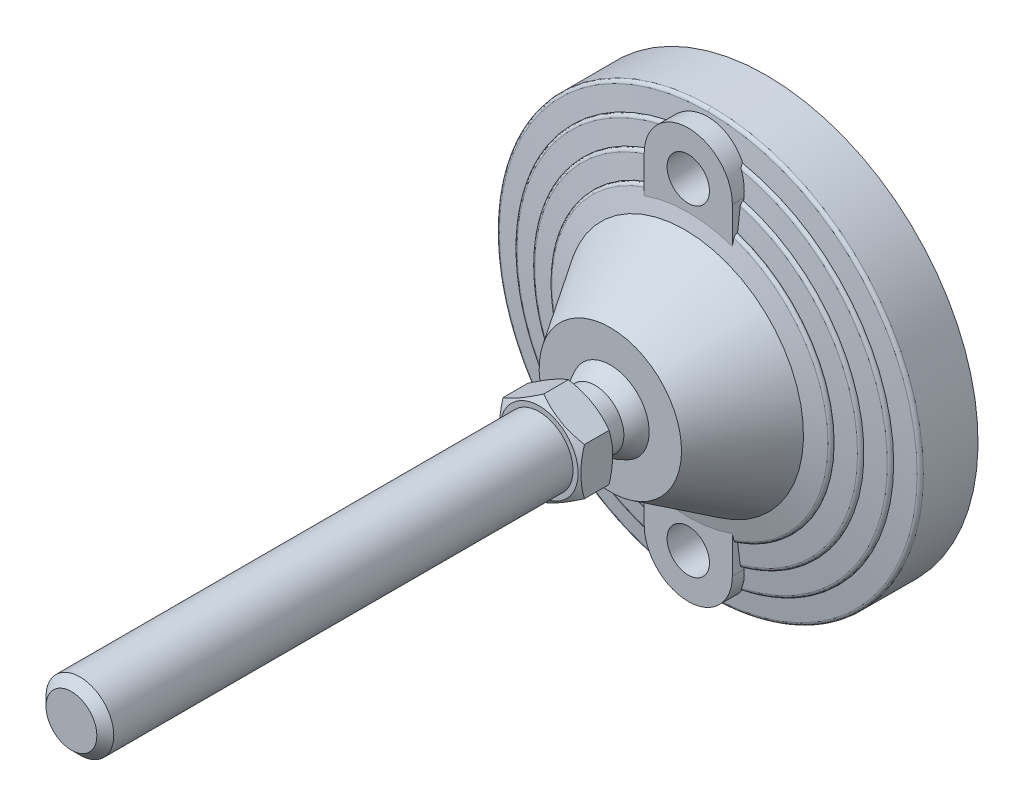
ISO-10303-21;
HEADER;
FILE_DESCRIPTION(('STEP AP214'),'2;1');
FILE_NAME('part.step','',(''),(''),'','','');
FILE_SCHEMA(('AUTOMOTIVE_DESIGN { 1 0 10303 214 1 1 1 1 }'));
ENDSEC;
DATA;
#1=APPLICATION_CONTEXT('core data for automotive mechanical design processes');
#2=APPLICATION_PROTOCOL_DEFINITION('international standard','automotive_design',2000,#1);
#3=PRODUCT_CONTEXT('',#1,'mechanical');
#4=PRODUCT('Part','Part','',(#3));
#5=PRODUCT_RELATED_PRODUCT_CATEGORY('part','',(#4));
#6=PRODUCT_DEFINITION_FORMATION('','',#4);
#7=PRODUCT_DEFINITION_CONTEXT('part definition',#1,'design');
#8=PRODUCT_DEFINITION('design','',#6,#7);
#9=PRODUCT_DEFINITION_SHAPE('','',#8);
#10=(LENGTH_UNIT() NAMED_UNIT(*) SI_UNIT(.MILLI.,.METRE.));
#11=(NAMED_UNIT(*) PLANE_ANGLE_UNIT() SI_UNIT($,.RADIAN.));
#12=(NAMED_UNIT(*) SI_UNIT($,.STERADIAN.) SOLID_ANGLE_UNIT());
#13=UNCERTAINTY_MEASURE_WITH_UNIT(LENGTH_MEASURE(1.E-05),#10,'distance_accuracy_value','');
#14=(GEOMETRIC_REPRESENTATION_CONTEXT(3) GLOBAL_UNCERTAINTY_ASSIGNED_CONTEXT((#13)) GLOBAL_UNIT_ASSIGNED_CONTEXT((#10,
#11,#12)) REPRESENTATION_CONTEXT('',''));
#15=CARTESIAN_POINT('',(0.,0.,0.));
#16=DIRECTION('',(0.,0.,1.));
#17=DIRECTION('',(1.,0.,0.));
#18=AXIS2_PLACEMENT_3D('',#15,#16,#17);
#19=CARTESIAN_POINT('',(-12.,14.022683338,57.));
#20=DIRECTION('',(0.,0.,1.));
#21=DIRECTION('',(0.,-1.,0.));
#22=AXIS2_PLACEMENT_3D('',#19,#20,#21);
#23=PLANE('',#22);
#24=CARTESIAN_POINT('',(0.,0.,57.));
#25=DIRECTION('',(0.,0.,-1.));
#26=DIRECTION('',(0.,1.,0.));
#27=AXIS2_PLACEMENT_3D('',#24,#25,#26);
#28=CIRCLE('',#27,11.5);
#29=CARTESIAN_POINT('',(0.,11.5,57.));
#30=VERTEX_POINT('',#29);
#31=EDGE_CURVE('E212',#30,#30,#28,.T.);
#32=ORIENTED_EDGE('',*,*,#31,.T.);
#33=EDGE_LOOP('',(#32));
#34=FACE_BOUND('',#33,.T.);
#35=CARTESIAN_POINT('',(0.,0.,57.));
#36=DIRECTION('',(0.,0.,-1.));
#37=DIRECTION('',(1.,0.,0.));
#38=AXIS2_PLACEMENT_3D('',#35,#36,#37);
#39=CIRCLE('',#38,8.5);
#40=CARTESIAN_POINT('',(8.5,0.,57.));
#41=VERTEX_POINT('',#40);
#42=EDGE_CURVE('E226',#41,#41,#39,.T.);
#43=ORIENTED_EDGE('',*,*,#42,.F.);
#44=EDGE_LOOP('',(#43));
#45=FACE_BOUND('',#44,.T.);
#46=ADVANCED_FACE('F14',(#34,#45),#23,.F.);
#47=CARTESIAN_POINT('',(0.,0.,57.));
#48=DIRECTION('',(0.,0.,-1.));
#49=DIRECTION('',(1.,0.,0.));
#50=AXIS2_PLACEMENT_3D('',#47,#48,#49);
#51=CYLINDRICAL_SURFACE('',#50,8.5);
#52=CARTESIAN_POINT('',(0.,0.,50.5));
#53=DIRECTION('',(0.,0.,-1.));
#54=DIRECTION('',(1.,0.,0.));
#55=AXIS2_PLACEMENT_3D('',#52,#53,#54);
#56=CIRCLE('',#55,8.5);
#57=CARTESIAN_POINT('',(8.5,0.,50.5));
#58=VERTEX_POINT('',#57);
#59=EDGE_CURVE('E1294',#58,#58,#56,.F.);
#60=ORIENTED_EDGE('',*,*,#59,.T.);
#61=EDGE_LOOP('',(#60));
#62=FACE_BOUND('',#61,.T.);
#63=ORIENTED_EDGE('',*,*,#42,.T.);
#64=EDGE_LOOP('',(#63));
#65=FACE_BOUND('',#64,.T.);
#66=ADVANCED_FACE('F1026',(#62,#65),#51,.T.);
#67=CARTESIAN_POINT('',(-8.631599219,8.622532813,50.5));
#68=DIRECTION('',(0.,0.,1.));
#69=DIRECTION('',(0.,-1.,0.));
#70=AXIS2_PLACEMENT_3D('',#67,#68,#69);
#71=PLANE('',#70);
#72=CARTESIAN_POINT('',(0.,0.,50.5));
#73=DIRECTION('',(0.,0.,-1.));
#74=DIRECTION('',(0.,1.,0.));
#75=AXIS2_PLACEMENT_3D('',#72,#73,#74);
#76=CIRCLE('',#75,8.49107182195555);
#77=CARTESIAN_POINT('',(0.,8.49107182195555,50.5));
#78=VERTEX_POINT('',#77);
#79=EDGE_CURVE('E1296',#78,#78,#76,.T.);
#80=ORIENTED_EDGE('',*,*,#79,.F.);
#81=EDGE_LOOP('',(#80));
#82=FACE_BOUND('',#81,.T.);
#83=ORIENTED_EDGE('',*,*,#59,.F.);
#84=EDGE_LOOP('',(#83));
#85=FACE_BOUND('',#84,.T.);
#86=ADVANCED_FACE('F1017',(#82,#85),#71,.F.);
#87=CARTESIAN_POINT('',(0.,0.,41.670266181));
#88=DIRECTION('',(0.,0.,-1.));
#89=DIRECTION('',(1.,0.,0.));
#90=AXIS2_PLACEMENT_3D('',#87,#88,#89);
#91=SPHERICAL_SURFACE('',#90,12.25);
#92=CARTESIAN_POINT('',(0.,0.,46.));
#93=DIRECTION('',(0.,0.,-1.));
#94=DIRECTION('',(0.,1.,0.));
#95=AXIS2_PLACEMENT_3D('',#92,#93,#94);
#96=CIRCLE('',#95,11.4593152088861);
#97=CARTESIAN_POINT('',(0.,11.4593152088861,46.));
#98=VERTEX_POINT('',#97);
#99=EDGE_CURVE('E1299',#98,#98,#96,.F.);
#100=ORIENTED_EDGE('',*,*,#99,.T.);
#101=EDGE_LOOP('',(#100));
#102=FACE_BOUND('',#101,.T.);
#103=ORIENTED_EDGE('',*,*,#79,.T.);
#104=EDGE_LOOP('',(#103));
#105=FACE_BOUND('',#104,.T.);
#106=ADVANCED_FACE('F1009',(#102,#105),#91,.T.);
#107=CARTESIAN_POINT('',(-21.325127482,-21.252,46.));
#108=DIRECTION('',(0.,0.,-1.));
#109=DIRECTION('',(0.,1.,0.));
#110=AXIS2_PLACEMENT_3D('',#107,#108,#109);
#111=PLANE('',#110);
#112=ORIENTED_EDGE('',*,*,#99,.F.);
#113=EDGE_LOOP('',(#112));
#114=FACE_BOUND('',#113,.T.);
#115=CARTESIAN_POINT('',(0.,0.,46.));
#116=DIRECTION('',(0.,0.,-1.));
#117=DIRECTION('',(0.,1.,0.));
#118=AXIS2_PLACEMENT_3D('',#115,#116,#117);
#119=CIRCLE('',#118,21.);
#120=CARTESIAN_POINT('',(0.,21.,46.));
#121=VERTEX_POINT('',#120);
#122=EDGE_CURVE('E721',#121,#121,#119,.T.);
#123=ORIENTED_EDGE('',*,*,#122,.F.);
#124=EDGE_LOOP('',(#123));
#125=FACE_BOUND('',#124,.T.);
#126=ADVANCED_FACE('F1000',(#114,#125),#111,.F.);
#127=CARTESIAN_POINT('',(0.,-47.5,0.));
#128=DIRECTION('',(0.,0.,1.));
#129=DIRECTION('',(0.,-1.,0.));
#130=AXIS2_PLACEMENT_3D('',#127,#128,#129);
#131=CYLINDRICAL_SURFACE('',#130,6.25);
#132=CARTESIAN_POINT('',(0.,-47.5,0.));
#133=DIRECTION('',(0.,0.,1.));
#134=DIRECTION('',(0.,-1.,0.));
#135=AXIS2_PLACEMENT_3D('',#132,#133,#134);
#136=CIRCLE('',#135,6.25);
#137=CARTESIAN_POINT('',(0.,-53.75,0.));
#138=VERTEX_POINT('',#137);
#139=EDGE_CURVE('E451',#138,#138,#136,.F.);
#140=ORIENTED_EDGE('',*,*,#139,.T.);
#141=EDGE_LOOP('',(#140));
#142=FACE_BOUND('',#141,.T.);
#143=CARTESIAN_POINT('',(0.,-47.5,23.));
#144=DIRECTION('',(0.,0.,1.));
#145=DIRECTION('',(0.,-1.,0.));
#146=AXIS2_PLACEMENT_3D('',#143,#144,#145);
#147=CIRCLE('',#146,6.25);
#148=CARTESIAN_POINT('',(0.,-53.75,23.));
#149=VERTEX_POINT('',#148);
#150=EDGE_CURVE('E720',#149,#149,#147,.T.);
#151=ORIENTED_EDGE('',*,*,#150,.T.);
#152=EDGE_LOOP('',(#151));
#153=FACE_BOUND('',#152,.T.);
#154=ADVANCED_FACE('F992',(#142,#153),#131,.F.);
#155=CARTESIAN_POINT('',(-63.467641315,63.25,0.));
#156=DIRECTION('',(0.,0.,1.));
#157=DIRECTION('',(0.,-1.,0.));
#158=AXIS2_PLACEMENT_3D('',#155,#156,#157);
#159=PLANE('',#158);
#160=ORIENTED_EDGE('',*,*,#139,.F.);
#161=EDGE_LOOP('',(#160));
#162=FACE_BOUND('',#161,.T.);
#163=CARTESIAN_POINT('',(0.,47.5,0.));
#164=DIRECTION('',(0.,0.,1.));
#165=DIRECTION('',(0.,-1.,0.));
#166=AXIS2_PLACEMENT_3D('',#163,#164,#165);
#167=CIRCLE('',#166,6.25);
#168=CARTESIAN_POINT('',(0.,41.25,0.));
#169=VERTEX_POINT('',#168);
#170=EDGE_CURVE('E239',#169,#169,#167,.T.);
#171=ORIENTED_EDGE('',*,*,#170,.T.);
#172=EDGE_LOOP('',(#171));
#173=FACE_BOUND('',#172,.T.);
#174=CARTESIAN_POINT('',(0.,0.,0.));
#175=DIRECTION('',(0.,0.,-1.));
#176=DIRECTION('',(0.,1.,0.));
#177=AXIS2_PLACEMENT_3D('',#174,#175,#176);
#178=CIRCLE('',#177,62.5);
#179=CARTESIAN_POINT('',(0.,62.5,0.));
#180=VERTEX_POINT('',#179);
#181=EDGE_CURVE('E414',#180,#180,#178,.F.);
#182=ORIENTED_EDGE('',*,*,#181,.F.);
#183=EDGE_LOOP('',(#182));
#184=FACE_BOUND('',#183,.T.);
#185=ADVANCED_FACE('F335',(#162,#173,#184),#159,.F.);
#186=CARTESIAN_POINT('',(12.406354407,39.602176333,21.568111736));
#187=CARTESIAN_POINT('',(59.707464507,24.78394183,21.568111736));
#188=CARTESIAN_POINT('',(59.707464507,-24.78394183,21.568111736));
#189=CARTESIAN_POINT('',(12.406354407,-39.602176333,21.568111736));
#190=CARTESIAN_POINT('',(12.406354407,39.602176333,22.044046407));
#191=CARTESIAN_POINT('',(59.707464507,24.78394183,22.044046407));
#192=CARTESIAN_POINT('',(59.707464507,-24.78394183,22.044046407));
#193=CARTESIAN_POINT('',(12.406354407,-39.602176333,22.044046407));
#194=CARTESIAN_POINT('',(12.31903347,39.323440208,22.419805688));
#195=CARTESIAN_POINT('',(59.287219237,24.609502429,22.419805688));
#196=CARTESIAN_POINT('',(59.287219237,-24.609502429,22.419805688));
#197=CARTESIAN_POINT('',(12.31903347,-39.323440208,22.419805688));
#198=CARTESIAN_POINT('',(12.18115046,38.883305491,22.53720891));
#199=CARTESIAN_POINT('',(58.623636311,24.334056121,22.53720891));
#200=CARTESIAN_POINT('',(58.623636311,-24.334056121,22.53720891));
#201=CARTESIAN_POINT('',(12.18115046,-38.883305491,22.53720891));
#202=(BOUNDED_SURFACE() B_SPLINE_SURFACE(3,3,((#186,#187,#188,#189),(#190,#191,#192,#193),(#194,
#195,#196,#197),(#198,#199,#200,#201)),.UNSPECIFIED.,.F.,.F.,
.F.) B_SPLINE_SURFACE_WITH_KNOTS((4,4),(4,4),(0.,1.),(0.,1.),
.UNSPECIFIED.) GEOMETRIC_REPRESENTATION_ITEM() RATIONAL_B_SPLINE_SURFACE(((1.,0.532632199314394,
0.532632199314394,1.),(0.85967907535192,0.457892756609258,0.457892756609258,0.85967907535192),
(0.85967907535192,0.457892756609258,0.457892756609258,0.85967907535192),(1.,0.532632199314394,
0.532632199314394,1.))) REPRESENTATION_ITEM('') SURFACE());
#203=CARTESIAN_POINT('',(0.,0.,22.53720891));
#204=DIRECTION('',(0.,0.,-1.));
#205=DIRECTION('',(0.,1.,0.));
#206=AXIS2_PLACEMENT_3D('',#203,#204,#205);
#207=CIRCLE('',#206,40.746679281);
#208=CARTESIAN_POINT('',(13.,-38.6172483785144,22.537208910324));
#209=VERTEX_POINT('',#208);
#210=CARTESIAN_POINT('',(13.,38.6172483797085,22.5372089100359));
#211=VERTEX_POINT('',#210);
#212=EDGE_CURVE('E452',#209,#211,#207,.F.);
#213=CARTESIAN_POINT('',(13.,-39.4112927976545,21.5681117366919));
#214=CARTESIAN_POINT('',(13.,-39.4112933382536,21.59521048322));
#215=CARTESIAN_POINT('',(13.,-39.4101321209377,21.6222958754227));
#216=CARTESIAN_POINT('',(13.,-39.405504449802,21.6762650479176));
#217=CARTESIAN_POINT('',(13.,-39.4020383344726,21.7031488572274));
#218=CARTESIAN_POINT('',(13.,-39.3882336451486,21.7831079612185));
#219=CARTESIAN_POINT('',(13.,-39.3744885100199,21.8356344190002));
#220=CARTESIAN_POINT('',(13.,-39.3384084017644,21.9376087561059));
#221=CARTESIAN_POINT('',(13.,-39.3160736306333,21.987056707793));
#222=CARTESIAN_POINT('',(13.,-39.263590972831,22.0816017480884));
#223=CARTESIAN_POINT('',(13.,-39.233444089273,22.1266993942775));
#224=CARTESIAN_POINT('',(13.,-39.1656058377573,22.2123360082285));
#225=CARTESIAN_POINT('',(13.,-39.1277714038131,22.2527614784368));
#226=CARTESIAN_POINT('',(13.,-39.0461074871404,22.327071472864));
#227=CARTESIAN_POINT('',(13.,-39.0022718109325,22.3609491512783));
#228=CARTESIAN_POINT('',(13.,-38.9043172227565,22.4250520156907));
#229=CARTESIAN_POINT('',(13.,-38.8495953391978,22.4543647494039));
#230=CARTESIAN_POINT('',(13.,-38.7644641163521,22.4909906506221));
#231=CARTESIAN_POINT('',(13.,-38.7355751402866,22.5019763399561));
#232=CARTESIAN_POINT('',(13.,-38.6769796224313,22.5214626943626));
#233=CARTESIAN_POINT('',(13.,-38.6472733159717,22.5299640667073));
#234=CARTESIAN_POINT('',(13.,-38.6172483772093,22.5372089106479));
#235=B_SPLINE_CURVE_WITH_KNOTS('',3,(#213,#214,#215,#216,#217,#218,#219,#220,#221,#222,#223,
#224,#225,#226,#227,#228,#229,#230,#231,#232,#233,#234),.UNSPECIFIED.,.F.,.F.,(4,2,2,2,2,2,2,2,
2,2,4),(0.,0.0812450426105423,0.16247815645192,0.324519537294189,0.486557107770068,
0.648573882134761,0.813939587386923,0.979477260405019,1.16468654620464,1.25731455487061,
1.34991616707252),.UNSPECIFIED.);
#236=CARTESIAN_POINT('',(13.,-39.4112927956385,21.568111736));
#237=VERTEX_POINT('',#236);
#238=EDGE_CURVE('E321',#237,#209,#235,.T.);
#239=CARTESIAN_POINT('',(0.,0.,21.568111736));
#240=DIRECTION('',(0.,0.,-1.));
#241=DIRECTION('',(0.,1.,0.));
#242=AXIS2_PLACEMENT_3D('',#239,#240,#241);
#243=CIRCLE('',#242,41.5);
#244=CARTESIAN_POINT('',(13.,39.4112927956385,21.5681117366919));
#245=VERTEX_POINT('',#244);
#246=EDGE_CURVE('E449',#245,#237,#243,.T.);
#247=CARTESIAN_POINT('',(13.,38.6172483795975,22.5372089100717));
#248=CARTESIAN_POINT('',(13.,38.6757273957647,22.5231434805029));
#249=CARTESIAN_POINT('',(13.,38.7330575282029,22.5042077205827));
#250=CARTESIAN_POINT('',(13.,38.843898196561,22.4570874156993));
#251=CARTESIAN_POINT('',(13.,38.8974017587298,22.4288864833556));
#252=CARTESIAN_POINT('',(13.,38.9989209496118,22.3637346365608));
#253=CARTESIAN_POINT('',(13.,39.0469285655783,22.3267711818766));
#254=CARTESIAN_POINT('',(13.,39.1357078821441,22.2450475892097));
#255=CARTESIAN_POINT('',(13.,39.1764870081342,22.2002955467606));
#256=CARTESIAN_POINT('',(13.,39.2479885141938,22.1059931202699));
#257=CARTESIAN_POINT('',(13.,39.2790300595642,22.0566848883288));
#258=CARTESIAN_POINT('',(13.,39.3318958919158,21.9533393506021));
#259=CARTESIAN_POINT('',(13.,39.3537228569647,21.8993034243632));
#260=CARTESIAN_POINT('',(13.,39.3839717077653,21.7991363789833));
#261=CARTESIAN_POINT('',(13.,39.3941848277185,21.7535382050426));
#262=CARTESIAN_POINT('',(13.,39.4078594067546,21.6613400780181));
#263=CARTESIAN_POINT('',(13.,39.411320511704,21.6147400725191));
#264=CARTESIAN_POINT('',(13.,39.4112927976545,21.5681117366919));
#265=B_SPLINE_CURVE_WITH_KNOTS('',3,(#247,#248,#249,#250,#251,#252,#253,#254,#255,#256,#257,
#258,#259,#260,#261,#262,#263,#264),.UNSPECIFIED.,.F.,.F.,(4,2,2,2,2,2,2,2,4),(0.,
0.180276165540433,0.360872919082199,0.541729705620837,0.722399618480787,0.896310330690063,
1.07017046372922,1.20986980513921,1.34957647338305),.UNSPECIFIED.);
#266=EDGE_CURVE('E238',#211,#245,#265,.T.);
#267=ORIENTED_EDGE('',*,*,#212,.F.);
#268=ORIENTED_EDGE('',*,*,#238,.F.);
#269=ORIENTED_EDGE('',*,*,#246,.F.);
#270=ORIENTED_EDGE('',*,*,#266,.F.);
#271=EDGE_LOOP('',(#267,#268,#269,#270));
#272=FACE_BOUND('',#271,.T.);
#273=ADVANCED_FACE('F919',(#272),#202,.T.);
#274=CARTESIAN_POINT('',(0.,0.,21.568111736));
#275=DIRECTION('',(0.,0.,-1.));
#276=DIRECTION('',(0.,1.,0.));
#277=AXIS2_PLACEMENT_3D('',#274,#275,#276);
#278=CYLINDRICAL_SURFACE('',#277,41.5);
#279=CARTESIAN_POINT('',(0.,0.,21.4545454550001));
#280=DIRECTION('',(0.,0.,-1.));
#281=DIRECTION('',(0.,1.,0.));
#282=AXIS2_PLACEMENT_3D('',#279,#280,#281);
#283=CIRCLE('',#282,41.5);
#284=CARTESIAN_POINT('',(13.,39.4112927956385,21.4545454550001));
#285=VERTEX_POINT('',#284);
#286=CARTESIAN_POINT('',(13.,-39.4112927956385,21.4545454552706));
#287=VERTEX_POINT('',#286);
#288=EDGE_CURVE('E447',#285,#287,#283,.T.);
#289=ORIENTED_EDGE('',*,*,#288,.F.);
#290=DIRECTION('',(0.,0.,-1.));
#291=VECTOR('',#290,1.);
#292=CARTESIAN_POINT('',(13.,39.4112927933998,21.2785712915));
#293=LINE('',#292,#291);
#294=EDGE_CURVE('E291',#245,#285,#293,.T.);
#295=ORIENTED_EDGE('',*,*,#294,.F.);
#296=ORIENTED_EDGE('',*,*,#246,.T.);
#297=DIRECTION('',(0.,0.,1.));
#298=VECTOR('',#297,1.);
#299=CARTESIAN_POINT('',(13.,-39.4112927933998,21.2785712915));
#300=LINE('',#299,#298);
#301=EDGE_CURVE('E319',#287,#237,#300,.T.);
#302=ORIENTED_EDGE('',*,*,#301,.F.);
#303=EDGE_LOOP('',(#289,#295,#296,#302));
#304=FACE_BOUND('',#303,.T.);
#305=ADVANCED_FACE('F303',(#304),#278,.T.);
#306=CARTESIAN_POINT('',(0.,0.,21.454545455));
#307=DIRECTION('',(0.,0.,-1.));
#308=DIRECTION('',(0.,1.,0.));
#309=AXIS2_PLACEMENT_3D('',#306,#307,#308);
#310=CONICAL_SURFACE('',#309,41.5,1.4442041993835);
#311=ORIENTED_EDGE('',*,*,#288,.T.);
#312=CARTESIAN_POINT('',(13.0000000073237,-45.8176832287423,20.674840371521));
#313=CARTESIAN_POINT('',(13.0000000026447,-45.2838642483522,20.7402005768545));
#314=CARTESIAN_POINT('',(13.000000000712,-44.7500350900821,20.8054777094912));
#315=CARTESIAN_POINT('',(12.999999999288,-43.6823542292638,20.9358466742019));
#316=CARTESIAN_POINT('',(12.9999999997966,-43.1485025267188,21.0009385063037));
#317=CARTESIAN_POINT('',(13.0000000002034,-42.0807742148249,21.1309177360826));
#318=CARTESIAN_POINT('',(13.0000000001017,-41.5468976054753,21.195805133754));
#319=CARTESIAN_POINT('',(12.9999999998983,-40.4791166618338,21.3253520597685));
#320=CARTESIAN_POINT('',(12.9999999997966,-39.9452123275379,21.3900115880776));
#321=CARTESIAN_POINT('',(13.,-39.4112927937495,21.4545454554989));
#322=B_SPLINE_CURVE_WITH_KNOTS('',3,(#312,#313,#314,#315,#316,#317,#318,#319,#320,#321),
.UNSPECIFIED.,.F.,.F.,(4,2,2,2,4),(0.,1.61341623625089,3.22683223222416,4.84024827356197,
6.45366455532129),.UNSPECIFIED.);
#323=CARTESIAN_POINT('',(13.,-45.8176832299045,20.6748403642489));
#324=VERTEX_POINT('',#323);
#325=EDGE_CURVE('E311',#324,#287,#322,.T.);
#326=ORIENTED_EDGE('',*,*,#325,.F.);
#327=CARTESIAN_POINT('',(-7.48558333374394E-10,0.,20.674840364));
#328=DIRECTION('',(0.,0.,-1.));
#329=DIRECTION('',(0.,1.,0.));
#330=AXIS2_PLACEMENT_3D('',#327,#328,#329);
#331=CIRCLE('',#330,47.6262542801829);
#332=CARTESIAN_POINT('',(13.,45.8176832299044,20.6748403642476));
#333=VERTEX_POINT('',#332);
#334=EDGE_CURVE('E412',#333,#324,#331,.T.);
#335=ORIENTED_EDGE('',*,*,#334,.F.);
#336=CARTESIAN_POINT('',(13.,39.4112927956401,21.4545454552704));
#337=CARTESIAN_POINT('',(13.,39.9452123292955,21.3900115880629));
#338=CARTESIAN_POINT('',(13.,40.4791166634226,21.3253520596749));
#339=CARTESIAN_POINT('',(13.,41.5468976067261,21.195805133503));
#340=CARTESIAN_POINT('',(13.,42.0807742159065,21.1309177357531));
#341=CARTESIAN_POINT('',(13.,43.1485025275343,21.0009385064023));
#342=CARTESIAN_POINT('',(13.,43.6823542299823,20.9358466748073));
#343=CARTESIAN_POINT('',(13.,44.7500350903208,20.805477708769));
#344=CARTESIAN_POINT('',(13.,45.283864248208,20.7402005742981));
#345=CARTESIAN_POINT('',(13.,45.8176832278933,20.6748403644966));
#346=B_SPLINE_CURVE_WITH_KNOTS('',3,(#336,#337,#338,#339,#340,#341,#342,#343,#344,#345),
.UNSPECIFIED.,.F.,.F.,(4,2,2,2,4),(0.,1.61341628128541,3.22683232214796,4.84024831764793,
6.45366455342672),.UNSPECIFIED.);
#347=EDGE_CURVE('E283',#285,#333,#346,.T.);
#348=ORIENTED_EDGE('',*,*,#347,.F.);
#349=EDGE_LOOP('',(#311,#326,#335,#348));
#350=FACE_BOUND('',#349,.T.);
#351=ADVANCED_FACE('F298',(#350),#310,.T.);
#352=CARTESIAN_POINT('',(12.269850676,46.922284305,19.669623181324));
#353=CARTESIAN_POINT('',(72.557631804,31.157449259,19.6696231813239));
#354=CARTESIAN_POINT('',(72.557631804,-31.157449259,19.6696231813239));
#355=CARTESIAN_POINT('',(12.269850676,-46.922284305,19.669623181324));
#356=CARTESIAN_POINT('',(12.269850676,46.922284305,19.6740296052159));
#357=CARTESIAN_POINT('',(72.557631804,31.157449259,19.674029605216));
#358=CARTESIAN_POINT('',(72.557631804,-31.157449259,19.674029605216));
#359=CARTESIAN_POINT('',(12.269850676,-46.922284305,19.6740296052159));
#360=CARTESIAN_POINT('',(12.269850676,46.922284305,19.678436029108));
#361=CARTESIAN_POINT('',(72.557631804,31.157449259,19.678436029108));
#362=CARTESIAN_POINT('',(72.557631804,-31.157449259,19.678436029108));
#363=CARTESIAN_POINT('',(12.269850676,-46.922284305,19.678436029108));
#364=CARTESIAN_POINT('',(12.269850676,46.922284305,19.682842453));
#365=CARTESIAN_POINT('',(72.557631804,31.157449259,19.682842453));
#366=CARTESIAN_POINT('',(72.557631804,-31.157449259,19.682842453));
#367=CARTESIAN_POINT('',(12.269850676,-46.922284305,19.682842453));
#368=CARTESIAN_POINT('',(12.269850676,46.922284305,20.211436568));
#369=CARTESIAN_POINT('',(72.5576318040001,31.157449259,20.211436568));
#370=CARTESIAN_POINT('',(72.5576318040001,-31.157449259,20.211436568));
#371=CARTESIAN_POINT('',(12.269850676,-46.922284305,20.211436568));
#372=CARTESIAN_POINT('',(12.181461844,46.584268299,20.608103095));
#373=CARTESIAN_POINT('',(72.0349453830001,30.93299905,20.608103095));
#374=CARTESIAN_POINT('',(72.0349453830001,-30.93299905,20.608103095));
#375=CARTESIAN_POINT('',(12.181461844,-46.584268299,20.608103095));
#376=CARTESIAN_POINT('',(12.048804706,46.076961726,20.674840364));
#377=CARTESIAN_POINT('',(71.250478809,30.596136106,20.674840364));
#378=CARTESIAN_POINT('',(71.250478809,-30.596136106,20.674840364));
#379=CARTESIAN_POINT('',(12.048804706,-46.076961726,20.674840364));
#380=(BOUNDED_SURFACE() B_SPLINE_SURFACE(3,3,((#352,#353,#354,#355),(#356,#357,#358,#359),(#360,
#361,#362,#363),(#364,#365,#366,#367),(#368,#369,#370,#371),(#372,#373,#374,#375),(#376,#377,
#378,#379)),.UNSPECIFIED.,.F.,.F.,.F.) B_SPLINE_SURFACE_WITH_KNOTS((4,3,4),(4,4),(-0.01,0.,1.),
(0.,1.),.UNSPECIFIED.) GEOMETRIC_REPRESENTATION_ITEM() RATIONAL_B_SPLINE_SURFACE(((1.,
0.501991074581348,0.501991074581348,1.),(1.,0.501991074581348,0.501991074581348,1.),(1.,
0.501991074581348,0.501991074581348,1.),(1.,0.501991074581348,0.501991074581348,1.),
(0.833611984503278,0.41846577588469,0.41846577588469,0.833611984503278),(0.833611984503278,
0.41846577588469,0.41846577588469,0.833611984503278),(1.,0.501991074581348,0.501991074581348,1.))) REPRESENTATION_ITEM('') SURFACE());
#381=CARTESIAN_POINT('',(13.,-46.7252608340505,19.6777848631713));
#382=CARTESIAN_POINT('',(13.,-46.7253979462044,19.7054287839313));
#383=CARTESIAN_POINT('',(13.,-46.7243484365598,19.7330653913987));
#384=CARTESIAN_POINT('',(13.,-46.7198870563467,19.7881439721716));
#385=CARTESIAN_POINT('',(13.,-46.7164754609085,19.8155859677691));
#386=CARTESIAN_POINT('',(13.,-46.7027375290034,19.8972169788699));
#387=CARTESIAN_POINT('',(13.,-46.688908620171,19.9508576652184));
#388=CARTESIAN_POINT('',(13.,-46.6523707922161,20.0550506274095));
#389=CARTESIAN_POINT('',(13.,-46.629652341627,20.1055995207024));
#390=CARTESIAN_POINT('',(13.,-46.5760978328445,20.2021956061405));
#391=CARTESIAN_POINT('',(13.,-46.545261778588,20.248242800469));
#392=CARTESIAN_POINT('',(13.,-46.4762858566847,20.3348542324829));
#393=CARTESIAN_POINT('',(13.,-46.438110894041,20.3753904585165));
#394=CARTESIAN_POINT('',(13.,-46.3556866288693,20.4497572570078));
#395=CARTESIAN_POINT('',(13.,-46.3114344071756,20.4835845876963));
#396=CARTESIAN_POINT('',(13.,-46.2164675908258,20.5448274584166));
#397=CARTESIAN_POINT('',(13.,-46.1655796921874,20.5719736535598));
#398=CARTESIAN_POINT('',(13.,-46.0601083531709,20.6176355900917));
#399=CARTESIAN_POINT('',(13.,-46.0055288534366,20.6361603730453));
#400=CARTESIAN_POINT('',(13.,-45.9281089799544,20.6556819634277));
#401=CARTESIAN_POINT('',(13.,-45.9061721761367,20.660484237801));
#402=CARTESIAN_POINT('',(13.,-45.8620822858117,20.6686997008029));
#403=CARTESIAN_POINT('',(13.,-45.8399296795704,20.6721154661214));
#404=CARTESIAN_POINT('',(13.0000000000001,-45.817683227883,20.6748403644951));
#405=B_SPLINE_CURVE_WITH_KNOTS('',3,(#381,#382,#383,#384,#385,#386,#387,#388,#389,#390,#391,
#392,#393,#394,#395,#396,#397,#398,#399,#400,#401,#402,#403,#404),.UNSPECIFIED.,.F.,.F.,(4,2,2,
2,2,2,2,2,2,2,2,4),(0.,0.0828810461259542,0.165752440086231,0.331061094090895,0.496547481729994,
0.662033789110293,0.828332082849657,0.994710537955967,1.16697834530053,1.3390650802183,
1.40639957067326,1.47360834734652),.UNSPECIFIED.);
#406=CARTESIAN_POINT('',(13.0000000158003,-46.7252608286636,19.6777848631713));
#407=VERTEX_POINT('',#406);
#408=EDGE_CURVE('E320',#407,#324,#405,.T.);
#409=CARTESIAN_POINT('',(13.0000000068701,46.7252608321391,19.6727272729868));
#410=CARTESIAN_POINT('',(13.3212147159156,46.635891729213,19.6727272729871));
#411=CARTESIAN_POINT('',(13.6414983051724,46.5432129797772,19.6727272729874));
#412=CARTESIAN_POINT('',(14.2801231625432,46.3512597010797,19.672727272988));
#413=CARTESIAN_POINT('',(14.59846420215,46.2519844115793,19.6727272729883));
#414=CARTESIAN_POINT('',(15.5526106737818,45.9435979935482,19.6727272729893));
#415=CARTESIAN_POINT('',(16.1852411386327,45.724565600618,19.6727272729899));
#416=CARTESIAN_POINT('',(17.4409289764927,45.2604918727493,19.6727272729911));
#417=CARTESIAN_POINT('',(18.0639854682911,45.0154481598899,19.6727272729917));
#418=CARTESIAN_POINT('',(19.3000708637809,44.4995075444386,19.672727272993));
#419=CARTESIAN_POINT('',(19.913088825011,44.2285843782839,19.6727272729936));
#420=CARTESIAN_POINT('',(21.1274202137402,43.6615551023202,19.6727272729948));
#421=CARTESIAN_POINT('',(21.7287319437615,43.3654453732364,19.6727272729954));
#422=CARTESIAN_POINT('',(23.5288179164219,42.4321391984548,19.6727272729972));
#423=CARTESIAN_POINT('',(24.7079785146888,41.7565378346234,19.6727272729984));
#424=CARTESIAN_POINT('',(27.0057517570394,40.3086198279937,19.6727272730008));
#425=CARTESIAN_POINT('',(28.1243409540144,39.5362661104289,19.672727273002));
#426=CARTESIAN_POINT('',(30.2940548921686,37.8994558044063,19.6727272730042));
#427=CARTESIAN_POINT('',(31.3451007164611,37.034894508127,19.6727272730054));
#428=CARTESIAN_POINT('',(33.3707378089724,35.2206260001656,19.6727272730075));
#429=CARTESIAN_POINT('',(34.3453363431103,34.2709268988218,19.6727272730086));
#430=CARTESIAN_POINT('',(36.2141318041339,32.2900336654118,19.6727272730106));
#431=CARTESIAN_POINT('',(37.1080775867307,31.2586025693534,19.6727272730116));
#432=CARTESIAN_POINT('',(38.8059105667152,29.1240638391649,19.6727272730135));
#433=CARTESIAN_POINT('',(39.609795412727,28.0209543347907,19.6727272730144));
#434=CARTESIAN_POINT('',(41.1215543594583,25.7512426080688,19.6727272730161));
#435=CARTESIAN_POINT('',(41.8294551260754,24.5846581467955,19.6727272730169));
#436=CARTESIAN_POINT('',(43.144473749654,22.1960153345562,19.6727272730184));
#437=CARTESIAN_POINT('',(43.7515922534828,20.9739573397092,19.6727272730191));
#438=CARTESIAN_POINT('',(44.8608053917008,18.4828923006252,19.6727272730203));
#439=CARTESIAN_POINT('',(45.3628870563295,17.2138794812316,19.6727272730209));
#440=CARTESIAN_POINT('',(46.2583633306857,14.6380667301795,19.6727272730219));
#441=CARTESIAN_POINT('',(46.6517577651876,13.3312667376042,19.6727272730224));
#442=CARTESIAN_POINT('',(47.3270705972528,10.6891374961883,19.6727272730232));
#443=CARTESIAN_POINT('',(47.6089860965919,9.35380750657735,19.6727272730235));
#444=CARTESIAN_POINT('',(48.0593220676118,6.66414532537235,19.672727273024));
#445=CARTESIAN_POINT('',(48.2277425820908,5.30981314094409,19.6727272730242));
#446=CARTESIAN_POINT('',(48.4498861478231,2.59183878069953,19.6727272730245));
#447=CARTESIAN_POINT('',(48.5036145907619,1.22819704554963,19.6727272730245));
#448=CARTESIAN_POINT('',(48.4960080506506,-1.49876561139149,19.6727272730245));
#449=CARTESIAN_POINT('',(48.4346730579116,-2.86208653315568,19.6727272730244));
#450=CARTESIAN_POINT('',(48.1973677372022,-5.57880747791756,19.6727272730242));
#451=CARTESIAN_POINT('',(48.0213896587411,-6.93220682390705,19.672727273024));
#452=CARTESIAN_POINT('',(47.5560413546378,-9.61936956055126,19.6727272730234));
#453=CARTESIAN_POINT('',(47.2666711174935,-10.9531329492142,19.6727272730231));
#454=CARTESIAN_POINT('',(46.5765756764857,-13.5916227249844,19.6727272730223));
#455=CARTESIAN_POINT('',(46.175843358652,-14.8963472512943,19.6727272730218));
#456=CARTESIAN_POINT('',(45.2658742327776,-17.4674022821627,19.6727272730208));
#457=CARTESIAN_POINT('',(44.7566374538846,-18.7337327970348,19.6727272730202));
#458=CARTESIAN_POINT('',(43.6334165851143,-21.2187182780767,19.6727272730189));
#459=CARTESIAN_POINT('',(43.0194530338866,-22.4373825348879,19.6727272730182));
#460=CARTESIAN_POINT('',(41.6909757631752,-24.8187625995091,19.6727272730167));
#461=CARTESIAN_POINT('',(40.976461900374,-25.9814783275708,19.6727272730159));
#462=CARTESIAN_POINT('',(39.7063025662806,-27.8655028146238,19.6727272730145));
#463=CARTESIAN_POINT('',(39.1770724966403,-28.6047764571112,19.6727272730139));
#464=CARTESIAN_POINT('',(38.0778809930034,-30.0524665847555,19.6727272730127));
#465=CARTESIAN_POINT('',(37.5079195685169,-30.760883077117,19.6727272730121));
#466=CARTESIAN_POINT('',(36.3291070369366,-32.1445499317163,19.6727272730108));
#467=CARTESIAN_POINT('',(35.7202564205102,-32.8198007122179,19.6727272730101));
#468=CARTESIAN_POINT('',(34.4653645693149,-34.1352484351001,19.6727272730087));
#469=CARTESIAN_POINT('',(33.819310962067,-34.775433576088,19.672727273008));
#470=CARTESIAN_POINT('',(32.4922294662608,-36.018489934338,19.6727272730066));
#471=CARTESIAN_POINT('',(31.8112009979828,-36.6213605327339,19.6727272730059));
#472=CARTESIAN_POINT('',(30.4163089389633,-37.787892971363,19.6727272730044));
#473=CARTESIAN_POINT('',(29.7024437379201,-38.3515528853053,19.6727272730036));
#474=CARTESIAN_POINT('',(28.1769516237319,-39.4879139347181,19.672727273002));
#475=CARTESIAN_POINT('',(27.3623770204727,-40.0566641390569,19.6727272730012));
#476=CARTESIAN_POINT('',(25.69978552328,-41.1431320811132,19.6727272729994));
#477=CARTESIAN_POINT('',(24.8517655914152,-41.6608451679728,19.6727272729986));
#478=CARTESIAN_POINT('',(23.1254909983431,-42.6432641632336,19.6727272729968));
#479=CARTESIAN_POINT('',(22.2472346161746,-43.1079670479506,19.6727272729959));
#480=CARTESIAN_POINT('',(20.4623876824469,-43.9832963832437,19.6727272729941));
#481=CARTESIAN_POINT('',(19.5557530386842,-44.3938329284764,19.6727272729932));
#482=CARTESIAN_POINT('',(17.7189637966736,-45.1583612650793,19.6727272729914));
#483=CARTESIAN_POINT('',(16.7888095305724,-45.5123538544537,19.6727272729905));
#484=CARTESIAN_POINT('',(14.9085132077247,-46.1625049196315,19.6727272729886));
#485=CARTESIAN_POINT('',(13.9583713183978,-46.4586638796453,19.6727272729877));
#486=CARTESIAN_POINT('',(13.0000000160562,-46.7252608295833,19.6727272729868));
#487=B_SPLINE_CURVE_WITH_KNOTS('',3,(#409,#410,#411,#412,#413,#414,#415,#416,#417,#418,#419,
#420,#421,#422,#423,#424,#425,#426,#427,#428,#429,#430,#431,#432,#433,#434,#435,#436,#437,#438,
#439,#440,#441,#442,#443,#444,#445,#446,#447,#448,#449,#450,#451,#452,#453,#454,#455,#456,#457,
#458,#459,#460,#461,#462,#463,#464,#465,#466,#467,#468,#469,#470,#471,#472,#473,#474,#475,#476,
#477,#478,#479,#480,#481,#482,#483,#484,#485,#486),.UNSPECIFIED.,.F.,.F.,(4,2,2,2,2,2,2,2,2,2,2,
2,2,2,2,2,2,2,2,2,2,2,2,2,2,2,2,2,2,2,2,2,2,2,2,2,2,2,4),(0.,1.00020816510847,2.00053180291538,
4.00833027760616,6.01631246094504,8.02635452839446,10.0366859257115,14.1084282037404,
18.1817355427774,22.2597186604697,26.3373137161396,30.4271967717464,34.5171865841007,
38.606037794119,42.6948627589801,46.7841923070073,50.8735284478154,54.9629708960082,
59.0524118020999,63.1416604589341,67.2309094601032,71.3204349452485,75.4099608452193,
79.499748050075,83.5895341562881,87.6785191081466,91.7675098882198,94.4937471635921,
97.2199838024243,99.9461860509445,102.673300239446,105.400459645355,108.12775293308,
111.106299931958,114.085118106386,117.064106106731,120.047978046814,123.031807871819,
126.015612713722),.UNSPECIFIED.);
#488=CARTESIAN_POINT('',(13.0000000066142,46.7252608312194,19.6777848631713));
#489=VERTEX_POINT('',#488);
#490=EDGE_CURVE('E396',#489,#407,#487,.T.);
#491=CARTESIAN_POINT('',(13.,45.817683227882,20.6748403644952));
#492=CARTESIAN_POINT('',(13.,45.8768916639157,20.6676266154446));
#493=CARTESIAN_POINT('',(13.,45.9354849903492,20.655431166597));
#494=CARTESIAN_POINT('',(13.,46.0498761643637,20.621476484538));
#495=CARTESIAN_POINT('',(13.,46.1056719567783,20.5997103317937));
#496=CARTESIAN_POINT('',(13.,46.2128716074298,20.5469963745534));
#497=CARTESIAN_POINT('',(13.,46.2642705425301,20.5160384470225));
#498=CARTESIAN_POINT('',(13.,46.336724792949,20.4633763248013));
#499=CARTESIAN_POINT('',(13.,46.3600988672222,20.4447881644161));
#500=CARTESIAN_POINT('',(13.,46.405165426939,20.405625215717));
#501=CARTESIAN_POINT('',(13.,46.4268560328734,20.3850482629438));
#502=CARTESIAN_POINT('',(13.,46.4880645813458,20.3216088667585));
#503=CARTESIAN_POINT('',(13.,46.5249454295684,20.2761439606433));
#504=CARTESIAN_POINT('',(13.,46.5901806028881,20.1794685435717));
#505=CARTESIAN_POINT('',(13.,46.6185381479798,20.1282602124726));
#506=CARTESIAN_POINT('',(13.,46.653488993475,20.0492930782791));
#507=CARTESIAN_POINT('',(13.,46.6637514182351,20.0231112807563));
#508=CARTESIAN_POINT('',(13.,46.6819716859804,19.9699855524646));
#509=CARTESIAN_POINT('',(13.,46.6899313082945,19.9430422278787));
#510=CARTESIAN_POINT('',(13.,46.7102220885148,19.8614024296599));
#511=CARTESIAN_POINT('',(13.,46.7190275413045,19.805755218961));
#512=CARTESIAN_POINT('',(13.,46.7237631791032,19.7378782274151));
#513=CARTESIAN_POINT('',(13.,46.7243742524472,19.7258595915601));
#514=CARTESIAN_POINT('',(13.,46.7251497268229,19.7018236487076));
#515=CARTESIAN_POINT('',(13.,46.7253147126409,19.6898063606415));
#516=CARTESIAN_POINT('',(13.,46.7252608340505,19.6777848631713));
#517=B_SPLINE_CURVE_WITH_KNOTS('',3,(#491,#492,#493,#494,#495,#496,#497,#498,#499,#500,#501,
#502,#503,#504,#505,#506,#507,#508,#509,#510,#511,#512,#513,#514,#515,#516),.UNSPECIFIED.,.F.,
.F.,(4,2,2,2,2,2,2,2,2,2,2,2,4),(0.,0.178718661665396,0.357566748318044,0.536612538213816,
0.626107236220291,0.715700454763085,0.890396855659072,1.0650271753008,1.14929679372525,
1.23350112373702,1.40145319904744,1.43755286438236,1.47360518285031),.UNSPECIFIED.);
#518=EDGE_CURVE('E290',#333,#489,#517,.T.);
#519=ORIENTED_EDGE('',*,*,#334,.T.);
#520=ORIENTED_EDGE('',*,*,#408,.F.);
#521=ORIENTED_EDGE('',*,*,#490,.F.);
#522=ORIENTED_EDGE('',*,*,#518,.F.);
#523=EDGE_LOOP('',(#519,#520,#521,#522));
#524=FACE_BOUND('',#523,.T.);
#525=ADVANCED_FACE('F302',(#524),#380,.T.);
#526=CARTESIAN_POINT('',(0.,62.5,16.119206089));
#527=CARTESIAN_POINT('',(125.,62.5,16.119206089));
#528=CARTESIAN_POINT('',(125.,-62.5,16.119206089));
#529=CARTESIAN_POINT('',(0.,-62.5,16.119206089));
#530=CARTESIAN_POINT('',(0.,62.5,16.647800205));
#531=CARTESIAN_POINT('',(125.,62.5,16.647800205));
#532=CARTESIAN_POINT('',(125.,-62.5,16.647800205));
#533=CARTESIAN_POINT('',(0.,-62.5,16.647800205));
#534=CARTESIAN_POINT('',(0.,62.150618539,17.044466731));
#535=CARTESIAN_POINT('',(124.301237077,62.1506185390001,17.044466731));
#536=CARTESIAN_POINT('',(124.301237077,-62.1506185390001,17.044466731));
#537=CARTESIAN_POINT('',(0.,-62.150618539,17.044466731));
#538=CARTESIAN_POINT('',(0.,61.62625428,17.111204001));
#539=CARTESIAN_POINT('',(123.252508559,61.6262542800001,17.111204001));
#540=CARTESIAN_POINT('',(123.252508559,-61.6262542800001,17.111204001));
#541=CARTESIAN_POINT('',(0.,-61.62625428,17.111204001));
#542=(BOUNDED_SURFACE() B_SPLINE_SURFACE(3,3,((#526,#527,#528,#529),(#530,#531,#532,#533),(#534,
#535,#536,#537),(#538,#539,#540,#541)),.UNSPECIFIED.,.F.,.F.,
.F.) B_SPLINE_SURFACE_WITH_KNOTS((4,4),(4,4),(0.,1.),(0.,1.),
.UNSPECIFIED.) GEOMETRIC_REPRESENTATION_ITEM() RATIONAL_B_SPLINE_SURFACE(((1.,0.333333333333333,
0.333333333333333,1.),(0.83361198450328,0.277870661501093,0.277870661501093,0.83361198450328),
(0.83361198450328,0.277870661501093,0.277870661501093,0.83361198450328),(1.,0.333333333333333,
0.333333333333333,1.))) REPRESENTATION_ITEM('') SURFACE());
#543=CARTESIAN_POINT('',(0.,0.,16.119206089));
#544=DIRECTION('',(0.,0.,1.));
#545=DIRECTION('',(0.,-1.,0.));
#546=AXIS2_PLACEMENT_3D('',#543,#544,#545);
#547=CIRCLE('',#546,62.5);
#548=CARTESIAN_POINT('',(-9.61422321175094E-09,-62.5,16.119206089));
#549=VERTEX_POINT('',#548);
#550=CARTESIAN_POINT('',(-2.80605088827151E-09,62.5,16.119206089));
#551=VERTEX_POINT('',#550);
#552=EDGE_CURVE('E712',#549,#551,#547,.T.);
#553=CARTESIAN_POINT('',(0.,62.5,16.119206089));
#554=CARTESIAN_POINT('',(0.,62.5,16.647800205));
#555=CARTESIAN_POINT('',(0.,62.150618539,17.044466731));
#556=CARTESIAN_POINT('',(0.,61.62625428,17.111204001));
#557=(BOUNDED_CURVE() B_SPLINE_CURVE(3,(#553,#554,#555,#556),.UNSPECIFIED.,.F.,
.F.) B_SPLINE_CURVE_WITH_KNOTS((4,4),(0.,1.),
.UNSPECIFIED.) CURVE() GEOMETRIC_REPRESENTATION_ITEM() RATIONAL_B_SPLINE_CURVE((1.,
0.83361198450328,0.83361198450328,1.)) REPRESENTATION_ITEM(''));
#558=CARTESIAN_POINT('',(-8.30046746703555E-09,61.6262542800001,17.111204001));
#559=VERTEX_POINT('',#558);
#560=EDGE_CURVE('E433',#559,#551,#557,.F.);
#561=CARTESIAN_POINT('',(0.,0.,17.111204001));
#562=DIRECTION('',(0.,0.,-1.));
#563=DIRECTION('',(0.,1.,0.));
#564=AXIS2_PLACEMENT_3D('',#561,#562,#563);
#565=CIRCLE('',#564,61.62625428);
#566=CARTESIAN_POINT('',(-1.57996950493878E-08,-61.62625428,17.111204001));
#567=VERTEX_POINT('',#566);
#568=EDGE_CURVE('E724',#567,#559,#565,.F.);
#569=CARTESIAN_POINT('',(0.,-62.5,16.119206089));
#570=CARTESIAN_POINT('',(0.,-62.5,16.647800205));
#571=CARTESIAN_POINT('',(0.,-62.150618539,17.044466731));
#572=CARTESIAN_POINT('',(0.,-61.62625428,17.111204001));
#573=(BOUNDED_CURVE() B_SPLINE_CURVE(3,(#569,#570,#571,#572),.UNSPECIFIED.,.F.,
.F.) B_SPLINE_CURVE_WITH_KNOTS((4,4),(0.,1.),
.UNSPECIFIED.) CURVE() GEOMETRIC_REPRESENTATION_ITEM() RATIONAL_B_SPLINE_CURVE((1.,
0.83361198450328,0.83361198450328,1.)) REPRESENTATION_ITEM(''));
#574=EDGE_CURVE('E439',#549,#567,#573,.T.);
#575=ORIENTED_EDGE('',*,*,#552,.T.);
#576=ORIENTED_EDGE('',*,*,#560,.F.);
#577=ORIENTED_EDGE('',*,*,#568,.F.);
#578=ORIENTED_EDGE('',*,*,#574,.F.);
#579=EDGE_LOOP('',(#575,#576,#577,#578));
#580=FACE_BOUND('',#579,.T.);
#581=ADVANCED_FACE('F946',(#580),#542,.T.);
#582=CARTESIAN_POINT('',(0.,0.,16.119206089));
#583=DIRECTION('',(0.,0.,-1.));
#584=DIRECTION('',(0.,1.,0.));
#585=AXIS2_PLACEMENT_3D('',#582,#583,#584);
#586=CYLINDRICAL_SURFACE('',#585,62.5);
#587=ORIENTED_EDGE('',*,*,#552,.F.);
#588=CARTESIAN_POINT('',(0.,0.,16.119206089));
#589=DIRECTION('',(0.,0.,1.));
#590=DIRECTION('',(0.,-1.,0.));
#591=AXIS2_PLACEMENT_3D('',#588,#589,#590);
#592=CIRCLE('',#591,62.5);
#593=EDGE_CURVE('E431',#551,#549,#592,.T.);
#594=ORIENTED_EDGE('',*,*,#593,.F.);
#595=EDGE_LOOP('',(#587,#594));
#596=FACE_BOUND('',#595,.T.);
#597=ORIENTED_EDGE('',*,*,#181,.T.);
#598=EDGE_LOOP('',(#597));
#599=FACE_BOUND('',#598,.T.);
#600=ADVANCED_FACE('F333',(#596,#599),#586,.T.);
#601=CARTESIAN_POINT('',(13.,-47.5,19.557142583));
#602=DIRECTION('',(1.,0.,0.));
#603=DIRECTION('',(0.,1.,0.));
#604=AXIS2_PLACEMENT_3D('',#601,#602,#603);
#605=PLANE('',#604);
#606=ORIENTED_EDGE('',*,*,#301,.T.);
#607=ORIENTED_EDGE('',*,*,#238,.T.);
#608=CARTESIAN_POINT('',(12.999999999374,-36.6937824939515,22.9999999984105));
#609=CARTESIAN_POINT('',(12.999999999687,-37.0144078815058,22.9230665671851));
#610=CARTESIAN_POINT('',(12.9999999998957,-37.3350093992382,22.8460339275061));
#611=CARTESIAN_POINT('',(13.0000000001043,-37.9761646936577,22.6917702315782));
#612=CARTESIAN_POINT('',(13.0000000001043,-38.2967184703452,22.6145391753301));
#613=CARTESIAN_POINT('',(13.,-38.6172483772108,22.5372089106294));
#614=B_SPLINE_CURVE_WITH_KNOTS('',3,(#608,#609,#610,#611,#612,#613),.UNSPECIFIED.,.F.,.F.,(4,2,
4),(0.,0.989178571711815,1.97835713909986),.UNSPECIFIED.);
#615=CARTESIAN_POINT('',(13.,-36.6937824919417,22.9999999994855));
#616=VERTEX_POINT('',#615);
#617=EDGE_CURVE('E340',#616,#209,#614,.T.);
#618=ORIENTED_EDGE('',*,*,#617,.F.);
#619=DIRECTION('',(0.,-1.,0.));
#620=VECTOR('',#619,1.);
#621=CARTESIAN_POINT('',(13.,-48.6192575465,23.));
#622=LINE('',#621,#620);
#623=CARTESIAN_POINT('',(13.,-47.5000000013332,23.));
#624=VERTEX_POINT('',#623);
#625=EDGE_CURVE('E421',#616,#624,#622,.T.);
#626=ORIENTED_EDGE('',*,*,#625,.T.);
#627=DIRECTION('',(0.,0.,1.));
#628=VECTOR('',#627,1.);
#629=CARTESIAN_POINT('',(13.,-47.5000000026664,20.1100363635));
#630=LINE('',#629,#628);
#631=CARTESIAN_POINT('',(13.,-47.4999998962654,19.5776765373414));
#632=VERTEX_POINT('',#631);
#633=EDGE_CURVE('E417',#632,#624,#630,.T.);
#634=ORIENTED_EDGE('',*,*,#633,.F.);
#635=CARTESIAN_POINT('',(13.,-46.7246498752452,19.6728021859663));
#636=CARTESIAN_POINT('',(13.,-46.8538759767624,19.6569570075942));
#637=CARTESIAN_POINT('',(13.,-46.9831015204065,19.6411072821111));
#638=CARTESIAN_POINT('',(13.,-47.2415514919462,19.6093987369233));
#639=CARTESIAN_POINT('',(13.,-47.3707759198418,19.5935399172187));
#640=CARTESIAN_POINT('',(13.,-47.4999997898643,19.577676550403));
#641=B_SPLINE_CURVE_WITH_KNOTS('',3,(#635,#636,#637,#638,#639,#640),.UNSPECIFIED.,.F.,.F.,(4,2,
4),(0.,0.390581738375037,0.781163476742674),.UNSPECIFIED.);
#642=EDGE_CURVE('E355',#407,#632,#641,.T.);
#643=ORIENTED_EDGE('',*,*,#642,.F.);
#644=ORIENTED_EDGE('',*,*,#408,.T.);
#645=ORIENTED_EDGE('',*,*,#325,.T.);
#646=EDGE_LOOP('',(#606,#607,#618,#626,#634,#643,#644,#645));
#647=FACE_BOUND('',#646,.T.);
#648=ADVANCED_FACE('F328',(#647),#605,.T.);
#649=CARTESIAN_POINT('',(0.,0.,46.));
#650=DIRECTION('',(0.,0.,-1.));
#651=DIRECTION('',(0.,1.,0.));
#652=AXIS2_PLACEMENT_3D('',#649,#650,#651);
#653=CONICAL_SURFACE('',#652,21.,0.566729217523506);
#654=ORIENTED_EDGE('',*,*,#122,.T.);
#655=EDGE_LOOP('',(#654));
#656=FACE_BOUND('',#655,.T.);
#657=CARTESIAN_POINT('',(0.,0.,24.));
#658=DIRECTION('',(0.,0.,-1.));
#659=DIRECTION('',(0.,1.,0.));
#660=AXIS2_PLACEMENT_3D('',#657,#658,#659);
#661=CIRCLE('',#660,35.);
#662=CARTESIAN_POINT('',(0.,35.,24.));
#663=VERTEX_POINT('',#662);
#664=EDGE_CURVE('E708',#663,#663,#661,.T.);
#665=ORIENTED_EDGE('',*,*,#664,.F.);
#666=EDGE_LOOP('',(#665));
#667=FACE_BOUND('',#666,.T.);
#668=ADVANCED_FACE('F332',(#656,#667),#653,.T.);
#669=CARTESIAN_POINT('',(-13.,-60.687838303,23.));
#670=DIRECTION('',(0.,0.,-1.));
#671=DIRECTION('',(0.,1.,0.));
#672=AXIS2_PLACEMENT_3D('',#669,#670,#671);
#673=PLANE('',#672);
#674=ORIENTED_EDGE('',*,*,#150,.F.);
#675=EDGE_LOOP('',(#674));
#676=FACE_BOUND('',#675,.T.);
#677=ORIENTED_EDGE('',*,*,#625,.F.);
#678=CARTESIAN_POINT('',(0.,0.,22.9999999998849));
#679=DIRECTION('',(0.,0.,-1.));
#680=DIRECTION('',(0.,1.,0.));
#681=AXIS2_PLACEMENT_3D('',#678,#679,#680);
#682=CIRCLE('',#681,38.9285714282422);
#683=CARTESIAN_POINT('',(-13.,-36.6937824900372,22.9999999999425));
#684=VERTEX_POINT('',#683);
#685=EDGE_CURVE('E793',#684,#616,#682,.F.);
#686=ORIENTED_EDGE('',*,*,#685,.F.);
#687=DIRECTION('',(0.,1.,0.));
#688=VECTOR('',#687,1.);
#689=CARTESIAN_POINT('',(-13.,-42.064472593,23.));
#690=LINE('',#689,#688);
#691=CARTESIAN_POINT('',(-13.,-47.5,23.));
#692=VERTEX_POINT('',#691);
#693=EDGE_CURVE('E711',#692,#684,#690,.T.);
#694=ORIENTED_EDGE('',*,*,#693,.F.);
#695=CARTESIAN_POINT('',(0.,-47.5,23.));
#696=DIRECTION('',(0.,0.,-1.));
#697=DIRECTION('',(0.,1.,0.));
#698=AXIS2_PLACEMENT_3D('',#695,#696,#697);
#699=CIRCLE('',#698,13.);
#700=EDGE_CURVE('E424',#624,#692,#699,.T.);
#701=ORIENTED_EDGE('',*,*,#700,.F.);
#702=EDGE_LOOP('',(#677,#686,#694,#701));
#703=FACE_BOUND('',#702,.T.);
#704=ADVANCED_FACE('F256',(#676,#703),#673,.F.);
#705=CARTESIAN_POINT('',(0.,47.5,0.));
#706=DIRECTION('',(0.,0.,1.));
#707=DIRECTION('',(0.,-1.,0.));
#708=AXIS2_PLACEMENT_3D('',#705,#706,#707);
#709=CYLINDRICAL_SURFACE('',#708,6.25);
#710=ORIENTED_EDGE('',*,*,#170,.F.);
#711=EDGE_LOOP('',(#710));
#712=FACE_BOUND('',#711,.T.);
#713=CARTESIAN_POINT('',(0.,47.5,23.));
#714=DIRECTION('',(0.,0.,1.));
#715=DIRECTION('',(0.,-1.,0.));
#716=AXIS2_PLACEMENT_3D('',#713,#714,#715);
#717=CIRCLE('',#716,6.25);
#718=CARTESIAN_POINT('',(0.,41.25,23.));
#719=VERTEX_POINT('',#718);
#720=EDGE_CURVE('E694',#719,#719,#717,.T.);
#721=ORIENTED_EDGE('',*,*,#720,.T.);
#722=EDGE_LOOP('',(#721));
#723=FACE_BOUND('',#722,.T.);
#724=ADVANCED_FACE('F254',(#712,#723),#709,.F.);
#725=CARTESIAN_POINT('',(13.,36.628945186,19.557142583));
#726=DIRECTION('',(1.,0.,0.));
#727=DIRECTION('',(0.,1.,0.));
#728=AXIS2_PLACEMENT_3D('',#725,#726,#727);
#729=PLANE('',#728);
#730=DIRECTION('',(0.,0.,-1.));
#731=VECTOR('',#730,1.);
#732=CARTESIAN_POINT('',(13.,47.4999999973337,20.1100363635));
#733=LINE('',#732,#731);
#734=CARTESIAN_POINT('',(13.,47.4999999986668,23.));
#735=VERTEX_POINT('',#734);
#736=CARTESIAN_POINT('',(13.,47.4999999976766,19.5776765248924));
#737=VERTEX_POINT('',#736);
#738=EDGE_CURVE('E692',#735,#737,#733,.T.);
#739=ORIENTED_EDGE('',*,*,#738,.F.);
#740=DIRECTION('',(0.,-1.,0.));
#741=VECTOR('',#740,1.);
#742=CARTESIAN_POINT('',(13.,48.5968912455,23.));
#743=LINE('',#742,#741);
#744=CARTESIAN_POINT('',(13.,36.6937824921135,22.9999999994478));
#745=VERTEX_POINT('',#744);
#746=EDGE_CURVE('E731',#735,#745,#743,.T.);
#747=ORIENTED_EDGE('',*,*,#746,.T.);
#748=CARTESIAN_POINT('',(13.,36.6937824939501,22.9999999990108));
#749=CARTESIAN_POINT('',(13.,37.6335857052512,22.774510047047));
#750=CARTESIAN_POINT('',(13.,38.6172483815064,22.5372089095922));
#751=B_SPLINE_CURVE_WITH_KNOTS('',2,(#748,#749,#750),.UNSPECIFIED.,.F.,.F.,(3,3),(0.,1.),.UNSPECIFIED.);
#752=EDGE_CURVE('E233',#745,#211,#751,.T.);
#753=ORIENTED_EDGE('',*,*,#752,.T.);
#754=ORIENTED_EDGE('',*,*,#266,.T.);
#755=ORIENTED_EDGE('',*,*,#294,.T.);
#756=ORIENTED_EDGE('',*,*,#347,.T.);
#757=ORIENTED_EDGE('',*,*,#518,.T.);
#758=CARTESIAN_POINT('',(13.,47.4999999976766,19.5776765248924));
#759=CARTESIAN_POINT('',(13.,47.3707760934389,19.5935398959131));
#760=CARTESIAN_POINT('',(13.,47.2415516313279,19.6093987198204));
#761=CARTESIAN_POINT('',(13.,46.9831015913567,19.6411072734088));
#762=CARTESIAN_POINT('',(13.,46.8538760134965,19.6569570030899));
#763=CARTESIAN_POINT('',(13.,46.724649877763,19.6728021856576));
#764=B_SPLINE_CURVE_WITH_KNOTS('',3,(#758,#759,#760,#761,#762,#763),.UNSPECIFIED.,.F.,.F.,(4,2,
4),(0.,0.390581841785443,0.781163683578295),.UNSPECIFIED.);
#765=EDGE_CURVE('E398',#737,#489,#764,.T.);
#766=ORIENTED_EDGE('',*,*,#765,.F.);
#767=EDGE_LOOP('',(#739,#747,#753,#754,#755,#756,#757,#766));
#768=FACE_BOUND('',#767,.T.);
#769=ADVANCED_FACE('F243',(#768),#729,.T.);
#770=CARTESIAN_POINT('',(0.,0.,19.672727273));
#771=DIRECTION('',(0.,0.,-1.));
#772=DIRECTION('',(0.,1.,0.));
#773=AXIS2_PLACEMENT_3D('',#770,#771,#772);
#774=CONICAL_SURFACE('',#773,48.5,1.44420419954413);
#775=ORIENTED_EDGE('',*,*,#765,.T.);
#776=ORIENTED_EDGE('',*,*,#490,.T.);
#777=ORIENTED_EDGE('',*,*,#642,.T.);
#778=CARTESIAN_POINT('',(11.5932568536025,-53.3818700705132,18.8930221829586));
#779=CARTESIAN_POINT('',(11.761301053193,-53.0507456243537,18.9296661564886));
#780=CARTESIAN_POINT('',(11.9150335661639,-52.7124850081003,18.9673922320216));
#781=CARTESIAN_POINT('',(12.1930253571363,-52.0241209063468,19.0448334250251));
#782=CARTESIAN_POINT('',(12.317272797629,-51.6740127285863,19.0845493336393));
#783=CARTESIAN_POINT('',(12.5332133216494,-50.971468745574,19.1649849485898));
#784=CARTESIAN_POINT('',(12.6254861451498,-50.6192069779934,19.2056706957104));
#785=CARTESIAN_POINT('',(12.7801065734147,-49.908528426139,19.2885418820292));
#786=CARTESIAN_POINT('',(12.8424702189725,-49.5501150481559,19.3307265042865));
#787=CARTESIAN_POINT('',(12.9262918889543,-48.9107514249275,19.4067383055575));
#788=CARTESIAN_POINT('',(12.9538012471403,-48.6305476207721,19.4403063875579));
#789=CARTESIAN_POINT('',(12.9907296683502,-48.0668978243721,19.5083749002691));
#790=CARTESIAN_POINT('',(13.0000099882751,-47.7834433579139,19.542880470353));
#791=CARTESIAN_POINT('',(13.,-47.4999997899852,19.5776765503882));
#792=B_SPLINE_CURVE_WITH_KNOTS('',3,(#778,#779,#780,#781,#782,#783,#784,#785,#786,#787,#788,
#789,#790,#791),.UNSPECIFIED.,.F.,.F.,(4,2,2,2,2,2,4),(0.,1.11904065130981,2.23852981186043,
3.33650467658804,4.43389001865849,5.28395886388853,6.14047297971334),.UNSPECIFIED.);
#793=CARTESIAN_POINT('',(11.5932568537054,-53.3818700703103,18.8930221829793));
#794=VERTEX_POINT('',#793);
#795=EDGE_CURVE('E381',#794,#632,#792,.T.);
#796=ORIENTED_EDGE('',*,*,#795,.F.);
#797=CARTESIAN_POINT('',(-6.43539041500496E-11,0.,18.893022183));
#798=DIRECTION('',(0.,0.,-1.));
#799=DIRECTION('',(0.,1.,0.));
#800=AXIS2_PLACEMENT_3D('',#797,#798,#799);
#801=CIRCLE('',#800,54.6262542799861);
#802=CARTESIAN_POINT('',(11.5932568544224,53.3818700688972,18.8930221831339));
#803=VERTEX_POINT('',#802);
#804=EDGE_CURVE('E402',#803,#794,#801,.T.);
#805=ORIENTED_EDGE('',*,*,#804,.F.);
#806=CARTESIAN_POINT('',(13.,47.4999999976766,19.5776765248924));
#807=CARTESIAN_POINT('',(13.0000412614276,47.8703415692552,19.5322107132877));
#808=CARTESIAN_POINT('',(12.9841765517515,48.240746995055,19.4872383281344));
#809=CARTESIAN_POINT('',(12.9208802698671,48.9791698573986,19.3985010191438));
#810=CARTESIAN_POINT('',(12.8734342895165,49.3471861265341,19.354736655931));
#811=CARTESIAN_POINT('',(12.748436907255,50.0709315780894,19.2695070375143));
#812=CARTESIAN_POINT('',(12.6714831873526,50.4267608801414,19.228013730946));
#813=CARTESIAN_POINT('',(12.4879990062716,51.1307124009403,19.1466643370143));
#814=CARTESIAN_POINT('',(12.3814849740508,51.478838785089,19.106807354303));
#815=CARTESIAN_POINT('',(12.1668531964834,52.0877128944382,19.0376853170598));
#816=CARTESIAN_POINT('',(12.0645073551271,52.3504706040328,19.0080576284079));
#817=CARTESIAN_POINT('',(11.8420691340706,52.8708603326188,18.9497450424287));
#818=CARTESIAN_POINT('',(11.7218478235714,53.1284382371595,18.9210690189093));
#819=CARTESIAN_POINT('',(11.5932568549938,53.3818700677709,18.8930221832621));
#820=B_SPLINE_CURVE_WITH_KNOTS('',3,(#806,#807,#808,#809,#810,#811,#812,#813,#814,#815,#816,
#817,#818,#819),.UNSPECIFIED.,.F.,.F.,(4,2,2,2,2,2,4),(0.,1.11903694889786,2.23858477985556,
3.3365612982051,4.43392880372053,5.2839725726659,6.14047502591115),.UNSPECIFIED.);
#821=EDGE_CURVE('E372',#737,#803,#820,.T.);
#822=ORIENTED_EDGE('',*,*,#821,.F.);
#823=EDGE_LOOP('',(#775,#776,#777,#796,#805,#822));
#824=FACE_BOUND('',#823,.T.);
#825=ADVANCED_FACE('F253',(#824),#774,.T.);
#826=CARTESIAN_POINT('',(10.12472555,54.568671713,17.887804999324));
#827=CARTESIAN_POINT('',(88.74549149,39.9812967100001,17.887804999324));
#828=CARTESIAN_POINT('',(88.74549149,-39.9812967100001,17.887804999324));
#829=CARTESIAN_POINT('',(10.12472555,-54.568671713,17.887804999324));
#830=CARTESIAN_POINT('',(10.12472555,54.568671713,17.892211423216));
#831=CARTESIAN_POINT('',(88.74549149,39.9812967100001,17.892211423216));
#832=CARTESIAN_POINT('',(88.74549149,-39.9812967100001,17.892211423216));
#833=CARTESIAN_POINT('',(10.12472555,-54.568671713,17.892211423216));
#834=CARTESIAN_POINT('',(10.12472555,54.568671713,17.896617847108));
#835=CARTESIAN_POINT('',(88.74549149,39.9812967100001,17.896617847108));
#836=CARTESIAN_POINT('',(88.74549149,-39.9812967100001,17.896617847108));
#837=CARTESIAN_POINT('',(10.12472555,-54.568671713,17.896617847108));
#838=CARTESIAN_POINT('',(10.12472555,54.568671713,17.901024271));
#839=CARTESIAN_POINT('',(88.74549149,39.9812967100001,17.901024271));
#840=CARTESIAN_POINT('',(88.74549149,-39.9812967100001,17.901024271));
#841=CARTESIAN_POINT('',(10.12472555,-54.568671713,17.901024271));
#842=CARTESIAN_POINT('',(10.12472555,54.568671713,18.429618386));
#843=CARTESIAN_POINT('',(88.74549149,39.9812967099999,18.429618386));
#844=CARTESIAN_POINT('',(88.74549149,-39.9812967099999,18.429618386));
#845=CARTESIAN_POINT('',(10.12472555,-54.568671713,18.429618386));
#846=CARTESIAN_POINT('',(10.060988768,54.225153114,18.826284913));
#847=CARTESIAN_POINT('',(88.1868242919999,39.7296079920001,18.826284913));
#848=CARTESIAN_POINT('',(88.1868242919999,-39.7296079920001,18.826284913));
#849=CARTESIAN_POINT('',(10.060988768,-54.225153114,18.826284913));
#850=CARTESIAN_POINT('',(9.965330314,53.709588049,18.893022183));
#851=CARTESIAN_POINT('',(87.348356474,39.351864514,18.893022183));
#852=CARTESIAN_POINT('',(87.348356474,-39.351864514,18.893022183));
#853=CARTESIAN_POINT('',(9.965330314,-53.709588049,18.893022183));
#854=(BOUNDED_SURFACE() B_SPLINE_SURFACE(3,3,((#826,#827,#828,#829),(#830,#831,#832,#833),(#834,
#835,#836,#837),(#838,#839,#840,#841),(#842,#843,#844,#845),(#846,#847,#848,#849),(#850,#851,
#852,#853)),.UNSPECIFIED.,.F.,.F.,.F.) B_SPLINE_SURFACE_WITH_KNOTS((4,3,4),(4,4),(-0.01,0.,1.),
(0.,1.),.UNSPECIFIED.) GEOMETRIC_REPRESENTATION_ITEM() RATIONAL_B_SPLINE_SURFACE(((1.,
0.454951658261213,0.454951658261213,1.),(1.,0.454951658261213,0.454951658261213,1.),(1.,
0.454951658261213,0.454951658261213,1.),(1.,0.454951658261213,0.454951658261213,1.),
(0.833611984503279,0.379253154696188,0.379253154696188,0.833611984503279),(0.833611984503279,
0.379253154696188,0.379253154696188,0.833611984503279),(1.,0.454951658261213,0.454951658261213,1.))) REPRESENTATION_ITEM('') SURFACE());
#855=CARTESIAN_POINT('',(0.,0.,17.890909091));
#856=DIRECTION('',(0.,0.,-1.));
#857=DIRECTION('',(0.,1.,0.));
#858=AXIS2_PLACEMENT_3D('',#855,#856,#857);
#859=CIRCLE('',#858,55.5);
#860=CARTESIAN_POINT('',(11.0210073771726,54.3947368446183,17.8959666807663));
#861=VERTEX_POINT('',#860);
#862=CARTESIAN_POINT('',(11.02100737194,-54.3947368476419,17.8959666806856));
#863=VERTEX_POINT('',#862);
#864=EDGE_CURVE('E759',#861,#863,#859,.T.);
#865=CARTESIAN_POINT('',(11.5932568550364,53.381870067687,18.8930221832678));
#866=CARTESIAN_POINT('',(11.5742588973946,53.4193168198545,18.8888715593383));
#867=CARTESIAN_POINT('',(11.5551583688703,53.4565124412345,18.8831357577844));
#868=CARTESIAN_POINT('',(11.5168510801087,53.5302460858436,18.8684898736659));
#869=CARTESIAN_POINT('',(11.4976442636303,53.5667837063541,18.8595779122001));
#870=CARTESIAN_POINT('',(11.4398026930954,53.675569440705,18.827948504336));
#871=CARTESIAN_POINT('',(11.4011915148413,53.7465090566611,18.8003901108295));
#872=CARTESIAN_POINT('',(11.3310664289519,53.8727053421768,18.7372637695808));
#873=CARTESIAN_POINT('',(11.2993422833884,53.9287360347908,18.7034638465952));
#874=CARTESIAN_POINT('',(11.2382417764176,54.0349557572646,18.6261176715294));
#875=CARTESIAN_POINT('',(11.2088591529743,54.0851605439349,18.5825986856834));
#876=CARTESIAN_POINT('',(11.1609968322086,54.1658664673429,18.4977952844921));
#877=CARTESIAN_POINT('',(11.1416342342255,54.1981465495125,18.4587049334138));
#878=CARTESIAN_POINT('',(11.106123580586,54.2568626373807,18.3750125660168));
#879=CARTESIAN_POINT('',(11.0899722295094,54.2833046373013,18.3304162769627));
#880=CARTESIAN_POINT('',(11.0645457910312,54.3246839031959,18.2447155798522));
#881=CARTESIAN_POINT('',(11.0545578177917,54.3408324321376,18.204409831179));
#882=CARTESIAN_POINT('',(11.0382174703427,54.3671681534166,18.1212219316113));
#883=CARTESIAN_POINT('',(11.0318575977,54.3773676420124,18.0783452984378));
#884=CARTESIAN_POINT('',(11.0253158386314,54.3878463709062,18.0119053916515));
#885=CARTESIAN_POINT('',(11.0236343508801,54.3905364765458,17.9888429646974));
#886=CARTESIAN_POINT('',(11.0214382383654,54.3940481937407,17.9425113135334));
#887=CARTESIAN_POINT('',(11.0209241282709,54.3948689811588,17.9192420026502));
#888=CARTESIAN_POINT('',(11.0210073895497,54.394736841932,17.8959666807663));
#889=B_SPLINE_CURVE_WITH_KNOTS('',3,(#865,#866,#867,#868,#869,#870,#871,#872,#873,#874,#875,
#876,#877,#878,#879,#880,#881,#882,#883,#884,#885,#886,#887,#888),.UNSPECIFIED.,.F.,.F.,(4,2,2,
2,2,2,2,2,2,2,2,4),(0.,0.126511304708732,0.253097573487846,0.507880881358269,0.725288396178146,
0.942093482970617,1.10433476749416,1.26640868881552,1.39953909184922,1.53239333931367,
1.60213777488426,1.67191295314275),.UNSPECIFIED.);
#890=EDGE_CURVE('E686',#803,#861,#889,.T.);
#891=CARTESIAN_POINT('',(11.0210073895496,-54.394736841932,17.8959666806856));
#892=CARTESIAN_POINT('',(11.0209229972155,-54.3948706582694,17.9190661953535));
#893=CARTESIAN_POINT('',(11.0214299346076,-54.3940613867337,17.9421693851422));
#894=CARTESIAN_POINT('',(11.0235945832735,-54.3906001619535,17.9881652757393));
#895=CARTESIAN_POINT('',(11.0252513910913,-54.3879496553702,18.0110581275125));
#896=CARTESIAN_POINT('',(11.0296648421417,-54.3808799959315,18.0562576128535));
#897=CARTESIAN_POINT('',(11.0324119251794,-54.3764762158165,18.078567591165));
#898=CARTESIAN_POINT('',(11.0389383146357,-54.3659943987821,18.1226321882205));
#899=CARTESIAN_POINT('',(11.0427177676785,-54.3599161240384,18.144386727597));
#900=CARTESIAN_POINT('',(11.0554767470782,-54.339348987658,18.2085228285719));
#901=CARTESIAN_POINT('',(11.0658887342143,-54.3225090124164,18.2498921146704));
#902=CARTESIAN_POINT('',(11.0898158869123,-54.283546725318,18.3291278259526));
#903=CARTESIAN_POINT('',(11.1033381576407,-54.2614123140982,18.3669859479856));
#904=CARTESIAN_POINT('',(11.138459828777,-54.2034507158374,18.4526827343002));
#905=CARTESIAN_POINT('',(11.1611616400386,-54.1656369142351,18.4987283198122));
#906=CARTESIAN_POINT('',(11.2095892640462,-54.0838726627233,18.5831368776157));
#907=CARTESIAN_POINT('',(11.235320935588,-54.039910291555,18.6214845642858));
#908=CARTESIAN_POINT('',(11.2968188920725,-53.9332517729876,18.7012510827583));
#909=CARTESIAN_POINT('',(11.3332423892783,-53.868945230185,18.7400048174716));
#910=CARTESIAN_POINT('',(11.4074242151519,-53.7351050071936,18.805056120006));
#911=CARTESIAN_POINT('',(11.4451825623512,-53.6655712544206,18.8313535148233));
#912=CARTESIAN_POINT('',(11.5014324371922,-53.5595886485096,18.8613792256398));
#913=CARTESIAN_POINT('',(11.5199102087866,-53.5243893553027,18.8697736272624));
#914=CARTESIAN_POINT('',(11.5567095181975,-53.4534911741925,18.8836000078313));
#915=CARTESIAN_POINT('',(11.5750313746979,-53.4177944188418,18.8890420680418));
#916=CARTESIAN_POINT('',(11.5932568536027,-53.3818700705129,18.8930221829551));
#917=B_SPLINE_CURVE_WITH_KNOTS('',3,(#891,#892,#893,#894,#895,#896,#897,#898,#899,#900,#901,
#902,#903,#904,#905,#906,#907,#908,#909,#910,#911,#912,#913,#914,#915,#916),.UNSPECIFIED.,.F.,
.F.,(4,2,2,2,2,2,2,2,2,2,2,2,4),(0.,0.0692678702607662,0.138481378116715,0.207100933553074,
0.275730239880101,0.412641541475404,0.549868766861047,0.740100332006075,0.930705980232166,
1.17976894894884,1.4288353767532,1.55063397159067,1.67201400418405),.UNSPECIFIED.);
#918=EDGE_CURVE('E429',#863,#794,#917,.T.);
#919=ORIENTED_EDGE('',*,*,#864,.F.);
#920=ORIENTED_EDGE('',*,*,#890,.F.);
#921=ORIENTED_EDGE('',*,*,#804,.T.);
#922=ORIENTED_EDGE('',*,*,#918,.F.);
#923=EDGE_LOOP('',(#919,#920,#921,#922));
#924=FACE_BOUND('',#923,.T.);
#925=ADVANCED_FACE('F360',(#924),#854,.T.);
#926=CARTESIAN_POINT('',(0.,-62.5,16.119206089));
#927=CARTESIAN_POINT('',(-125.,-62.5,16.119206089));
#928=CARTESIAN_POINT('',(-125.,62.5,16.119206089));
#929=CARTESIAN_POINT('',(0.,62.5,16.119206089));
#930=CARTESIAN_POINT('',(0.,-62.5,16.647800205));
#931=CARTESIAN_POINT('',(-125.,-62.5,16.647800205));
#932=CARTESIAN_POINT('',(-125.,62.5,16.647800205));
#933=CARTESIAN_POINT('',(0.,62.5,16.647800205));
#934=CARTESIAN_POINT('',(0.,-62.150618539,17.044466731));
#935=CARTESIAN_POINT('',(-124.301237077,-62.1506185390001,17.044466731));
#936=CARTESIAN_POINT('',(-124.301237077,62.1506185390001,17.044466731));
#937=CARTESIAN_POINT('',(0.,62.150618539,17.044466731));
#938=CARTESIAN_POINT('',(0.,-61.62625428,17.111204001));
#939=CARTESIAN_POINT('',(-123.252508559,-61.6262542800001,17.111204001));
#940=CARTESIAN_POINT('',(-123.252508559,61.6262542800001,17.111204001));
#941=CARTESIAN_POINT('',(0.,61.62625428,17.111204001));
#942=(BOUNDED_SURFACE() B_SPLINE_SURFACE(3,3,((#926,#927,#928,#929),(#930,#931,#932,#933),(#934,
#935,#936,#937),(#938,#939,#940,#941)),.UNSPECIFIED.,.F.,.F.,
.F.) B_SPLINE_SURFACE_WITH_KNOTS((4,4),(4,4),(0.,1.),(0.,1.),
.UNSPECIFIED.) GEOMETRIC_REPRESENTATION_ITEM() RATIONAL_B_SPLINE_SURFACE(((1.,0.333333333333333,
0.333333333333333,1.),(0.83361198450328,0.277870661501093,0.277870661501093,0.83361198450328),
(0.83361198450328,0.277870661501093,0.277870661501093,0.83361198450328),(1.,0.333333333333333,
0.333333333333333,1.))) REPRESENTATION_ITEM('') SURFACE());
#943=CARTESIAN_POINT('',(0.,0.,17.111204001));
#944=DIRECTION('',(0.,0.,-1.));
#945=DIRECTION('',(0.,1.,0.));
#946=AXIS2_PLACEMENT_3D('',#943,#944,#945);
#947=CIRCLE('',#946,61.62625428);
#948=EDGE_CURVE('E691',#559,#567,#947,.F.);
#949=ORIENTED_EDGE('',*,*,#560,.T.);
#950=ORIENTED_EDGE('',*,*,#593,.T.);
#951=ORIENTED_EDGE('',*,*,#574,.T.);
#952=ORIENTED_EDGE('',*,*,#948,.F.);
#953=EDGE_LOOP('',(#949,#950,#951,#952));
#954=FACE_BOUND('',#953,.T.);
#955=ADVANCED_FACE('F661',(#954),#942,.T.);
#956=CARTESIAN_POINT('',(0.,-47.5,23.));
#957=DIRECTION('',(0.,0.,-1.));
#958=DIRECTION('',(0.,1.,0.));
#959=AXIS2_PLACEMENT_3D('',#956,#957,#958);
#960=CYLINDRICAL_SURFACE('',#959,13.);
#961=CARTESIAN_POINT('',(11.0212529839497,-54.3943442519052,17.8909518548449));
#962=CARTESIAN_POINT('',(10.8279142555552,-54.7034885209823,17.8572775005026));
#963=CARTESIAN_POINT('',(10.6214505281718,-55.0045428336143,17.8247251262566));
#964=CARTESIAN_POINT('',(10.1838418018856,-55.5883982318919,17.761993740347));
#965=CARTESIAN_POINT('',(9.95269731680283,-55.8711996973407,17.7318146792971));
#966=CARTESIAN_POINT('',(9.46740937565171,-56.4163523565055,17.6739724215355));
#967=CARTESIAN_POINT('',(9.21327751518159,-56.6787137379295,17.6463079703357));
#968=CARTESIAN_POINT('',(8.68370436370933,-57.1812448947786,17.5935909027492));
#969=CARTESIAN_POINT('',(8.40826348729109,-57.4214151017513,17.5685382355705));
#970=CARTESIAN_POINT('',(7.83782458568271,-57.8779598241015,17.5211307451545));
#971=CARTESIAN_POINT('',(7.54281473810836,-58.0943197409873,17.4987775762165));
#972=CARTESIAN_POINT('',(6.93547493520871,-58.5014930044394,17.4568757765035));
#973=CARTESIAN_POINT('',(6.6231450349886,-58.6923064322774,17.4373271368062));
#974=CARTESIAN_POINT('',(5.98347109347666,-59.0469378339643,17.4011162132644));
#975=CARTESIAN_POINT('',(5.65613123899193,-59.2107632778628,17.3844531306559));
#976=CARTESIAN_POINT('',(4.9886923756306,-59.5102765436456,17.3540716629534));
#977=CARTESIAN_POINT('',(4.64859345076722,-59.645964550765,17.3403532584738));
#978=CARTESIAN_POINT('',(3.9585976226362,-59.8880172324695,17.3159327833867));
#979=CARTESIAN_POINT('',(3.60871655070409,-59.9944265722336,17.3052261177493));
#980=CARTESIAN_POINT('',(2.90115937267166,-60.1774131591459,17.2868421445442));
#981=CARTESIAN_POINT('',(2.54348325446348,-60.2539903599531,17.2791648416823));
#982=CARTESIAN_POINT('',(1.82281990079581,-60.376760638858,17.2668675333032));
#983=CARTESIAN_POINT('',(1.45983150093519,-60.4229469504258,17.2622482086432));
#984=CARTESIAN_POINT('',(0.731228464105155,-60.4845665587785,17.2560871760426));
#985=CARTESIAN_POINT('',(0.36561383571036,-60.4999999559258,17.2545454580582));
#986=CARTESIAN_POINT('',(-0.364119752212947,-60.5000000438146,17.2545454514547));
#987=CARTESIAN_POINT('',(-0.728238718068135,-60.484692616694,17.2560745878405));
#988=CARTESIAN_POINT('',(-1.45388119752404,-60.4235754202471,17.2621853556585));
#989=CARTESIAN_POINT('',(-1.81540471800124,-60.377765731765,17.2667669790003));
#990=CARTESIAN_POINT('',(-2.53319266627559,-60.2559952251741,17.278963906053));
#991=CARTESIAN_POINT('',(-2.88945838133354,-60.1800419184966,17.2865784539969));
#992=CARTESIAN_POINT('',(-3.5942903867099,-59.9985402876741,17.3048124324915));
#993=CARTESIAN_POINT('',(-3.94285668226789,-59.8929919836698,17.3154318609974));
#994=CARTESIAN_POINT('',(-4.62977653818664,-59.6530863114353,17.3396338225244));
#995=CARTESIAN_POINT('',(-4.9681313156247,-59.5187323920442,17.3532160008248));
#996=CARTESIAN_POINT('',(-5.63227981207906,-59.2221876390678,17.3832923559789));
#997=CARTESIAN_POINT('',(-5.95807349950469,-59.059996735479,17.3997865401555));
#998=CARTESIAN_POINT('',(-6.59489843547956,-58.7089052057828,17.4356288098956));
#999=CARTESIAN_POINT('',(-6.90592525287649,-58.5199966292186,17.45497774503));
#1000=CARTESIAN_POINT('',(-7.51093018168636,-58.116876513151,17.4964507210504));
#1001=CARTESIAN_POINT('',(-7.80490813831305,-57.9026647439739,17.5185747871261));
#1002=CARTESIAN_POINT('',(-8.37802701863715,-57.4470929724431,17.5658633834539));
#1003=CARTESIAN_POINT('',(-8.65687938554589,-57.2053740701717,17.5910685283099));
#1004=CARTESIAN_POINT('',(-9.19291505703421,-56.6992507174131,17.6441454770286));
#1005=CARTESIAN_POINT('',(-9.45009760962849,-56.4348454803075,17.6720173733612));
#1006=CARTESIAN_POINT('',(-9.94109957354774,-55.8851277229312,17.7303301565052));
#1007=CARTESIAN_POINT('',(-10.1749040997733,-55.5998020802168,17.7607726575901));
#1008=CARTESIAN_POINT('',(-10.6173529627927,-55.0105165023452,17.8240792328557));
#1009=CARTESIAN_POINT('',(-10.8259970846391,-54.7065564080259,17.8569433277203));
#1010=CARTESIAN_POINT('',(-11.0212529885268,-54.3943442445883,17.8909518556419));
#1011=B_SPLINE_CURVE_WITH_KNOTS('',3,(#961,#962,#963,#964,#965,#966,#967,#968,#969,#970,#971,
#972,#973,#974,#975,#976,#977,#978,#979,#980,#981,#982,#983,#984,#985,#986,#987,#988,#989,#990,
#991,#992,#993,#994,#995,#996,#997,#998,#999,#1000,#1001,#1002,#1003,#1004,#1005,#1006,#1007,
#1008,#1009,#1010),.UNSPECIFIED.,.F.,.F.,(4,2,2,2,2,2,2,2,2,2,2,2,2,2,2,2,2,2,2,2,2,2,2,2,4),
(0.,1.09819800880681,2.19637315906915,3.29399740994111,4.39160031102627,5.48987246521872,
6.5881411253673,7.68610528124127,8.78406220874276,9.88033477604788,10.9766090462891,
12.0731273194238,13.1696420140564,14.261675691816,15.3537064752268,16.445465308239,
17.5372233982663,18.6288508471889,19.7204810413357,20.8124367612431,21.9044023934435,
23.0127408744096,24.1211178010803,25.2301960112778,26.3392836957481),.UNSPECIFIED.);
#1012=CARTESIAN_POINT('',(-11.02100738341,-54.3947368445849,17.8959666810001));
#1013=VERTEX_POINT('',#1012);
#1014=EDGE_CURVE('E685',#863,#1013,#1011,.T.);
#1015=ORIENTED_EDGE('',*,*,#1014,.F.);
#1016=ORIENTED_EDGE('',*,*,#918,.T.);
#1017=ORIENTED_EDGE('',*,*,#795,.T.);
#1018=ORIENTED_EDGE('',*,*,#633,.T.);
#1019=ORIENTED_EDGE('',*,*,#700,.T.);
#1020=DIRECTION('',(0.,0.,1.));
#1021=VECTOR('',#1020,1.);
#1022=CARTESIAN_POINT('',(-13.,-47.5,21.2785712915));
#1023=LINE('',#1022,#1021);
#1024=CARTESIAN_POINT('',(-13.,-47.500000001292,19.5776765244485));
#1025=VERTEX_POINT('',#1024);
#1026=EDGE_CURVE('E726',#1025,#692,#1023,.T.);
#1027=ORIENTED_EDGE('',*,*,#1026,.F.);
#1028=CARTESIAN_POINT('',(-11.5932568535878,-53.3818700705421,18.8930221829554));
#1029=CARTESIAN_POINT('',(-11.7613010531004,-53.0507456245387,18.9296661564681));
#1030=CARTESIAN_POINT('',(-11.915033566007,-52.7124850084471,18.9673922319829));
#1031=CARTESIAN_POINT('',(-12.1930253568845,-52.0241209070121,19.0448334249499));
#1032=CARTESIAN_POINT('',(-12.3172727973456,-51.6740127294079,19.0845493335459));
#1033=CARTESIAN_POINT('',(-12.5332133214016,-50.9714687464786,19.1649849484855));
#1034=CARTESIAN_POINT('',(-12.625486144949,-50.6192069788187,19.2056706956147));
#1035=CARTESIAN_POINT('',(-12.7801065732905,-49.908528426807,19.2885418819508));
#1036=CARTESIAN_POINT('',(-12.8424702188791,-49.5501150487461,19.3307265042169));
#1037=CARTESIAN_POINT('',(-12.9262918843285,-48.9107514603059,19.4067383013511));
#1038=CARTESIAN_POINT('',(-12.9538012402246,-48.6305476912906,19.4403063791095));
#1039=CARTESIAN_POINT('',(-12.9907296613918,-48.0668979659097,19.5083748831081));
#1040=CARTESIAN_POINT('',(-13.0000099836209,-47.7834435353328,19.5428804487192));
#1041=CARTESIAN_POINT('',(-13.,-47.5000000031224,19.5776765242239));
#1042=B_SPLINE_CURVE_WITH_KNOTS('',3,(#1028,#1029,#1030,#1031,#1032,#1033,#1034,#1035,#1036,
#1037,#1038,#1039,#1040,#1041),.UNSPECIFIED.,.F.,.F.,(4,2,2,2,2,2,4),(0.,1.11904065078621,
2.23852981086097,3.33650467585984,4.43389001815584,5.28395875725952,6.14047276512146),.UNSPECIFIED.);
#1043=CARTESIAN_POINT('',(-11.5932568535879,-53.381870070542,18.8930221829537));
#1044=VERTEX_POINT('',#1043);
#1045=EDGE_CURVE('E672',#1044,#1025,#1042,.T.);
#1046=ORIENTED_EDGE('',*,*,#1045,.F.);
#1047=CARTESIAN_POINT('',(-11.0210073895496,-54.394736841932,17.8959666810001));
#1048=CARTESIAN_POINT('',(-11.0209229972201,-54.3948706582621,17.9190661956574));
#1049=CARTESIAN_POINT('',(-11.0214299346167,-54.3940613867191,17.9421693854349));
#1050=CARTESIAN_POINT('',(-11.0235945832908,-54.3906001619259,17.988165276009));
#1051=CARTESIAN_POINT('',(-11.0252513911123,-54.3879496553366,18.0110581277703));
#1052=CARTESIAN_POINT('',(-11.0296648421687,-54.3808799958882,18.0562576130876));
#1053=CARTESIAN_POINT('',(-11.0324119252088,-54.3764762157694,18.0785675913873));
#1054=CARTESIAN_POINT('',(-11.0389383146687,-54.3659943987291,18.1226321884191));
#1055=CARTESIAN_POINT('',(-11.0427177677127,-54.3599161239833,18.1443867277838));
#1056=CARTESIAN_POINT('',(-11.0554767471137,-54.3393489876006,18.2085228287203));
#1057=CARTESIAN_POINT('',(-11.0658887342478,-54.322509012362,18.249892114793));
#1058=CARTESIAN_POINT('',(-11.089815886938,-54.2835467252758,18.3291278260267));
#1059=CARTESIAN_POINT('',(-11.1033381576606,-54.2614123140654,18.3669859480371));
#1060=CARTESIAN_POINT('',(-11.1384598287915,-54.2034507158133,18.4526827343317));
#1061=CARTESIAN_POINT('',(-11.1611616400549,-54.1656369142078,18.4987283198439));
#1062=CARTESIAN_POINT('',(-11.2095892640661,-54.0838726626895,18.5831368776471));
#1063=CARTESIAN_POINT('',(-11.2353209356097,-54.0399102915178,18.6214845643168));
#1064=CARTESIAN_POINT('',(-11.2968188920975,-53.9332517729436,18.7012510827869));
#1065=CARTESIAN_POINT('',(-11.3332423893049,-53.8689452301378,18.7400048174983));
#1066=CARTESIAN_POINT('',(-11.4074242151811,-53.7351050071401,18.8050561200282));
#1067=CARTESIAN_POINT('',(-11.4451825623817,-53.665571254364,18.831353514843));
#1068=CARTESIAN_POINT('',(-11.501432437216,-53.5595886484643,18.8613792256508));
#1069=CARTESIAN_POINT('',(-11.5199102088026,-53.524389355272,18.8697736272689));
#1070=CARTESIAN_POINT('',(-11.5567095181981,-53.4534911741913,18.8836000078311));
#1071=CARTESIAN_POINT('',(-11.5750313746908,-53.4177944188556,18.8890420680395));
#1072=CARTESIAN_POINT('',(-11.593256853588,-53.3818700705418,18.8930221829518));
#1073=B_SPLINE_CURVE_WITH_KNOTS('',3,(#1047,#1048,#1049,#1050,#1051,#1052,#1053,#1054,#1055,
#1056,#1057,#1058,#1059,#1060,#1061,#1062,#1063,#1064,#1065,#1066,#1067,#1068,#1069,#1070,#1071,
#1072),.UNSPECIFIED.,.F.,.F.,(4,2,2,2,2,2,2,2,2,2,2,2,4),(0.,0.069267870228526,
0.138481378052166,0.207100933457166,0.275730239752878,0.412641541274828,0.549868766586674,
0.740100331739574,0.930705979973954,1.17976894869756,1.42883537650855,1.55063397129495,
1.67201400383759),.UNSPECIFIED.);
#1074=EDGE_CURVE('E655',#1013,#1044,#1073,.T.);
#1075=ORIENTED_EDGE('',*,*,#1074,.F.);
#1076=EDGE_LOOP('',(#1015,#1016,#1017,#1018,#1019,#1027,#1046,#1075));
#1077=FACE_BOUND('',#1076,.T.);
#1078=ADVANCED_FACE('F427',(#1077),#960,.T.);
#1079=CARTESIAN_POINT('',(-13.,-36.628945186,19.557142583));
#1080=DIRECTION('',(-1.,0.,0.));
#1081=DIRECTION('',(0.,-1.,0.));
#1082=AXIS2_PLACEMENT_3D('',#1079,#1080,#1081);
#1083=PLANE('',#1082);
#1084=ORIENTED_EDGE('',*,*,#1026,.T.);
#1085=ORIENTED_EDGE('',*,*,#693,.T.);
#1086=CARTESIAN_POINT('',(-13.0000000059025,-38.6172483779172,22.5372089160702));
#1087=CARTESIAN_POINT('',(-13.0000000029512,-38.2967184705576,22.6145391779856));
#1088=CARTESIAN_POINT('',(-13.0000000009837,-37.9761646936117,22.6917702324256));
#1089=CARTESIAN_POINT('',(-12.9999999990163,-37.3350093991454,22.8460339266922));
#1090=CARTESIAN_POINT('',(-12.9999999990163,-37.0144078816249,22.9230665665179));
#1091=CARTESIAN_POINT('',(-13.,-36.6937824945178,22.9999999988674));
#1092=B_SPLINE_CURVE_WITH_KNOTS('',3,(#1086,#1087,#1088,#1089,#1090,#1091),.UNSPECIFIED.,.F.,
.F.,(4,2,4),(0.,0.989178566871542,1.97835713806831),.UNSPECIFIED.);
#1093=CARTESIAN_POINT('',(-13.,-38.6172483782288,22.5372089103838));
#1094=VERTEX_POINT('',#1093);
#1095=EDGE_CURVE('E710',#1094,#684,#1092,.T.);
#1096=ORIENTED_EDGE('',*,*,#1095,.F.);
#1097=CARTESIAN_POINT('',(-13.,-39.4112927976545,21.568111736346));
#1098=CARTESIAN_POINT('',(-13.,-39.4112933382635,21.5952104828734));
#1099=CARTESIAN_POINT('',(-13.,-39.4101321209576,21.6222958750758));
#1100=CARTESIAN_POINT('',(-13.,-39.4055044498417,21.6762650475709));
#1101=CARTESIAN_POINT('',(-13.,-39.4020383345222,21.7031488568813));
#1102=CARTESIAN_POINT('',(-13.,-39.3882336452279,21.7831079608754));
#1103=CARTESIAN_POINT('',(-13.,-39.3744885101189,21.8356344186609));
#1104=CARTESIAN_POINT('',(-13.,-39.3384084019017,21.9376087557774));
#1105=CARTESIAN_POINT('',(-13.,-39.3160736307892,21.9870567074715));
#1106=CARTESIAN_POINT('',(-13.,-39.2635909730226,22.0816017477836));
#1107=CARTESIAN_POINT('',(-13.,-39.2334440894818,22.1266993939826));
#1108=CARTESIAN_POINT('',(-13.,-39.1656058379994,22.2123360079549));
#1109=CARTESIAN_POINT('',(-13.,-39.1277714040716,22.2527614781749));
#1110=CARTESIAN_POINT('',(-13.,-39.0461074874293,22.327071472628));
#1111=CARTESIAN_POINT('',(-13.,-39.0022718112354,22.3609491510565));
#1112=CARTESIAN_POINT('',(-13.,-38.9043172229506,22.42505201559));
#1113=CARTESIAN_POINT('',(-13.,-38.8495953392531,22.4543647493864));
#1114=CARTESIAN_POINT('',(-13.,-38.7644641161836,22.4909906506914));
#1115=CARTESIAN_POINT('',(-13.,-38.7355751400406,22.5019763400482));
#1116=CARTESIAN_POINT('',(-13.,-38.676979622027,22.5214626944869));
#1117=CARTESIAN_POINT('',(-13.,-38.6472733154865,22.5299640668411));
#1118=CARTESIAN_POINT('',(-13.,-38.6172483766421,22.5372089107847));
#1119=B_SPLINE_CURVE_WITH_KNOTS('',3,(#1097,#1098,#1099,#1100,#1101,#1102,#1103,#1104,#1105,
#1106,#1107,#1108,#1109,#1110,#1111,#1112,#1113,#1114,#1115,#1116,#1117,#1118),.UNSPECIFIED.,
.F.,.F.,(4,2,2,2,2,2,2,2,2,2,4),(0.,0.0812450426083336,0.162478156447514,0.324519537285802,
0.486557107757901,0.648573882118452,0.813939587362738,0.979477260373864,1.16468654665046,
1.25731455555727,1.34991616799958),.UNSPECIFIED.);
#1120=CARTESIAN_POINT('',(-13.000000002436,-39.4112927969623,21.5681117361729));
#1121=VERTEX_POINT('',#1120);
#1122=EDGE_CURVE('E730',#1121,#1094,#1119,.T.);
#1123=ORIENTED_EDGE('',*,*,#1122,.F.);
#1124=DIRECTION('',(0.,0.,1.));
#1125=VECTOR('',#1124,1.);
#1126=CARTESIAN_POINT('',(-13.000000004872,-39.4112927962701,21.5113285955));
#1127=LINE('',#1126,#1125);
#1128=CARTESIAN_POINT('',(-13.000000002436,-39.4112927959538,21.4545454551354));
#1129=VERTEX_POINT('',#1128);
#1130=EDGE_CURVE('E704',#1129,#1121,#1127,.T.);
#1131=ORIENTED_EDGE('',*,*,#1130,.F.);
#1132=CARTESIAN_POINT('',(-13.0000000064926,-45.8176832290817,20.6748403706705));
#1133=CARTESIAN_POINT('',(-13.0000000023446,-45.2838642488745,20.7402005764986));
#1134=CARTESIAN_POINT('',(-13.0000000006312,-44.7500350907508,20.8054777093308));
#1135=CARTESIAN_POINT('',(-12.9999999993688,-43.6823542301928,20.9358466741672));
#1136=CARTESIAN_POINT('',(-12.9999999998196,-43.1485025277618,21.000938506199));
#1137=CARTESIAN_POINT('',(-13.0000000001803,-42.080774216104,21.1309177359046));
#1138=CARTESIAN_POINT('',(-13.0000000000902,-41.5468976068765,21.1958051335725));
#1139=CARTESIAN_POINT('',(-12.9999999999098,-40.4791166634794,21.3253520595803));
#1140=CARTESIAN_POINT('',(-12.9999999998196,-39.9452123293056,21.3900115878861));
#1141=CARTESIAN_POINT('',(-13.,-39.4112927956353,21.454545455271));
#1142=B_SPLINE_CURVE_WITH_KNOTS('',3,(#1132,#1133,#1134,#1135,#1136,#1137,#1138,#1139,#1140,
#1141),.UNSPECIFIED.,.F.,.F.,(4,2,2,2,4),(0.,1.61341623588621,3.22683223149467,4.84024827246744,
6.45366455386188),.UNSPECIFIED.);
#1143=CARTESIAN_POINT('',(-13.0000000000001,-45.8176832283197,20.674840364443));
#1144=VERTEX_POINT('',#1143);
#1145=EDGE_CURVE('E750',#1144,#1129,#1142,.T.);
#1146=ORIENTED_EDGE('',*,*,#1145,.F.);
#1147=CARTESIAN_POINT('',(-13.,-46.7252608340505,19.6777848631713));
#1148=CARTESIAN_POINT('',(-13.,-46.7253979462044,19.7054287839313));
#1149=CARTESIAN_POINT('',(-13.,-46.7243484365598,19.7330653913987));
#1150=CARTESIAN_POINT('',(-13.,-46.7198870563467,19.7881439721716));
#1151=CARTESIAN_POINT('',(-13.,-46.7164754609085,19.8155859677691));
#1152=CARTESIAN_POINT('',(-13.,-46.7027375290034,19.8972169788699));
#1153=CARTESIAN_POINT('',(-13.,-46.688908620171,19.9508576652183));
#1154=CARTESIAN_POINT('',(-13.,-46.6523707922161,20.0550506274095));
#1155=CARTESIAN_POINT('',(-13.,-46.629652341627,20.1055995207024));
#1156=CARTESIAN_POINT('',(-13.,-46.5760978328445,20.2021956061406));
#1157=CARTESIAN_POINT('',(-13.,-46.545261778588,20.2482428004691));
#1158=CARTESIAN_POINT('',(-13.,-46.4762858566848,20.3348542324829));
#1159=CARTESIAN_POINT('',(-13.,-46.438110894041,20.3753904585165));
#1160=CARTESIAN_POINT('',(-13.,-46.3556866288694,20.4497572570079));
#1161=CARTESIAN_POINT('',(-13.,-46.3114344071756,20.4835845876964));
#1162=CARTESIAN_POINT('',(-13.,-46.2164675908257,20.5448274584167));
#1163=CARTESIAN_POINT('',(-13.,-46.1655796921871,20.5719736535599));
#1164=CARTESIAN_POINT('',(-13.,-46.0601083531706,20.6176355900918));
#1165=CARTESIAN_POINT('',(-13.,-46.0055288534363,20.6361603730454));
#1166=CARTESIAN_POINT('',(-13.,-45.9281089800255,20.6556819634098));
#1167=CARTESIAN_POINT('',(-13.,-45.9061721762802,20.6604842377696));
#1168=CARTESIAN_POINT('',(-13.,-45.8620822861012,20.6686997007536));
#1169=CARTESIAN_POINT('',(-13.0000000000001,-45.8399296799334,20.6721154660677));
#1170=CARTESIAN_POINT('',(-13.0000000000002,-45.81768322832,20.6748403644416));
#1171=B_SPLINE_CURVE_WITH_KNOTS('',3,(#1147,#1148,#1149,#1150,#1151,#1152,#1153,#1154,#1155,
#1156,#1157,#1158,#1159,#1160,#1161,#1162,#1163,#1164,#1165,#1166,#1167,#1168,#1169,#1170),
.UNSPECIFIED.,.F.,.F.,(4,2,2,2,2,2,2,2,2,2,2,4),(0.,0.0828810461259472,0.165752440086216,
0.331061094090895,0.496547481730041,0.662033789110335,0.828332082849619,0.99471053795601,
1.16697834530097,1.33906508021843,1.40639957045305,1.4736083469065),.UNSPECIFIED.);
#1172=CARTESIAN_POINT('',(-13.0000000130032,-46.7252608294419,19.6777848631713));
#1173=VERTEX_POINT('',#1172);
#1174=EDGE_CURVE('E754',#1173,#1144,#1171,.T.);
#1175=ORIENTED_EDGE('',*,*,#1174,.F.);
#1176=CARTESIAN_POINT('',(-12.999999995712,-47.5000000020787,19.5776765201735));
#1177=CARTESIAN_POINT('',(-12.999999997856,-47.3707760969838,19.5935398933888));
#1178=CARTESIAN_POINT('',(-12.9999999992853,-47.2415516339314,19.6093987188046));
#1179=CARTESIAN_POINT('',(-13.0000000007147,-46.9831015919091,19.6411072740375));
#1180=CARTESIAN_POINT('',(-13.0000000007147,-46.8538760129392,19.6569570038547));
#1181=CARTESIAN_POINT('',(-13.,-46.7246498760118,19.6728021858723));
#1182=B_SPLINE_CURVE_WITH_KNOTS('',3,(#1176,#1177,#1178,#1179,#1180,#1181),.UNSPECIFIED.,.F.,
.F.,(4,2,4),(0.,0.390581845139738,0.781163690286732),.UNSPECIFIED.);
#1183=EDGE_CURVE('E839',#1025,#1173,#1182,.T.);
#1184=ORIENTED_EDGE('',*,*,#1183,.F.);
#1185=EDGE_LOOP('',(#1084,#1085,#1096,#1123,#1131,#1146,#1175,#1184));
#1186=FACE_BOUND('',#1185,.T.);
#1187=ADVANCED_FACE('F258',(#1186),#1083,.T.);
#1188=CARTESIAN_POINT('',(0.,0.,24.));
#1189=DIRECTION('',(0.,0.,-1.));
#1190=DIRECTION('',(0.,1.,0.));
#1191=AXIS2_PLACEMENT_3D('',#1188,#1189,#1190);
#1192=CONICAL_SURFACE('',#1191,35.,1.32154418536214);
#1193=ORIENTED_EDGE('',*,*,#664,.T.);
#1194=EDGE_LOOP('',(#1193));
#1195=FACE_BOUND('',#1194,.T.);
#1196=ORIENTED_EDGE('',*,*,#1095,.T.);
#1197=ORIENTED_EDGE('',*,*,#685,.T.);
#1198=ORIENTED_EDGE('',*,*,#617,.T.);
#1199=ORIENTED_EDGE('',*,*,#212,.T.);
#1200=ORIENTED_EDGE('',*,*,#752,.F.);
#1201=CARTESIAN_POINT('',(0.,0.,22.9999999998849));
#1202=DIRECTION('',(0.,0.,-1.));
#1203=DIRECTION('',(0.,1.,0.));
#1204=AXIS2_PLACEMENT_3D('',#1201,#1202,#1203);
#1205=CIRCLE('',#1204,38.9285714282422);
#1206=CARTESIAN_POINT('',(-13.,36.6937824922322,22.9999999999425));
#1207=VERTEX_POINT('',#1206);
#1208=EDGE_CURVE('E697',#745,#1207,#1205,.F.);
#1209=ORIENTED_EDGE('',*,*,#1208,.T.);
#1210=CARTESIAN_POINT('',(-13.,38.6172483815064,22.5372089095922));
#1211=CARTESIAN_POINT('',(-13.,37.6335856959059,22.774510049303));
#1212=CARTESIAN_POINT('',(-13.,36.6937824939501,22.9999999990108));
#1213=B_SPLINE_CURVE_WITH_KNOTS('',2,(#1210,#1211,#1212),.UNSPECIFIED.,.F.,.F.,(3,3),(0.,1.),.UNSPECIFIED.);
#1214=CARTESIAN_POINT('',(-13.,38.6172483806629,22.5372089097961));
#1215=VERTEX_POINT('',#1214);
#1216=EDGE_CURVE('E240',#1215,#1207,#1213,.T.);
#1217=ORIENTED_EDGE('',*,*,#1216,.F.);
#1218=CARTESIAN_POINT('',(0.,0.,22.53720891));
#1219=DIRECTION('',(0.,0.,-1.));
#1220=DIRECTION('',(0.,1.,0.));
#1221=AXIS2_PLACEMENT_3D('',#1218,#1219,#1220);
#1222=CIRCLE('',#1221,40.746679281);
#1223=EDGE_CURVE('E706',#1094,#1215,#1222,.T.);
#1224=ORIENTED_EDGE('',*,*,#1223,.F.);
#1225=EDGE_LOOP('',(#1196,#1197,#1198,#1199,#1200,#1209,#1217,#1224));
#1226=FACE_BOUND('',#1225,.T.);
#1227=ADVANCED_FACE('F664',(#1195,#1226),#1192,.T.);
#1228=CARTESIAN_POINT('',(-12.269850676,-46.922284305,19.669623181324));
#1229=CARTESIAN_POINT('',(-72.557631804,-31.157449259,19.6696231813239));
#1230=CARTESIAN_POINT('',(-72.557631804,31.157449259,19.6696231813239));
#1231=CARTESIAN_POINT('',(-12.269850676,46.922284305,19.669623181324));
#1232=CARTESIAN_POINT('',(-12.269850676,-46.922284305,19.6740296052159));
#1233=CARTESIAN_POINT('',(-72.557631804,-31.157449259,19.674029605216));
#1234=CARTESIAN_POINT('',(-72.557631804,31.157449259,19.674029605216));
#1235=CARTESIAN_POINT('',(-12.269850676,46.922284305,19.6740296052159));
#1236=CARTESIAN_POINT('',(-12.269850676,-46.922284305,19.678436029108));
#1237=CARTESIAN_POINT('',(-72.557631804,-31.157449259,19.678436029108));
#1238=CARTESIAN_POINT('',(-72.557631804,31.157449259,19.678436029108));
#1239=CARTESIAN_POINT('',(-12.269850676,46.922284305,19.678436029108));
#1240=CARTESIAN_POINT('',(-12.269850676,-46.922284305,19.682842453));
#1241=CARTESIAN_POINT('',(-72.557631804,-31.157449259,19.682842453));
#1242=CARTESIAN_POINT('',(-72.557631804,31.157449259,19.682842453));
#1243=CARTESIAN_POINT('',(-12.269850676,46.922284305,19.682842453));
#1244=CARTESIAN_POINT('',(-12.269850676,-46.922284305,20.211436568));
#1245=CARTESIAN_POINT('',(-72.557631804,-31.157449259,20.211436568));
#1246=CARTESIAN_POINT('',(-72.557631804,31.157449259,20.211436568));
#1247=CARTESIAN_POINT('',(-12.269850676,46.922284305,20.211436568));
#1248=CARTESIAN_POINT('',(-12.181461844,-46.584268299,20.608103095));
#1249=CARTESIAN_POINT('',(-72.034945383,-30.93299905,20.608103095));
#1250=CARTESIAN_POINT('',(-72.034945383,30.93299905,20.608103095));
#1251=CARTESIAN_POINT('',(-12.181461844,46.584268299,20.608103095));
#1252=CARTESIAN_POINT('',(-12.048804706,-46.076961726,20.674840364));
#1253=CARTESIAN_POINT('',(-71.250478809,-30.596136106,20.674840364));
#1254=CARTESIAN_POINT('',(-71.250478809,30.596136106,20.674840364));
#1255=CARTESIAN_POINT('',(-12.048804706,46.076961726,20.674840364));
#1256=(BOUNDED_SURFACE() B_SPLINE_SURFACE(3,3,((#1228,#1229,#1230,#1231),(#1232,#1233,#1234,
#1235),(#1236,#1237,#1238,#1239),(#1240,#1241,#1242,#1243),(#1244,#1245,#1246,#1247),(#1248,
#1249,#1250,#1251),(#1252,#1253,#1254,#1255)),.UNSPECIFIED.,.F.,.F.,
.F.) B_SPLINE_SURFACE_WITH_KNOTS((4,3,4),(4,4),(-0.01,0.,1.),(0.,1.),
.UNSPECIFIED.) GEOMETRIC_REPRESENTATION_ITEM() RATIONAL_B_SPLINE_SURFACE(((1.,0.501991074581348,
0.501991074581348,1.),(1.,0.501991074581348,0.501991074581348,1.),(1.,0.501991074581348,
0.501991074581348,1.),(1.,0.501991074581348,0.501991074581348,1.),(0.833611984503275,
0.418465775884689,0.418465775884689,0.833611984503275),(0.833611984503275,0.418465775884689,
0.418465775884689,0.833611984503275),(1.,0.501991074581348,0.501991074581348,1.))) REPRESENTATION_ITEM('') SURFACE());
#1257=CARTESIAN_POINT('',(0.,0.,19.672727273));
#1258=DIRECTION('',(0.,0.,-1.));
#1259=DIRECTION('',(0.,1.,0.));
#1260=AXIS2_PLACEMENT_3D('',#1257,#1258,#1259);
#1261=CIRCLE('',#1260,48.5);
#1262=CARTESIAN_POINT('',(-13.0000000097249,46.7252608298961,19.6777848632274));
#1263=VERTEX_POINT('',#1262);
#1264=EDGE_CURVE('E836',#1173,#1263,#1261,.T.);
#1265=CARTESIAN_POINT('',(0.,0.,20.674840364));
#1266=DIRECTION('',(0.,0.,-1.));
#1267=DIRECTION('',(0.,1.,0.));
#1268=AXIS2_PLACEMENT_3D('',#1265,#1266,#1267);
#1269=CIRCLE('',#1268,47.62625428);
#1270=CARTESIAN_POINT('',(-13.,45.8176832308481,20.6748403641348));
#1271=VERTEX_POINT('',#1270);
#1272=EDGE_CURVE('E751',#1271,#1144,#1269,.F.);
#1273=CARTESIAN_POINT('',(-13.,46.7252608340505,19.6777848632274));
#1274=CARTESIAN_POINT('',(-13.,46.725397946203,19.7054287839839));
#1275=CARTESIAN_POINT('',(-13.,46.7243484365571,19.7330653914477));
#1276=CARTESIAN_POINT('',(-13.,46.7198870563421,19.7881439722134));
#1277=CARTESIAN_POINT('',(-13.,46.7164754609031,19.8155859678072));
#1278=CARTESIAN_POINT('',(-13.,46.7027375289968,19.8972169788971));
#1279=CARTESIAN_POINT('',(-13.,46.6889086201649,19.9508576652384));
#1280=CARTESIAN_POINT('',(-13.,46.6523707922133,20.0550506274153));
#1281=CARTESIAN_POINT('',(-13.,46.6296523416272,20.1055995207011));
#1282=CARTESIAN_POINT('',(-13.,46.5760978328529,20.2021956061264));
#1283=CARTESIAN_POINT('',(-13.,46.5452617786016,20.2482428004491));
#1284=CARTESIAN_POINT('',(-13.,46.4762858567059,20.3348542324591));
#1285=CARTESIAN_POINT('',(-13.,46.4381108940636,20.3753904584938));
#1286=CARTESIAN_POINT('',(-13.,46.3556866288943,20.4497572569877));
#1287=CARTESIAN_POINT('',(-13.,46.3114344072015,20.4835845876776));
#1288=CARTESIAN_POINT('',(-13.,46.2164675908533,20.5448274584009));
#1289=CARTESIAN_POINT('',(-13.,46.1655796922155,20.5719736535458));
#1290=CARTESIAN_POINT('',(-13.,46.0601083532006,20.6176355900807));
#1291=CARTESIAN_POINT('',(-13.,46.0055288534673,20.6361603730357));
#1292=CARTESIAN_POINT('',(-13.,45.9281089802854,20.655681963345));
#1293=CARTESIAN_POINT('',(-13.,45.9061721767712,20.6604842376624));
#1294=CARTESIAN_POINT('',(-13.,45.8620822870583,20.6686997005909));
#1295=CARTESIAN_POINT('',(-13.,45.8399296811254,20.6721154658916));
#1296=CARTESIAN_POINT('',(-13.0000000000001,45.8176832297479,20.6748403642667));
#1297=B_SPLINE_CURVE_WITH_KNOTS('',3,(#1273,#1274,#1275,#1276,#1277,#1278,#1279,#1280,#1281,
#1282,#1283,#1284,#1285,#1286,#1287,#1288,#1289,#1290,#1291,#1292,#1293,#1294,#1295,#1296),
.UNSPECIFIED.,.F.,.F.,(4,2,2,2,2,2,2,2,2,2,2,4),(0.,0.0828810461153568,0.165752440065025,
0.331061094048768,0.496547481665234,0.662033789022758,0.828332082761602,0.994710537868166,
1.16697834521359,1.3390650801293,1.40639956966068,1.4736083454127),.UNSPECIFIED.);
#1298=EDGE_CURVE('E826',#1263,#1271,#1297,.T.);
#1299=ORIENTED_EDGE('',*,*,#1264,.F.);
#1300=ORIENTED_EDGE('',*,*,#1174,.T.);
#1301=ORIENTED_EDGE('',*,*,#1272,.F.);
#1302=ORIENTED_EDGE('',*,*,#1298,.F.);
#1303=EDGE_LOOP('',(#1299,#1300,#1301,#1302));
#1304=FACE_BOUND('',#1303,.T.);
#1305=ADVANCED_FACE('F802',(#1304),#1256,.T.);
#1306=CARTESIAN_POINT('',(0.,0.,21.454545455));
#1307=DIRECTION('',(0.,0.,-1.));
#1308=DIRECTION('',(0.,1.,0.));
#1309=AXIS2_PLACEMENT_3D('',#1306,#1307,#1308);
#1310=CONICAL_SURFACE('',#1309,41.5,1.4442041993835);
#1311=CARTESIAN_POINT('',(0.,0.,21.454545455));
#1312=DIRECTION('',(0.,0.,-1.));
#1313=DIRECTION('',(0.,1.,0.));
#1314=AXIS2_PLACEMENT_3D('',#1311,#1312,#1313);
#1315=CIRCLE('',#1314,41.5);
#1316=CARTESIAN_POINT('',(-13.,39.4112927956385,21.4545454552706));
#1317=VERTEX_POINT('',#1316);
#1318=EDGE_CURVE('E707',#1317,#1129,#1315,.F.);
#1319=ORIENTED_EDGE('',*,*,#1318,.F.);
#1320=CARTESIAN_POINT('',(-13.0000000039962,45.8176832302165,20.6748403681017));
#1321=CARTESIAN_POINT('',(-13.0000000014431,45.2838642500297,20.7402005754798));
#1322=CARTESIAN_POINT('',(-13.0000000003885,44.7500350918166,20.8054777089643));
#1323=CARTESIAN_POINT('',(-12.9999999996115,43.6823542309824,20.9358466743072));
#1324=CARTESIAN_POINT('',(-12.999999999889,43.1485025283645,21.0009385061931));
#1325=CARTESIAN_POINT('',(-13.000000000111,42.0807742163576,21.1309177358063));
#1326=CARTESIAN_POINT('',(-13.0000000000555,41.5468976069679,21.1958051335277));
#1327=CARTESIAN_POINT('',(-12.9999999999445,40.479116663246,21.3253520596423));
#1328=CARTESIAN_POINT('',(-12.999999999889,39.9452123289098,21.3900115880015));
#1329=CARTESIAN_POINT('',(-13.,39.4112927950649,21.4545454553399));
#1330=B_SPLINE_CURVE_WITH_KNOTS('',3,(#1320,#1321,#1322,#1323,#1324,#1325,#1326,#1327,#1328,
#1329),.UNSPECIFIED.,.F.,.F.,(4,2,2,2,4),(0.,1.61341623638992,3.22683223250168,4.84024827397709,
6.45366455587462),.UNSPECIFIED.);
#1331=EDGE_CURVE('E738',#1271,#1317,#1330,.T.);
#1332=ORIENTED_EDGE('',*,*,#1331,.F.);
#1333=ORIENTED_EDGE('',*,*,#1272,.T.);
#1334=ORIENTED_EDGE('',*,*,#1145,.T.);
#1335=EDGE_LOOP('',(#1319,#1332,#1333,#1334));
#1336=FACE_BOUND('',#1335,.T.);
#1337=ADVANCED_FACE('F808',(#1336),#1310,.T.);
#1338=CARTESIAN_POINT('',(0.,0.,21.568111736));
#1339=DIRECTION('',(0.,0.,-1.));
#1340=DIRECTION('',(0.,1.,0.));
#1341=AXIS2_PLACEMENT_3D('',#1338,#1339,#1340);
#1342=CYLINDRICAL_SURFACE('',#1341,41.5);
#1343=ORIENTED_EDGE('',*,*,#1318,.T.);
#1344=ORIENTED_EDGE('',*,*,#1130,.T.);
#1345=CARTESIAN_POINT('',(-2.87003927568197E-10,0.,21.568111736));
#1346=DIRECTION('',(0.,0.,1.));
#1347=DIRECTION('',(0.,-1.,0.));
#1348=AXIS2_PLACEMENT_3D('',#1345,#1346,#1347);
#1349=CIRCLE('',#1348,41.4999999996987);
#1350=CARTESIAN_POINT('',(-13.,39.4112927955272,21.5681117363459));
#1351=VERTEX_POINT('',#1350);
#1352=EDGE_CURVE('E727',#1351,#1121,#1349,.T.);
#1353=ORIENTED_EDGE('',*,*,#1352,.F.);
#1354=DIRECTION('',(0.,0.,1.));
#1355=VECTOR('',#1354,1.);
#1356=CARTESIAN_POINT('',(-13.,39.4112927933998,21.2785712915));
#1357=LINE('',#1356,#1355);
#1358=EDGE_CURVE('E734',#1317,#1351,#1357,.T.);
#1359=ORIENTED_EDGE('',*,*,#1358,.F.);
#1360=EDGE_LOOP('',(#1343,#1344,#1353,#1359));
#1361=FACE_BOUND('',#1360,.T.);
#1362=ADVANCED_FACE('F883',(#1361),#1342,.T.);
#1363=CARTESIAN_POINT('',(-12.406354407,-39.602176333,21.568111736));
#1364=CARTESIAN_POINT('',(-59.707464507,-24.78394183,21.568111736));
#1365=CARTESIAN_POINT('',(-59.707464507,24.78394183,21.568111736));
#1366=CARTESIAN_POINT('',(-12.406354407,39.602176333,21.568111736));
#1367=CARTESIAN_POINT('',(-12.406354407,-39.602176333,22.044046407));
#1368=CARTESIAN_POINT('',(-59.707464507,-24.78394183,22.044046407));
#1369=CARTESIAN_POINT('',(-59.707464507,24.78394183,22.044046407));
#1370=CARTESIAN_POINT('',(-12.406354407,39.602176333,22.044046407));
#1371=CARTESIAN_POINT('',(-12.31903347,-39.323440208,22.419805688));
#1372=CARTESIAN_POINT('',(-59.287219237,-24.609502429,22.419805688));
#1373=CARTESIAN_POINT('',(-59.287219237,24.609502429,22.419805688));
#1374=CARTESIAN_POINT('',(-12.31903347,39.323440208,22.419805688));
#1375=CARTESIAN_POINT('',(-12.18115046,-38.883305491,22.53720891));
#1376=CARTESIAN_POINT('',(-58.623636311,-24.334056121,22.53720891));
#1377=CARTESIAN_POINT('',(-58.623636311,24.334056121,22.53720891));
#1378=CARTESIAN_POINT('',(-12.18115046,38.883305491,22.53720891));
#1379=(BOUNDED_SURFACE() B_SPLINE_SURFACE(3,3,((#1363,#1364,#1365,#1366),(#1367,#1368,#1369,
#1370),(#1371,#1372,#1373,#1374),(#1375,#1376,#1377,#1378)),.UNSPECIFIED.,.F.,.F.,
.F.) B_SPLINE_SURFACE_WITH_KNOTS((4,4),(4,4),(0.,1.),(0.,1.),
.UNSPECIFIED.) GEOMETRIC_REPRESENTATION_ITEM() RATIONAL_B_SPLINE_SURFACE(((1.,0.532632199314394,
0.532632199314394,1.),(0.859679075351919,0.457892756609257,0.457892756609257,0.859679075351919),
(0.859679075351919,0.457892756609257,0.457892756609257,0.859679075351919),(1.,0.532632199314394,
0.532632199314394,1.))) REPRESENTATION_ITEM('') SURFACE());
#1380=CARTESIAN_POINT('',(-13.,39.4112927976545,21.5681117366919));
#1381=CARTESIAN_POINT('',(-13.,39.4112933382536,21.59521048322));
#1382=CARTESIAN_POINT('',(-13.,39.4101321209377,21.6222958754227));
#1383=CARTESIAN_POINT('',(-13.,39.405504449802,21.6762650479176));
#1384=CARTESIAN_POINT('',(-13.,39.4020383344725,21.7031488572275));
#1385=CARTESIAN_POINT('',(-13.,39.3882336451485,21.7831079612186));
#1386=CARTESIAN_POINT('',(-13.,39.3744885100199,21.8356344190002));
#1387=CARTESIAN_POINT('',(-13.,39.3384084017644,21.9376087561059));
#1388=CARTESIAN_POINT('',(-13.,39.3160736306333,21.987056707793));
#1389=CARTESIAN_POINT('',(-13.,39.263590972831,22.0816017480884));
#1390=CARTESIAN_POINT('',(-13.,39.233444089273,22.1266993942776));
#1391=CARTESIAN_POINT('',(-13.,39.1656058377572,22.2123360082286));
#1392=CARTESIAN_POINT('',(-13.,39.127771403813,22.2527614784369));
#1393=CARTESIAN_POINT('',(-13.,39.0461074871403,22.3270714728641));
#1394=CARTESIAN_POINT('',(-13.,39.0022718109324,22.3609491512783));
#1395=CARTESIAN_POINT('',(-13.,38.9043172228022,22.4250520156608));
#1396=CARTESIAN_POINT('',(-13.,38.8495953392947,22.4543647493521));
#1397=CARTESIAN_POINT('',(-13.,38.76446411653,22.4909906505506));
#1398=CARTESIAN_POINT('',(-13.,38.7355751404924,22.5019763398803));
#1399=CARTESIAN_POINT('',(-13.,38.6769796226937,22.5214626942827));
#1400=CARTESIAN_POINT('',(-13.,38.6472733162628,22.5299640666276));
#1401=CARTESIAN_POINT('',(-13.,38.6172483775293,22.5372089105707));
#1402=B_SPLINE_CURVE_WITH_KNOTS('',3,(#1380,#1381,#1382,#1383,#1384,#1385,#1386,#1387,#1388,
#1389,#1390,#1391,#1392,#1393,#1394,#1395,#1396,#1397,#1398,#1399,#1400,#1401),.UNSPECIFIED.,
.F.,.F.,(4,2,2,2,2,2,2,2,2,2,4),(0.,0.0812450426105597,0.16247815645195,0.324519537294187,
0.486557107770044,0.648573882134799,0.813939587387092,0.979477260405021,1.16468654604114,
1.25731455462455,1.34991616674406),.UNSPECIFIED.);
#1403=EDGE_CURVE('E737',#1351,#1215,#1402,.T.);
#1404=ORIENTED_EDGE('',*,*,#1352,.T.);
#1405=ORIENTED_EDGE('',*,*,#1122,.T.);
#1406=ORIENTED_EDGE('',*,*,#1223,.T.);
#1407=ORIENTED_EDGE('',*,*,#1403,.F.);
#1408=EDGE_LOOP('',(#1404,#1405,#1406,#1407));
#1409=FACE_BOUND('',#1408,.T.);
#1410=ADVANCED_FACE('F877',(#1409),#1379,.T.);
#1411=CARTESIAN_POINT('',(-13.,36.550945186,23.));
#1412=DIRECTION('',(0.,0.,-1.));
#1413=DIRECTION('',(0.,1.,0.));
#1414=AXIS2_PLACEMENT_3D('',#1411,#1412,#1413);
#1415=PLANE('',#1414);
#1416=ORIENTED_EDGE('',*,*,#720,.F.);
#1417=EDGE_LOOP('',(#1416));
#1418=FACE_BOUND('',#1417,.T.);
#1419=ORIENTED_EDGE('',*,*,#1208,.F.);
#1420=ORIENTED_EDGE('',*,*,#746,.F.);
#1421=CARTESIAN_POINT('',(0.,47.5,23.));
#1422=DIRECTION('',(0.,0.,-1.));
#1423=DIRECTION('',(0.,1.,0.));
#1424=AXIS2_PLACEMENT_3D('',#1421,#1422,#1423);
#1425=CIRCLE('',#1424,13.);
#1426=CARTESIAN_POINT('',(-13.,47.4999999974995,23.));
#1427=VERTEX_POINT('',#1426);
#1428=EDGE_CURVE('E865',#1427,#735,#1425,.T.);
#1429=ORIENTED_EDGE('',*,*,#1428,.F.);
#1430=DIRECTION('',(0.,1.,0.));
#1431=VECTOR('',#1430,1.);
#1432=CARTESIAN_POINT('',(-13.,42.064472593,23.));
#1433=LINE('',#1432,#1431);
#1434=EDGE_CURVE('E739',#1207,#1427,#1433,.T.);
#1435=ORIENTED_EDGE('',*,*,#1434,.F.);
#1436=EDGE_LOOP('',(#1419,#1420,#1429,#1435));
#1437=FACE_BOUND('',#1436,.T.);
#1438=ADVANCED_FACE('F882',(#1418,#1437),#1415,.F.);
#1439=CARTESIAN_POINT('',(0.,0.,17.890909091));
#1440=DIRECTION('',(0.,0.,-1.));
#1441=DIRECTION('',(0.,1.,0.));
#1442=AXIS2_PLACEMENT_3D('',#1439,#1440,#1441);
#1443=CONICAL_SURFACE('',#1442,55.5,1.44420419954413);
#1444=ORIENTED_EDGE('',*,*,#864,.T.);
#1445=ORIENTED_EDGE('',*,*,#1014,.T.);
#1446=CARTESIAN_POINT('',(0.,0.,17.890909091));
#1447=DIRECTION('',(0.,0.,-1.));
#1448=DIRECTION('',(0.,1.,0.));
#1449=AXIS2_PLACEMENT_3D('',#1446,#1447,#1448);
#1450=CIRCLE('',#1449,55.5);
#1451=CARTESIAN_POINT('',(-11.0210073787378,54.3947368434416,17.8959666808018));
#1452=VERTEX_POINT('',#1451);
#1453=EDGE_CURVE('E657',#1452,#1013,#1450,.F.);
#1454=ORIENTED_EDGE('',*,*,#1453,.F.);
#1455=CARTESIAN_POINT('',(11.021252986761,54.3943442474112,17.8909518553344));
#1456=CARTESIAN_POINT('',(10.8279142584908,54.7034885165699,17.8572775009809));
#1457=CARTESIAN_POINT('',(10.6214505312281,55.0045428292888,17.8247251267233));
#1458=CARTESIAN_POINT('',(10.1838418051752,55.5883982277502,17.76199374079));
#1459=CARTESIAN_POINT('',(9.9526973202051,55.8711996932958,17.7318146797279));
#1460=CARTESIAN_POINT('',(9.46740937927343,56.41635235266,17.6739724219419));
#1461=CARTESIAN_POINT('',(9.21327751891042,56.6787137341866,17.6463079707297));
#1462=CARTESIAN_POINT('',(8.68370436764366,57.1812448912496,17.593590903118));
#1463=CARTESIAN_POINT('',(8.40826349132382,57.4214150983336,17.5685382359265));
#1464=CARTESIAN_POINT('',(7.83782458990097,57.8779598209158,17.5211307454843));
#1465=CARTESIAN_POINT('',(7.54281474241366,58.0943197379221,17.4987775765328));
#1466=CARTESIAN_POINT('',(6.93547493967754,58.5014930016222,17.4568757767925));
#1467=CARTESIAN_POINT('',(6.62314503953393,58.6923064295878,17.4373271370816));
#1468=CARTESIAN_POINT('',(5.98347109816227,59.0469378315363,17.4011162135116));
#1469=CARTESIAN_POINT('',(5.65613124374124,59.2107632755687,17.3844531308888));
#1470=CARTESIAN_POINT('',(4.98869238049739,59.5102765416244,17.3540716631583));
#1471=CARTESIAN_POINT('',(4.64859345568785,59.6459645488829,17.340353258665));
#1472=CARTESIAN_POINT('',(3.95859762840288,59.8880172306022,17.3159327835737));
#1473=CARTESIAN_POINT('',(3.60871655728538,59.9944265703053,17.3052261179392));
#1474=CARTESIAN_POINT('',(2.90115938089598,60.1774131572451,17.286842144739));
#1475=CARTESIAN_POINT('',(2.54348326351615,60.2539903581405,17.2791648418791));
#1476=CARTESIAN_POINT('',(1.82281991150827,60.3767606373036,17.2668675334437));
#1477=CARTESIAN_POINT('',(1.45983151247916,60.4229469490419,17.2622482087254));
#1478=CARTESIAN_POINT('',(0.731228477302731,60.48456655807,17.2560871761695));
#1479=CARTESIAN_POINT('',(0.365613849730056,60.4999999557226,17.2545454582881));
#1480=CARTESIAN_POINT('',(-0.364119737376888,60.5000000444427,17.2545454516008));
#1481=CARTESIAN_POINT('',(-0.728238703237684,60.4846926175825,17.2560745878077));
#1482=CARTESIAN_POINT('',(-1.4538811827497,60.4235754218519,17.262185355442));
#1483=CARTESIAN_POINT('',(-1.81540470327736,60.3777657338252,17.2667669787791));
#1484=CARTESIAN_POINT('',(-2.53319265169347,60.2559952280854,17.2789639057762));
#1485=CARTESIAN_POINT('',(-2.88945836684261,60.180041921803,17.2865784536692));
#1486=CARTESIAN_POINT('',(-3.59429037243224,59.998540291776,17.304812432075));
#1487=CARTESIAN_POINT('',(-3.94285666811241,59.8929919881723,17.3154318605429));
#1488=CARTESIAN_POINT('',(-4.62977652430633,59.6530863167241,17.3396338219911));
#1489=CARTESIAN_POINT('',(-4.96813130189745,59.5187323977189,17.3532160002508));
#1490=CARTESIAN_POINT('',(-5.63227979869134,59.2221876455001,17.383292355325));
#1491=CARTESIAN_POINT('',(-5.95807348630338,59.059996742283,17.3997865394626));
#1492=CARTESIAN_POINT('',(-6.59489842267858,58.7089052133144,17.4356288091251));
#1493=CARTESIAN_POINT('',(-6.90592524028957,58.5199966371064,17.4549777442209));
#1494=CARTESIAN_POINT('',(-7.51093016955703,58.1168765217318,17.4964507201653));
#1495=CARTESIAN_POINT('',(-7.80490812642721,57.9026647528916,17.5185747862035));
#1496=CARTESIAN_POINT('',(-8.37802700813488,57.4470929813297,17.5658633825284));
#1497=CARTESIAN_POINT('',(-8.65687937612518,57.2053740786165,17.5910685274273));
#1498=CARTESIAN_POINT('',(-9.1929150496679,56.6992507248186,17.644145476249));
#1499=CARTESIAN_POINT('',(-9.45009760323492,56.4348454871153,17.6720173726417));
#1500=CARTESIAN_POINT('',(-9.9410995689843,55.8851277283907,17.7303301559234));
#1501=CARTESIAN_POINT('',(-10.1749040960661,55.5998020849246,17.7607726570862));
#1502=CARTESIAN_POINT('',(-10.6173529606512,55.0105165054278,17.8240792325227));
#1503=CARTESIAN_POINT('',(-10.8259970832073,54.7065564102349,17.8569433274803));
#1504=CARTESIAN_POINT('',(-11.0212529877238,54.394344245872,17.8909518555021));
#1505=B_SPLINE_CURVE_WITH_KNOTS('',3,(#1455,#1456,#1457,#1458,#1459,#1460,#1461,#1462,#1463,
#1464,#1465,#1466,#1467,#1468,#1469,#1470,#1471,#1472,#1473,#1474,#1475,#1476,#1477,#1478,#1479,
#1480,#1481,#1482,#1483,#1484,#1485,#1486,#1487,#1488,#1489,#1490,#1491,#1492,#1493,#1494,#1495,
#1496,#1497,#1498,#1499,#1500,#1501,#1502,#1503,#1504),.UNSPECIFIED.,.F.,.F.,(4,2,2,2,2,2,2,2,2,
2,2,2,2,2,2,2,2,2,2,2,2,2,2,2,4),(0.,1.09819800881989,2.19637315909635,3.29399740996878,
4.3916003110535,5.48987246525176,6.58814112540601,7.68610528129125,8.78406220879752,
9.88033477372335,10.9766090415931,12.0731273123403,13.169642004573,14.2616756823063,
15.3537064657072,16.4454652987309,17.5372233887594,18.6288508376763,19.7204810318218,
20.8124367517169,21.9044023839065,23.0127408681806,24.1211177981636,25.230196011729,
26.3392836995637),.UNSPECIFIED.);
#1506=EDGE_CURVE('E626',#861,#1452,#1505,.T.);
#1507=ORIENTED_EDGE('',*,*,#1506,.F.);
#1508=EDGE_LOOP('',(#1444,#1445,#1454,#1507));
#1509=FACE_BOUND('',#1508,.T.);
#1510=ORIENTED_EDGE('',*,*,#948,.T.);
#1511=ORIENTED_EDGE('',*,*,#568,.T.);
#1512=EDGE_LOOP('',(#1510,#1511));
#1513=FACE_BOUND('',#1512,.T.);
#1514=ADVANCED_FACE('F637',(#1509,#1513),#1443,.T.);
#1515=CARTESIAN_POINT('',(-10.12472555,-54.568671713,17.887804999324));
#1516=CARTESIAN_POINT('',(-88.74549149,-39.9812967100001,17.887804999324));
#1517=CARTESIAN_POINT('',(-88.74549149,39.9812967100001,17.887804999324));
#1518=CARTESIAN_POINT('',(-10.12472555,54.568671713,17.887804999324));
#1519=CARTESIAN_POINT('',(-10.12472555,-54.568671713,17.892211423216));
#1520=CARTESIAN_POINT('',(-88.74549149,-39.9812967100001,17.892211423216));
#1521=CARTESIAN_POINT('',(-88.74549149,39.9812967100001,17.892211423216));
#1522=CARTESIAN_POINT('',(-10.12472555,54.568671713,17.892211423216));
#1523=CARTESIAN_POINT('',(-10.12472555,-54.568671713,17.896617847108));
#1524=CARTESIAN_POINT('',(-88.74549149,-39.9812967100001,17.896617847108));
#1525=CARTESIAN_POINT('',(-88.74549149,39.9812967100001,17.896617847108));
#1526=CARTESIAN_POINT('',(-10.12472555,54.568671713,17.896617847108));
#1527=CARTESIAN_POINT('',(-10.12472555,-54.568671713,17.901024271));
#1528=CARTESIAN_POINT('',(-88.74549149,-39.9812967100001,17.901024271));
#1529=CARTESIAN_POINT('',(-88.74549149,39.9812967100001,17.901024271));
#1530=CARTESIAN_POINT('',(-10.12472555,54.568671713,17.901024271));
#1531=CARTESIAN_POINT('',(-10.12472555,-54.568671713,18.429618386));
#1532=CARTESIAN_POINT('',(-88.74549149,-39.9812967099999,18.429618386));
#1533=CARTESIAN_POINT('',(-88.74549149,39.9812967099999,18.429618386));
#1534=CARTESIAN_POINT('',(-10.12472555,54.568671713,18.429618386));
#1535=CARTESIAN_POINT('',(-10.060988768,-54.225153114,18.826284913));
#1536=CARTESIAN_POINT('',(-88.1868242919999,-39.7296079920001,18.826284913));
#1537=CARTESIAN_POINT('',(-88.1868242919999,39.7296079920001,18.826284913));
#1538=CARTESIAN_POINT('',(-10.060988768,54.225153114,18.826284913));
#1539=CARTESIAN_POINT('',(-9.965330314,-53.709588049,18.893022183));
#1540=CARTESIAN_POINT('',(-87.348356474,-39.351864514,18.893022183));
#1541=CARTESIAN_POINT('',(-87.348356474,39.351864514,18.893022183));
#1542=CARTESIAN_POINT('',(-9.965330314,53.709588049,18.893022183));
#1543=(BOUNDED_SURFACE() B_SPLINE_SURFACE(3,3,((#1515,#1516,#1517,#1518),(#1519,#1520,#1521,
#1522),(#1523,#1524,#1525,#1526),(#1527,#1528,#1529,#1530),(#1531,#1532,#1533,#1534),(#1535,
#1536,#1537,#1538),(#1539,#1540,#1541,#1542)),.UNSPECIFIED.,.F.,.F.,
.F.) B_SPLINE_SURFACE_WITH_KNOTS((4,3,4),(4,4),(-0.01,0.,1.),(0.,1.),
.UNSPECIFIED.) GEOMETRIC_REPRESENTATION_ITEM() RATIONAL_B_SPLINE_SURFACE(((1.,0.454951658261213,
0.454951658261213,1.),(1.,0.454951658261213,0.454951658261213,1.),(1.,0.454951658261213,
0.454951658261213,1.),(1.,0.454951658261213,0.454951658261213,1.),(0.833611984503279,
0.379253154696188,0.379253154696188,0.833611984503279),(0.833611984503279,0.379253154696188,
0.379253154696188,0.833611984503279),(1.,0.454951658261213,0.454951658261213,1.))) REPRESENTATION_ITEM('') SURFACE());
#1544=CARTESIAN_POINT('',(0.,0.,18.8930221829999));
#1545=DIRECTION('',(0.,0.,-1.));
#1546=DIRECTION('',(0.,1.,0.));
#1547=AXIS2_PLACEMENT_3D('',#1544,#1545,#1546);
#1548=CIRCLE('',#1547,54.62625428);
#1549=CARTESIAN_POINT('',(-11.593256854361,53.3818700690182,18.893022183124));
#1550=VERTEX_POINT('',#1549);
#1551=EDGE_CURVE('E743',#1550,#1044,#1548,.F.);
#1552=CARTESIAN_POINT('',(-11.0210073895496,54.394736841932,17.8959666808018));
#1553=CARTESIAN_POINT('',(-11.0209229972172,54.3948706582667,17.919066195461));
#1554=CARTESIAN_POINT('',(-11.0214299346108,54.3940613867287,17.9421693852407));
#1555=CARTESIAN_POINT('',(-11.0235945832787,54.3906001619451,17.9881652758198));
#1556=CARTESIAN_POINT('',(-11.0252513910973,54.3879496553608,18.011058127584));
#1557=CARTESIAN_POINT('',(-11.029664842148,54.3808799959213,18.0562576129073));
#1558=CARTESIAN_POINT('',(-11.0324119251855,54.3764762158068,18.0785675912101));
#1559=CARTESIAN_POINT('',(-11.0389383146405,54.3659943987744,18.1226321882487));
#1560=CARTESIAN_POINT('',(-11.0427177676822,54.3599161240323,18.1443867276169));
#1561=CARTESIAN_POINT('',(-11.0554767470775,54.3393489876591,18.2085228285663));
#1562=CARTESIAN_POINT('',(-11.065888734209,54.322509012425,18.2498921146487));
#1563=CARTESIAN_POINT('',(-11.0898158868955,54.2835467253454,18.3291278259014));
#1564=CARTESIAN_POINT('',(-11.103338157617,54.261412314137,18.3669859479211));
#1565=CARTESIAN_POINT('',(-11.1384598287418,54.2034507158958,18.4526827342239));
#1566=CARTESIAN_POINT('',(-11.1611616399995,54.1656369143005,18.4987283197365));
#1567=CARTESIAN_POINT('',(-11.2095892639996,54.0838726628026,18.5831368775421));
#1568=CARTESIAN_POINT('',(-11.2353209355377,54.0399102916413,18.6214845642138));
#1569=CARTESIAN_POINT('',(-11.2968188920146,53.9332517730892,18.7012510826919));
#1570=CARTESIAN_POINT('',(-11.3332423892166,53.8689452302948,18.7400048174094));
#1571=CARTESIAN_POINT('',(-11.4074242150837,53.7351050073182,18.8050561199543));
#1572=CARTESIAN_POINT('',(-11.4451825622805,53.6655712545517,18.8313535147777));
#1573=CARTESIAN_POINT('',(-11.5014324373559,53.5595886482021,18.8613792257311));
#1574=CARTESIAN_POINT('',(-11.5199102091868,53.5243893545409,18.8697736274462));
#1575=CARTESIAN_POINT('',(-11.5567095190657,53.4534911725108,18.8836000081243));
#1576=CARTESIAN_POINT('',(-11.5750313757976,53.4177944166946,18.8890420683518));
#1577=CARTESIAN_POINT('',(-11.5932568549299,53.3818700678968,18.8930221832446));
#1578=B_SPLINE_CURVE_WITH_KNOTS('',3,(#1552,#1553,#1554,#1555,#1556,#1557,#1558,#1559,#1560,
#1561,#1562,#1563,#1564,#1565,#1566,#1567,#1568,#1569,#1570,#1571,#1572,#1573,#1574,#1575,#1576,
#1577),.UNSPECIFIED.,.F.,.F.,(4,2,2,2,2,2,2,2,2,2,2,2,4),(0.,0.0692678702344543,
0.138481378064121,0.207100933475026,0.275730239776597,0.412641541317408,0.54986876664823,
0.740100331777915,0.930705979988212,1.17976894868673,1.42883537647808,1.55063397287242,
1.67201400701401),.UNSPECIFIED.);
#1579=EDGE_CURVE('E624',#1452,#1550,#1578,.T.);
#1580=ORIENTED_EDGE('',*,*,#1551,.F.);
#1581=ORIENTED_EDGE('',*,*,#1579,.F.);
#1582=ORIENTED_EDGE('',*,*,#1453,.T.);
#1583=ORIENTED_EDGE('',*,*,#1074,.T.);
#1584=EDGE_LOOP('',(#1580,#1581,#1582,#1583));
#1585=FACE_BOUND('',#1584,.T.);
#1586=ADVANCED_FACE('F632',(#1585),#1543,.T.);
#1587=CARTESIAN_POINT('',(0.,0.,19.672727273));
#1588=DIRECTION('',(0.,0.,-1.));
#1589=DIRECTION('',(0.,1.,0.));
#1590=AXIS2_PLACEMENT_3D('',#1587,#1588,#1589);
#1591=CONICAL_SURFACE('',#1590,48.5,1.44420419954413);
#1592=CARTESIAN_POINT('',(-13.0000000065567,47.4999997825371,19.5776765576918));
#1593=CARTESIAN_POINT('',(-13.0000000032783,47.3707759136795,19.5935399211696));
#1594=CARTESIAN_POINT('',(-13.0000000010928,47.2415514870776,19.6093987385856));
#1595=CARTESIAN_POINT('',(-12.9999999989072,46.9831015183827,19.6411072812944));
#1596=CARTESIAN_POINT('',(-12.9999999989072,46.8538759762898,19.6569570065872));
#1597=CARTESIAN_POINT('',(-13.,46.7246498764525,19.6728021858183));
#1598=B_SPLINE_CURVE_WITH_KNOTS('',3,(#1592,#1593,#1594,#1595,#1596,#1597),.UNSPECIFIED.,.F.,
.F.,(4,2,4),(0.,0.390581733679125,0.781163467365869),.UNSPECIFIED.);
#1599=CARTESIAN_POINT('',(-13.,47.4999998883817,19.5776765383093));
#1600=VERTEX_POINT('',#1599);
#1601=EDGE_CURVE('E742',#1600,#1263,#1598,.T.);
#1602=ORIENTED_EDGE('',*,*,#1601,.F.);
#1603=CARTESIAN_POINT('',(-11.5932568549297,53.3818700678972,18.8930221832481));
#1604=CARTESIAN_POINT('',(-11.7613010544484,53.0507456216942,18.9296661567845));
#1605=CARTESIAN_POINT('',(-11.9150335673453,52.7124850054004,18.9673922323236));
#1606=CARTESIAN_POINT('',(-12.1930253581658,52.0241209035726,19.0448334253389));
#1607=CARTESIAN_POINT('',(-12.3172727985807,51.6740127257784,19.0845493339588));
#1608=CARTESIAN_POINT('',(-12.5332133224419,50.9714687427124,19.1649849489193));
#1609=CARTESIAN_POINT('',(-12.6254861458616,50.619206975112,19.2056706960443));
#1610=CARTESIAN_POINT('',(-12.7801065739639,49.9085284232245,19.2885418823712));
#1611=CARTESIAN_POINT('',(-12.8424702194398,49.5501150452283,19.3307265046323));
#1612=CARTESIAN_POINT('',(-12.9262918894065,48.9107514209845,19.406738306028));
#1613=CARTESIAN_POINT('',(-12.9538012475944,48.6305476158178,19.4403063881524));
#1614=CARTESIAN_POINT('',(-12.9907296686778,48.0668978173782,19.5083749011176));
#1615=CARTESIAN_POINT('',(-13.0000099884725,47.7834433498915,19.5428804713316));
#1616=CARTESIAN_POINT('',(-13.,47.4999997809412,19.5776765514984));
#1617=B_SPLINE_CURVE_WITH_KNOTS('',3,(#1603,#1604,#1605,#1606,#1607,#1608,#1609,#1610,#1611,
#1612,#1613,#1614,#1615,#1616),.UNSPECIFIED.,.F.,.F.,(4,2,2,2,2,2,4),(0.,1.11904065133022,
2.23852981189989,3.33650467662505,4.43389001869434,5.28395886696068,6.14047298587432),.UNSPECIFIED.);
#1618=EDGE_CURVE('E618',#1550,#1600,#1617,.T.);
#1619=ORIENTED_EDGE('',*,*,#1618,.F.);
#1620=ORIENTED_EDGE('',*,*,#1551,.T.);
#1621=ORIENTED_EDGE('',*,*,#1045,.T.);
#1622=ORIENTED_EDGE('',*,*,#1183,.T.);
#1623=ORIENTED_EDGE('',*,*,#1264,.T.);
#1624=EDGE_LOOP('',(#1602,#1619,#1620,#1621,#1622,#1623));
#1625=FACE_BOUND('',#1624,.T.);
#1626=ADVANCED_FACE('F590',(#1625),#1591,.T.);
#1627=CARTESIAN_POINT('',(-13.,47.5,19.557142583));
#1628=DIRECTION('',(-1.,0.,0.));
#1629=DIRECTION('',(0.,-1.,0.));
#1630=AXIS2_PLACEMENT_3D('',#1627,#1628,#1629);
#1631=PLANE('',#1630);
#1632=ORIENTED_EDGE('',*,*,#1358,.T.);
#1633=ORIENTED_EDGE('',*,*,#1403,.T.);
#1634=ORIENTED_EDGE('',*,*,#1216,.T.);
#1635=ORIENTED_EDGE('',*,*,#1434,.T.);
#1636=DIRECTION('',(0.,0.,1.));
#1637=VECTOR('',#1636,1.);
#1638=CARTESIAN_POINT('',(-13.,47.499999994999,20.1100363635));
#1639=LINE('',#1638,#1637);
#1640=EDGE_CURVE('E29',#1600,#1427,#1639,.T.);
#1641=ORIENTED_EDGE('',*,*,#1640,.F.);
#1642=ORIENTED_EDGE('',*,*,#1601,.T.);
#1643=ORIENTED_EDGE('',*,*,#1298,.T.);
#1644=ORIENTED_EDGE('',*,*,#1331,.T.);
#1645=EDGE_LOOP('',(#1632,#1633,#1634,#1635,#1641,#1642,#1643,#1644));
#1646=FACE_BOUND('',#1645,.T.);
#1647=ADVANCED_FACE('F16',(#1646),#1631,.T.);
#1648=CARTESIAN_POINT('',(0.,47.5,23.));
#1649=DIRECTION('',(0.,0.,-1.));
#1650=DIRECTION('',(0.,1.,0.));
#1651=AXIS2_PLACEMENT_3D('',#1648,#1649,#1650);
#1652=CYLINDRICAL_SURFACE('',#1651,13.);
#1653=ORIENTED_EDGE('',*,*,#1618,.T.);
#1654=ORIENTED_EDGE('',*,*,#1640,.T.);
#1655=ORIENTED_EDGE('',*,*,#1428,.T.);
#1656=ORIENTED_EDGE('',*,*,#738,.T.);
#1657=ORIENTED_EDGE('',*,*,#821,.T.);
#1658=ORIENTED_EDGE('',*,*,#890,.T.);
#1659=ORIENTED_EDGE('',*,*,#1506,.T.);
#1660=ORIENTED_EDGE('',*,*,#1579,.T.);
#1661=EDGE_LOOP('',(#1653,#1654,#1655,#1656,#1657,#1658,#1659,#1660));
#1662=FACE_BOUND('',#1661,.T.);
#1663=ADVANCED_FACE('F581',(#1662),#1652,.T.);
#1664=CARTESIAN_POINT('',(0.,0.,60.1617672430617));
#1665=DIRECTION('',(0.,0.,1.));
#1666=DIRECTION('',(0.,-1.,0.));
#1667=AXIS2_PLACEMENT_3D('',#1664,#1665,#1666);
#1668=CONICAL_SURFACE('',#1667,16.97634150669,1.04719755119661);
#1669=CARTESIAN_POINT('',(12.0002,-6.92808775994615,58.3605385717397));
#1670=CARTESIAN_POINT('',(11.7364142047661,-7.08038455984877,58.2726247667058));
#1671=CARTESIAN_POINT('',(11.4716448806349,-7.23324920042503,58.1887011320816));
#1672=CARTESIAN_POINT('',(10.939982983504,-7.54020433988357,58.0299413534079));
#1673=CARTESIAN_POINT('',(10.6730897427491,-7.69429522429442,57.9551081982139));
#1674=CARTESIAN_POINT('',(9.86810959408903,-8.15905072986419,57.7456926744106));
#1675=CARTESIAN_POINT('',(9.32684492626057,-8.47155003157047,57.6265783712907));
#1676=CARTESIAN_POINT('',(8.51686717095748,-8.93919090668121,57.4869061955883));
#1677=CARTESIAN_POINT('',(8.25057389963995,-9.09293539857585,57.4471189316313));
#1678=CARTESIAN_POINT('',(7.71675440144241,-9.4011362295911,57.3803985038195));
#1679=CARTESIAN_POINT('',(7.44922815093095,-9.55559258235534,57.3534655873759));
#1680=CARTESIAN_POINT('',(6.91372963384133,-9.86476279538,57.3131437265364));
#1681=CARTESIAN_POINT('',(6.64575827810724,-10.0194761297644,57.2997386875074));
#1682=CARTESIAN_POINT('',(6.10956726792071,-10.329046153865,57.2867582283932));
#1683=CARTESIAN_POINT('',(5.84134762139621,-10.4839028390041,57.2871823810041));
#1684=CARTESIAN_POINT('',(5.33991062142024,-10.7734076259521,57.3008951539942));
#1685=CARTESIAN_POINT('',(5.10665750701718,-10.9080763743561,57.3125111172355));
#1686=CARTESIAN_POINT('',(4.64068775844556,-11.1771041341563,57.3459831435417));
#1687=CARTESIAN_POINT('',(4.40797116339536,-11.3114631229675,57.3678399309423));
#1688=CARTESIAN_POINT('',(3.943200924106,-11.5797983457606,57.4214125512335));
#1689=CARTESIAN_POINT('',(3.71114798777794,-11.7137741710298,57.4531365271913));
#1690=CARTESIAN_POINT('',(3.24813003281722,-11.981097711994,57.5258869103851));
#1691=CARTESIAN_POINT('',(3.01716508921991,-12.1144453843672,57.5669139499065));
#1692=CARTESIAN_POINT('',(2.31605804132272,-12.5192297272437,57.7049867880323));
#1693=CARTESIAN_POINT('',(1.84794625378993,-12.7894941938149,57.8158000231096));
#1694=CARTESIAN_POINT('',(0.918702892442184,-13.3259930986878,58.0673009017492));
#1695=CARTESIAN_POINT('',(0.457559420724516,-13.5922344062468,58.2079294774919));
#1696=CARTESIAN_POINT('',(-0.00019999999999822,-13.8565219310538,58.3605385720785));
#1697=B_SPLINE_CURVE_WITH_KNOTS('',3,(#1669,#1670,#1671,#1672,#1673,#1674,#1675,#1676,#1677,
#1678,#1679,#1680,#1681,#1682,#1683,#1684,#1685,#1686,#1687,#1688,#1689,#1690,#1691,#1692,#1693,
#1694,#1695,#1696),.UNSPECIFIED.,.F.,.F.,(4,2,2,2,2,2,2,2,2,2,2,2,2,4),(0.,0.951004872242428,
1.90232158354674,3.80900466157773,4.73894551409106,5.66890426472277,6.59775529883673,
7.5265776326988,8.33514643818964,9.14377244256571,9.9530675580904,10.7624176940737,
12.4167102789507,14.0677556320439),.UNSPECIFIED.);
#1698=CARTESIAN_POINT('',(12.,-6.92820323,58.3604719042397));
#1699=VERTEX_POINT('',#1698);
#1700=CARTESIAN_POINT('',(0.,-13.856406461,58.3604719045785));
#1701=VERTEX_POINT('',#1700);
#1702=EDGE_CURVE('E36',#1699,#1701,#1697,.T.);
#1703=ORIENTED_EDGE('',*,*,#1702,.T.);
#1704=CARTESIAN_POINT('',(0.0002,-13.8565219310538,58.3605385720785));
#1705=CARTESIAN_POINT('',(-0.263585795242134,-13.7042251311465,58.2726247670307));
#1706=CARTESIAN_POINT('',(-0.528355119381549,-13.5513604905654,58.1887011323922));
#1707=CARTESIAN_POINT('',(-1.06001701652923,-13.2444053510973,58.0299413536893));
#1708=CARTESIAN_POINT('',(-1.32691025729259,-13.0903144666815,57.9551081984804));
#1709=CARTESIAN_POINT('',(-2.13189040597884,-12.6255589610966,57.7456926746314));
#1710=CARTESIAN_POINT('',(-2.67315507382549,-12.3130596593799,57.6265783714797));
#1711=CARTESIAN_POINT('',(-3.48313282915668,-11.8454187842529,57.4869061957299));
#1712=CARTESIAN_POINT('',(-3.74942610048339,-11.6916742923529,57.4471189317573));
#1713=CARTESIAN_POINT('',(-4.28324559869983,-11.3834734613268,57.3803985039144));
#1714=CARTESIAN_POINT('',(-4.55077184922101,-11.2290171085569,57.3534655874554));
#1715=CARTESIAN_POINT('',(-5.08627036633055,-10.9198468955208,57.3131437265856));
#1716=CARTESIAN_POINT('',(-5.35424172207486,-10.7651335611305,57.2997386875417));
#1717=CARTESIAN_POINT('',(-5.89043273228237,-10.4555635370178,57.2867582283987));
#1718=CARTESIAN_POINT('',(-6.15865237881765,-10.3007068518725,57.2871823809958));
#1719=CARTESIAN_POINT('',(-6.66008937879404,-10.0112020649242,57.3008951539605));
#1720=CARTESIAN_POINT('',(-6.8933424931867,-9.87653331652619,57.3125111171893));
#1721=CARTESIAN_POINT('',(-7.35931224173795,-9.60750555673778,57.3459831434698));
#1722=CARTESIAN_POINT('',(-7.59202883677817,-9.47314656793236,57.3678399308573));
#1723=CARTESIAN_POINT('',(-8.05679907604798,-9.20481134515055,57.421412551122));
#1724=CARTESIAN_POINT('',(-8.28885201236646,-9.07083551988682,57.4531365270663));
#1725=CARTESIAN_POINT('',(-8.75186996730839,-8.80351197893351,57.5258869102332));
#1726=CARTESIAN_POINT('',(-8.98283491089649,-8.67016430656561,57.566913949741));
#1727=CARTESIAN_POINT('',(-9.68394195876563,-8.26537996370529,57.7049867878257));
#1728=CARTESIAN_POINT('',(-10.1520537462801,-7.99511549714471,57.8158000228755));
#1729=CARTESIAN_POINT('',(-11.0812971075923,-7.45861659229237,58.0673009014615));
#1730=CARTESIAN_POINT('',(-11.5424405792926,-7.19237528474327,58.2079294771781));
#1731=CARTESIAN_POINT('',(-12.0002,-6.92808775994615,58.3605385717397));
#1732=B_SPLINE_CURVE_WITH_KNOTS('',3,(#1704,#1705,#1706,#1707,#1708,#1709,#1710,#1711,#1712,
#1713,#1714,#1715,#1716,#1717,#1718,#1719,#1720,#1721,#1722,#1723,#1724,#1725,#1726,#1727,#1728,
#1729,#1730,#1731),.UNSPECIFIED.,.F.,.F.,(4,2,2,2,2,2,2,2,2,2,2,2,2,4),(0.,0.951004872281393,
1.90232158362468,3.80900466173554,4.73894551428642,5.66890426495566,6.59775529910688,
7.52657763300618,8.33514643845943,9.14377244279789,9.95306755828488,10.7624176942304,
12.4167102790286,14.0677556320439),.UNSPECIFIED.);
#1733=CARTESIAN_POINT('',(-12.,-6.92820323,58.3604719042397));
#1734=VERTEX_POINT('',#1733);
#1735=EDGE_CURVE('E203',#1701,#1734,#1732,.T.);
#1736=ORIENTED_EDGE('',*,*,#1735,.T.);
#1737=CARTESIAN_POINT('',(-12.,18.5852503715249,63.1329883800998));
#1738=CARTESIAN_POINT('',(-12.,18.3233020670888,63.0059375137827));
#1739=CARTESIAN_POINT('',(-12.,18.0610457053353,62.8795220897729));
#1740=CARTESIAN_POINT('',(-12.,17.5358525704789,62.6281060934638));
#1741=CARTESIAN_POINT('',(-12.,17.2729157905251,62.5031055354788));
#1742=CARTESIAN_POINT('',(-12.,16.4829180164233,62.1304090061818));
#1743=CARTESIAN_POINT('',(-12.,15.9547474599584,61.8850560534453));
#1744=CARTESIAN_POINT('',(-12.,14.8919773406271,61.400760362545));
#1745=CARTESIAN_POINT('',(-12.,14.3573584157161,61.1618600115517));
#1746=CARTESIAN_POINT('',(-12.,13.2838602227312,60.6938653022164));
#1747=CARTESIAN_POINT('',(-12.,12.7449811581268,60.4647704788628));
#1748=CARTESIAN_POINT('',(-12.,11.6448146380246,60.0118643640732));
#1749=CARTESIAN_POINT('',(-12.,11.0833608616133,59.7884549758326));
#1750=CARTESIAN_POINT('',(-12.,9.95387156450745,59.3586038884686));
#1751=CARTESIAN_POINT('',(-12.,9.38583531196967,59.1521640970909));
#1752=CARTESIAN_POINT('',(-12.,8.24336715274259,58.761692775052));
#1753=CARTESIAN_POINT('',(-12.,7.66895094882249,58.577615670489));
#1754=CARTESIAN_POINT('',(-12.,6.51182441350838,58.2377825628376));
#1755=CARTESIAN_POINT('',(-12.,5.92911676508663,58.0820176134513));
#1756=CARTESIAN_POINT('',(-12.,5.05034485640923,57.8756777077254));
#1757=CARTESIAN_POINT('',(-12.,4.75743497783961,57.8115859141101));
#1758=CARTESIAN_POINT('',(-12.,4.16961843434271,57.6932712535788));
#1759=CARTESIAN_POINT('',(-12.,3.8747118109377,57.6390481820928));
#1760=CARTESIAN_POINT('',(-12.,3.28310672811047,57.541429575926));
#1761=CARTESIAN_POINT('',(-12.,2.98640829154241,57.4980339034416));
#1762=CARTESIAN_POINT('',(-12.,2.3915362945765,57.4229367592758));
#1763=CARTESIAN_POINT('',(-12.,2.09336279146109,57.3912348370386));
#1764=CARTESIAN_POINT('',(-12.,1.49983986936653,57.3405510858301));
#1765=CARTESIAN_POINT('',(-12.,1.20450421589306,57.3214090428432));
#1766=CARTESIAN_POINT('',(-12.,0.613288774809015,57.2956297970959));
#1767=CARTESIAN_POINT('',(-12.,0.317408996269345,57.2889923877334));
#1768=CARTESIAN_POINT('',(-12.,-0.274367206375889,57.2883801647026));
#1769=CARTESIAN_POINT('',(-12.,-0.570263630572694,57.2944054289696));
#1770=CARTESIAN_POINT('',(-12.,-1.16153996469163,57.3189720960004));
#1771=CARTESIAN_POINT('',(-12.,-1.4569198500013,57.3375140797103));
#1772=CARTESIAN_POINT('',(-12.,-2.16754859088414,57.3967872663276));
#1773=CARTESIAN_POINT('',(-12.,-2.58230739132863,57.4434981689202));
#1774=CARTESIAN_POINT('',(-12.,-3.40873302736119,57.5590487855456));
#1775=CARTESIAN_POINT('',(-12.,-3.82039943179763,57.627891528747));
#1776=CARTESIAN_POINT('',(-12.,-4.64025211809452,57.7852568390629));
#1777=CARTESIAN_POINT('',(-12.,-5.04843541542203,57.8737948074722));
#1778=CARTESIAN_POINT('',(-12.,-5.86070074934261,58.0678503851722));
#1779=CARTESIAN_POINT('',(-12.,-6.26478284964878,58.1733677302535));
#1780=CARTESIAN_POINT('',(-12.,-7.07774037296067,58.4013123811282));
#1781=CARTESIAN_POINT('',(-12.,-7.48652500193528,58.5240612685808));
#1782=CARTESIAN_POINT('',(-12.,-8.30006683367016,58.7821820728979));
#1783=CARTESIAN_POINT('',(-12.,-8.70482400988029,58.9175540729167));
#1784=CARTESIAN_POINT('',(-12.,-9.51051227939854,59.1987768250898));
#1785=CARTESIAN_POINT('',(-12.,-9.91144460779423,59.344624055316));
#1786=CARTESIAN_POINT('',(-12.,-10.7099906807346,59.6450872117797));
#1787=CARTESIAN_POINT('',(-12.,-11.1076044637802,59.7997030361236));
#1788=CARTESIAN_POINT('',(-12.,-12.0445707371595,60.1740517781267));
#1789=CARTESIAN_POINT('',(-12.,-12.5826586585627,60.3969450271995));
#1790=CARTESIAN_POINT('',(-12.,-13.6542761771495,60.8534633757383));
#1791=CARTESIAN_POINT('',(-12.,-14.1878054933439,61.0870891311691));
#1792=CARTESIAN_POINT('',(-12.,-15.2511543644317,61.5629248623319));
#1793=CARTESIAN_POINT('',(-12.,-15.7809730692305,61.8051367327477));
#1794=CARTESIAN_POINT('',(-12.,-16.83740170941,62.2964142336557));
#1795=CARTESIAN_POINT('',(-12.,-17.3640117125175,62.5454797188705));
#1796=CARTESIAN_POINT('',(-12.,-18.4151264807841,63.0494580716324));
#1797=CARTESIAN_POINT('',(-12.,-18.9396283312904,63.3043770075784));
#1798=CARTESIAN_POINT('',(-12.,-19.9863776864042,63.818801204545));
#1799=CARTESIAN_POINT('',(-12.,-20.5086251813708,64.0783064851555));
#1800=CARTESIAN_POINT('',(-12.,-21.5511453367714,64.6010844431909));
#1801=CARTESIAN_POINT('',(-12.,-22.0714182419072,64.8643566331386));
#1802=CARTESIAN_POINT('',(-12.,-23.1103413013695,65.394085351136));
#1803=CARTESIAN_POINT('',(-12.,-23.6289914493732,65.6605418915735));
#1804=CARTESIAN_POINT('',(-12.,-25.0961466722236,66.4190886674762));
#1805=CARTESIAN_POINT('',(-12.,-26.0430206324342,66.914333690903));
#1806=CARTESIAN_POINT('',(-12.,-27.9332592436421,67.9115403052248));
#1807=CARTESIAN_POINT('',(-12.,-28.8766237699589,68.4135021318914));
#1808=CARTESIAN_POINT('',(-12.,-30.7582678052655,69.4213217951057));
#1809=CARTESIAN_POINT('',(-12.,-31.6965541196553,69.9271669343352));
#1810=CARTESIAN_POINT('',(-12.,-33.1023278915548,70.6889256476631));
#1811=CARTESIAN_POINT('',(-12.,-33.5706306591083,70.9433368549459));
#1812=CARTESIAN_POINT('',(-12.,-34.5067467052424,71.4530565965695));
#1813=CARTESIAN_POINT('',(-12.,-34.9745599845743,71.7083651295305));
#1814=CARTESIAN_POINT('',(-12.,-35.4421562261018,71.9640706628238));
#1815=B_SPLINE_CURVE_WITH_KNOTS('',3,(#1737,#1738,#1739,#1740,#1741,#1742,#1743,#1744,#1745,
#1746,#1747,#1748,#1749,#1750,#1751,#1752,#1753,#1754,#1755,#1756,#1757,#1758,#1759,#1760,#1761,
#1762,#1763,#1764,#1765,#1766,#1767,#1768,#1769,#1770,#1771,#1772,#1773,#1774,#1775,#1776,#1777,
#1778,#1779,#1780,#1781,#1782,#1783,#1784,#1785,#1786,#1787,#1788,#1789,#1790,#1791,#1792,#1793,
#1794,#1795,#1796,#1797,#1798,#1799,#1800,#1801,#1802,#1803,#1804,#1805,#1806,#1807,#1808,#1809,
#1810,#1811,#1812,#1813,#1814),.UNSPECIFIED.,.F.,.F.,(4,2,2,2,2,2,2,2,2,2,2,2,2,2,2,2,2,2,2,2,2,
2,2,2,2,2,2,2,2,2,2,2,2,2,2,2,2,2,4),(0.,0.873399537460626,1.74680790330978,3.49388440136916,
5.25051397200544,7.00706014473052,8.81966038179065,10.6324641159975,12.4415091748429,
14.2499815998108,15.1493618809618,16.0487235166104,16.9480737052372,17.8473892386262,
18.7349977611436,19.6225916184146,20.5101909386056,21.3978314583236,22.64928102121,
23.9009019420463,25.1535050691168,26.4060887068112,27.686293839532,28.9665074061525,
30.2462925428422,31.5260628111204,33.2731826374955,35.0204093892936,36.7680241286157,
38.5156018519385,40.2650813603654,42.0145683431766,43.7638309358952,45.5131003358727,
48.7187640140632,51.9245405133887,55.1223928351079,56.7212332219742,58.3200711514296),.UNSPECIFIED.);
#1816=CARTESIAN_POINT('',(-12.,6.92820323,58.3604719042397));
#1817=VERTEX_POINT('',#1816);
#1818=EDGE_CURVE('E207',#1734,#1817,#1815,.F.);
#1819=ORIENTED_EDGE('',*,*,#1818,.T.);
#1820=CARTESIAN_POINT('',(-12.0002,6.92808775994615,58.3605385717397));
#1821=CARTESIAN_POINT('',(-11.7364142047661,7.08038455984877,58.2726247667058));
#1822=CARTESIAN_POINT('',(-11.4716448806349,7.23324920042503,58.1887011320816));
#1823=CARTESIAN_POINT('',(-10.939982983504,7.54020433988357,58.0299413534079));
#1824=CARTESIAN_POINT('',(-10.6730897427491,7.69429522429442,57.9551081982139));
#1825=CARTESIAN_POINT('',(-9.86810959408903,8.15905072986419,57.7456926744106));
#1826=CARTESIAN_POINT('',(-9.32684492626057,8.47155003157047,57.6265783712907));
#1827=CARTESIAN_POINT('',(-8.51686717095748,8.93919090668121,57.4869061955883));
#1828=CARTESIAN_POINT('',(-8.25057389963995,9.09293539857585,57.4471189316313));
#1829=CARTESIAN_POINT('',(-7.71675440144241,9.4011362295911,57.3803985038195));
#1830=CARTESIAN_POINT('',(-7.44922815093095,9.55559258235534,57.3534655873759));
#1831=CARTESIAN_POINT('',(-6.91372963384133,9.86476279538,57.3131437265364));
#1832=CARTESIAN_POINT('',(-6.64575827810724,10.0194761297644,57.2997386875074));
#1833=CARTESIAN_POINT('',(-6.10956726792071,10.329046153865,57.2867582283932));
#1834=CARTESIAN_POINT('',(-5.84134762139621,10.4839028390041,57.2871823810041));
#1835=CARTESIAN_POINT('',(-5.33991062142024,10.7734076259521,57.3008951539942));
#1836=CARTESIAN_POINT('',(-5.10665750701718,10.9080763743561,57.3125111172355));
#1837=CARTESIAN_POINT('',(-4.64068775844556,11.1771041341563,57.3459831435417));
#1838=CARTESIAN_POINT('',(-4.40797116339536,11.3114631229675,57.3678399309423));
#1839=CARTESIAN_POINT('',(-3.943200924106,11.5797983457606,57.4214125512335));
#1840=CARTESIAN_POINT('',(-3.71114798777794,11.7137741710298,57.4531365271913));
#1841=CARTESIAN_POINT('',(-3.24813003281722,11.981097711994,57.5258869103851));
#1842=CARTESIAN_POINT('',(-3.01716508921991,12.1144453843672,57.5669139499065));
#1843=CARTESIAN_POINT('',(-2.31605804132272,12.5192297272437,57.7049867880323));
#1844=CARTESIAN_POINT('',(-1.84794625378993,12.7894941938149,57.8158000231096));
#1845=CARTESIAN_POINT('',(-0.918702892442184,13.3259930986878,58.0673009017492));
#1846=CARTESIAN_POINT('',(-0.457559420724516,13.5922344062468,58.2079294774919));
#1847=CARTESIAN_POINT('',(0.00019999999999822,13.8565219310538,58.3605385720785));
#1848=B_SPLINE_CURVE_WITH_KNOTS('',3,(#1820,#1821,#1822,#1823,#1824,#1825,#1826,#1827,#1828,
#1829,#1830,#1831,#1832,#1833,#1834,#1835,#1836,#1837,#1838,#1839,#1840,#1841,#1842,#1843,#1844,
#1845,#1846,#1847),.UNSPECIFIED.,.F.,.F.,(4,2,2,2,2,2,2,2,2,2,2,2,2,4),(0.,0.951004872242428,
1.90232158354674,3.80900466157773,4.73894551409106,5.66890426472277,6.59775529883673,
7.5265776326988,8.33514643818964,9.14377244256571,9.9530675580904,10.7624176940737,
12.4167102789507,14.0677556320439),.UNSPECIFIED.);
#1849=CARTESIAN_POINT('',(0.,13.856406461,58.3604719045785));
#1850=VERTEX_POINT('',#1849);
#1851=EDGE_CURVE('E221',#1817,#1850,#1848,.T.);
#1852=ORIENTED_EDGE('',*,*,#1851,.T.);
#1853=CARTESIAN_POINT('',(-0.0002,13.8565219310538,58.3605385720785));
#1854=CARTESIAN_POINT('',(0.263585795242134,13.7042251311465,58.2726247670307));
#1855=CARTESIAN_POINT('',(0.528355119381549,13.5513604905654,58.1887011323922));
#1856=CARTESIAN_POINT('',(1.06001701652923,13.2444053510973,58.0299413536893));
#1857=CARTESIAN_POINT('',(1.32691025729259,13.0903144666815,57.9551081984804));
#1858=CARTESIAN_POINT('',(2.13189040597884,12.6255589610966,57.7456926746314));
#1859=CARTESIAN_POINT('',(2.67315507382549,12.3130596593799,57.6265783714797));
#1860=CARTESIAN_POINT('',(3.48313282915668,11.8454187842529,57.4869061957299));
#1861=CARTESIAN_POINT('',(3.74942610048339,11.6916742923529,57.4471189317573));
#1862=CARTESIAN_POINT('',(4.28324559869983,11.3834734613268,57.3803985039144));
#1863=CARTESIAN_POINT('',(4.55077184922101,11.2290171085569,57.3534655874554));
#1864=CARTESIAN_POINT('',(5.08627036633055,10.9198468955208,57.3131437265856));
#1865=CARTESIAN_POINT('',(5.35424172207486,10.7651335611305,57.2997386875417));
#1866=CARTESIAN_POINT('',(5.89043273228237,10.4555635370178,57.2867582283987));
#1867=CARTESIAN_POINT('',(6.15865237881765,10.3007068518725,57.2871823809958));
#1868=CARTESIAN_POINT('',(6.66008937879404,10.0112020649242,57.3008951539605));
#1869=CARTESIAN_POINT('',(6.8933424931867,9.87653331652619,57.3125111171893));
#1870=CARTESIAN_POINT('',(7.35931224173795,9.60750555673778,57.3459831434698));
#1871=CARTESIAN_POINT('',(7.59202883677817,9.47314656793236,57.3678399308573));
#1872=CARTESIAN_POINT('',(8.05679907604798,9.20481134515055,57.421412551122));
#1873=CARTESIAN_POINT('',(8.28885201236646,9.07083551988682,57.4531365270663));
#1874=CARTESIAN_POINT('',(8.75186996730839,8.80351197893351,57.5258869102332));
#1875=CARTESIAN_POINT('',(8.98283491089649,8.67016430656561,57.566913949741));
#1876=CARTESIAN_POINT('',(9.68394195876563,8.26537996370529,57.7049867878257));
#1877=CARTESIAN_POINT('',(10.1520537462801,7.99511549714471,57.8158000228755));
#1878=CARTESIAN_POINT('',(11.0812971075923,7.45861659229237,58.0673009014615));
#1879=CARTESIAN_POINT('',(11.5424405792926,7.19237528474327,58.2079294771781));
#1880=CARTESIAN_POINT('',(12.0002,6.92808775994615,58.3605385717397));
#1881=B_SPLINE_CURVE_WITH_KNOTS('',3,(#1853,#1854,#1855,#1856,#1857,#1858,#1859,#1860,#1861,
#1862,#1863,#1864,#1865,#1866,#1867,#1868,#1869,#1870,#1871,#1872,#1873,#1874,#1875,#1876,#1877,
#1878,#1879,#1880),.UNSPECIFIED.,.F.,.F.,(4,2,2,2,2,2,2,2,2,2,2,2,2,4),(0.,0.951004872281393,
1.90232158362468,3.80900466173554,4.73894551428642,5.66890426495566,6.59775529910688,
7.52657763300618,8.33514643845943,9.14377244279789,9.95306755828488,10.7624176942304,
12.4167102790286,14.0677556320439),.UNSPECIFIED.);
#1882=CARTESIAN_POINT('',(12.,6.92820323,58.3604719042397));
#1883=VERTEX_POINT('',#1882);
#1884=EDGE_CURVE('E546',#1850,#1883,#1881,.T.);
#1885=ORIENTED_EDGE('',*,*,#1884,.T.);
#1886=CARTESIAN_POINT('',(12.,18.5852503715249,63.1329883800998));
#1887=CARTESIAN_POINT('',(12.,18.3233020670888,63.0059375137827));
#1888=CARTESIAN_POINT('',(12.,18.0610457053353,62.8795220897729));
#1889=CARTESIAN_POINT('',(12.,17.5358525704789,62.6281060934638));
#1890=CARTESIAN_POINT('',(12.,17.2729157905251,62.5031055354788));
#1891=CARTESIAN_POINT('',(12.,16.4829180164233,62.1304090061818));
#1892=CARTESIAN_POINT('',(12.,15.9547474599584,61.8850560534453));
#1893=CARTESIAN_POINT('',(12.,14.8919773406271,61.400760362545));
#1894=CARTESIAN_POINT('',(12.,14.3573584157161,61.1618600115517));
#1895=CARTESIAN_POINT('',(12.,13.2838602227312,60.6938653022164));
#1896=CARTESIAN_POINT('',(12.,12.7449811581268,60.4647704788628));
#1897=CARTESIAN_POINT('',(12.,11.6448146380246,60.0118643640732));
#1898=CARTESIAN_POINT('',(12.,11.0833608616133,59.7884549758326));
#1899=CARTESIAN_POINT('',(12.,9.95387156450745,59.3586038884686));
#1900=CARTESIAN_POINT('',(12.,9.38583531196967,59.1521640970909));
#1901=CARTESIAN_POINT('',(12.,8.24336715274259,58.761692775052));
#1902=CARTESIAN_POINT('',(12.,7.66895094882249,58.577615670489));
#1903=CARTESIAN_POINT('',(12.,6.51182441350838,58.2377825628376));
#1904=CARTESIAN_POINT('',(12.,5.92911676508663,58.0820176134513));
#1905=CARTESIAN_POINT('',(12.,5.05034485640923,57.8756777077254));
#1906=CARTESIAN_POINT('',(12.,4.75743497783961,57.8115859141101));
#1907=CARTESIAN_POINT('',(12.,4.16961843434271,57.6932712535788));
#1908=CARTESIAN_POINT('',(12.,3.8747118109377,57.6390481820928));
#1909=CARTESIAN_POINT('',(12.,3.28310672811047,57.541429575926));
#1910=CARTESIAN_POINT('',(12.,2.98640829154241,57.4980339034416));
#1911=CARTESIAN_POINT('',(12.,2.3915362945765,57.4229367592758));
#1912=CARTESIAN_POINT('',(12.,2.09336279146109,57.3912348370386));
#1913=CARTESIAN_POINT('',(12.,1.49983986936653,57.3405510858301));
#1914=CARTESIAN_POINT('',(12.,1.20450421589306,57.3214090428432));
#1915=CARTESIAN_POINT('',(12.,0.613288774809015,57.2956297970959));
#1916=CARTESIAN_POINT('',(12.,0.317408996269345,57.2889923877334));
#1917=CARTESIAN_POINT('',(12.,-0.274367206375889,57.2883801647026));
#1918=CARTESIAN_POINT('',(12.,-0.570263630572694,57.2944054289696));
#1919=CARTESIAN_POINT('',(12.,-1.16153996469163,57.3189720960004));
#1920=CARTESIAN_POINT('',(12.,-1.4569198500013,57.3375140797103));
#1921=CARTESIAN_POINT('',(12.,-2.16754859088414,57.3967872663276));
#1922=CARTESIAN_POINT('',(12.,-2.58230739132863,57.4434981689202));
#1923=CARTESIAN_POINT('',(12.,-3.40873302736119,57.5590487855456));
#1924=CARTESIAN_POINT('',(12.,-3.82039943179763,57.627891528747));
#1925=CARTESIAN_POINT('',(12.,-4.64025211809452,57.7852568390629));
#1926=CARTESIAN_POINT('',(12.,-5.04843541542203,57.8737948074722));
#1927=CARTESIAN_POINT('',(12.,-5.86070074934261,58.0678503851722));
#1928=CARTESIAN_POINT('',(12.,-6.26478284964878,58.1733677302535));
#1929=CARTESIAN_POINT('',(12.,-7.07774037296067,58.4013123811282));
#1930=CARTESIAN_POINT('',(12.,-7.48652500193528,58.5240612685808));
#1931=CARTESIAN_POINT('',(12.,-8.30006683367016,58.7821820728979));
#1932=CARTESIAN_POINT('',(12.,-8.70482400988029,58.9175540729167));
#1933=CARTESIAN_POINT('',(12.,-9.51051227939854,59.1987768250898));
#1934=CARTESIAN_POINT('',(12.,-9.91144460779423,59.344624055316));
#1935=CARTESIAN_POINT('',(12.,-10.7099906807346,59.6450872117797));
#1936=CARTESIAN_POINT('',(12.,-11.1076044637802,59.7997030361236));
#1937=CARTESIAN_POINT('',(12.,-12.0445707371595,60.1740517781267));
#1938=CARTESIAN_POINT('',(12.,-12.5826586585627,60.3969450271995));
#1939=CARTESIAN_POINT('',(12.,-13.6542761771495,60.8534633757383));
#1940=CARTESIAN_POINT('',(12.,-14.1878054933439,61.0870891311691));
#1941=CARTESIAN_POINT('',(12.,-15.2511543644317,61.5629248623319));
#1942=CARTESIAN_POINT('',(12.,-15.7809730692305,61.8051367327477));
#1943=CARTESIAN_POINT('',(12.,-16.83740170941,62.2964142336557));
#1944=CARTESIAN_POINT('',(12.,-17.3640117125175,62.5454797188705));
#1945=CARTESIAN_POINT('',(12.,-18.4151264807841,63.0494580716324));
#1946=CARTESIAN_POINT('',(12.,-18.9396283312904,63.3043770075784));
#1947=CARTESIAN_POINT('',(12.,-19.9863776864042,63.818801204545));
#1948=CARTESIAN_POINT('',(12.,-20.5086251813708,64.0783064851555));
#1949=CARTESIAN_POINT('',(12.,-21.5511453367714,64.6010844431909));
#1950=CARTESIAN_POINT('',(12.,-22.0714182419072,64.8643566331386));
#1951=CARTESIAN_POINT('',(12.,-23.1103413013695,65.394085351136));
#1952=CARTESIAN_POINT('',(12.,-23.6289914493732,65.6605418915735));
#1953=CARTESIAN_POINT('',(12.,-25.0961466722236,66.4190886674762));
#1954=CARTESIAN_POINT('',(12.,-26.0430206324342,66.914333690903));
#1955=CARTESIAN_POINT('',(12.,-27.9332592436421,67.9115403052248));
#1956=CARTESIAN_POINT('',(12.,-28.8766237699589,68.4135021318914));
#1957=CARTESIAN_POINT('',(12.,-30.7582678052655,69.4213217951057));
#1958=CARTESIAN_POINT('',(12.,-31.6965541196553,69.9271669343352));
#1959=CARTESIAN_POINT('',(12.,-33.1023278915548,70.6889256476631));
#1960=CARTESIAN_POINT('',(12.,-33.5706306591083,70.9433368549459));
#1961=CARTESIAN_POINT('',(12.,-34.5067467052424,71.4530565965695));
#1962=CARTESIAN_POINT('',(12.,-34.9745599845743,71.7083651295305));
#1963=CARTESIAN_POINT('',(12.,-35.4421562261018,71.9640706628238));
#1964=B_SPLINE_CURVE_WITH_KNOTS('',3,(#1886,#1887,#1888,#1889,#1890,#1891,#1892,#1893,#1894,
#1895,#1896,#1897,#1898,#1899,#1900,#1901,#1902,#1903,#1904,#1905,#1906,#1907,#1908,#1909,#1910,
#1911,#1912,#1913,#1914,#1915,#1916,#1917,#1918,#1919,#1920,#1921,#1922,#1923,#1924,#1925,#1926,
#1927,#1928,#1929,#1930,#1931,#1932,#1933,#1934,#1935,#1936,#1937,#1938,#1939,#1940,#1941,#1942,
#1943,#1944,#1945,#1946,#1947,#1948,#1949,#1950,#1951,#1952,#1953,#1954,#1955,#1956,#1957,#1958,
#1959,#1960,#1961,#1962,#1963),.UNSPECIFIED.,.F.,.F.,(4,2,2,2,2,2,2,2,2,2,2,2,2,2,2,2,2,2,2,2,2,
2,2,2,2,2,2,2,2,2,2,2,2,2,2,2,2,2,4),(0.,0.873399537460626,1.74680790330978,3.49388440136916,
5.25051397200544,7.00706014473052,8.81966038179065,10.6324641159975,12.4415091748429,
14.2499815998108,15.1493618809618,16.0487235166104,16.9480737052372,17.8473892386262,
18.7349977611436,19.6225916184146,20.5101909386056,21.3978314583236,22.64928102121,
23.9009019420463,25.1535050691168,26.4060887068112,27.686293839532,28.9665074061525,
30.2462925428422,31.5260628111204,33.2731826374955,35.0204093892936,36.7680241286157,
38.5156018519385,40.2650813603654,42.0145683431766,43.7638309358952,45.5131003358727,
48.7187640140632,51.9245405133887,55.1223928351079,56.7212332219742,58.3200711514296),.UNSPECIFIED.);
#1965=EDGE_CURVE('E553',#1883,#1699,#1964,.T.);
#1966=ORIENTED_EDGE('',*,*,#1965,.T.);
#1967=EDGE_LOOP('',(#1703,#1736,#1819,#1852,#1885,#1966));
#1968=FACE_BOUND('',#1967,.T.);
#1969=ORIENTED_EDGE('',*,*,#31,.F.);
#1970=EDGE_LOOP('',(#1969));
#1971=FACE_BOUND('',#1970,.T.);
#1972=ADVANCED_FACE('F205',(#1968,#1971),#1668,.T.);
#1973=CARTESIAN_POINT('',(-7.616116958,-7.59,205.));
#1974=DIRECTION('',(0.,0.,-1.));
#1975=DIRECTION('',(0.,1.,0.));
#1976=AXIS2_PLACEMENT_3D('',#1973,#1974,#1975);
#1977=PLANE('',#1976);
#1978=CARTESIAN_POINT('',(0.,0.,205.));
#1979=DIRECTION('',(0.,0.,-1.));
#1980=DIRECTION('',(1.,0.,0.));
#1981=AXIS2_PLACEMENT_3D('',#1978,#1979,#1980);
#1982=CIRCLE('',#1981,7.5);
#1983=CARTESIAN_POINT('',(7.5,0.,205.));
#1984=VERTEX_POINT('',#1983);
#1985=EDGE_CURVE('E458',#1984,#1984,#1982,.T.);
#1986=ORIENTED_EDGE('',*,*,#1985,.F.);
#1987=EDGE_LOOP('',(#1986));
#1988=FACE_BOUND('',#1987,.T.);
#1989=ADVANCED_FACE('F589',(#1988),#1977,.F.);
#1990=CARTESIAN_POINT('',(0.,0.,205.));
#1991=DIRECTION('',(0.,0.,-1.));
#1992=DIRECTION('',(1.,0.,0.));
#1993=AXIS2_PLACEMENT_3D('',#1990,#1991,#1992);
#1994=CONICAL_SURFACE('',#1993,7.5,0.785398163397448);
#1995=CARTESIAN_POINT('',(0.,0.,202.5));
#1996=DIRECTION('',(0.,0.,-1.));
#1997=DIRECTION('',(0.,1.,0.));
#1998=AXIS2_PLACEMENT_3D('',#1995,#1996,#1997);
#1999=CIRCLE('',#1998,10.);
#2000=CARTESIAN_POINT('',(0.,10.,202.5));
#2001=VERTEX_POINT('',#2000);
#2002=EDGE_CURVE('E454',#2001,#2001,#1999,.T.);
#2003=ORIENTED_EDGE('',*,*,#2002,.F.);
#2004=EDGE_LOOP('',(#2003));
#2005=FACE_BOUND('',#2004,.T.);
#2006=ORIENTED_EDGE('',*,*,#1985,.T.);
#2007=EDGE_LOOP('',(#2006));
#2008=FACE_BOUND('',#2007,.T.);
#2009=ADVANCED_FACE('F511',(#2005,#2008),#1994,.T.);
#2010=CARTESIAN_POINT('',(0.,0.,202.5));
#2011=DIRECTION('',(0.,0.,-1.));
#2012=DIRECTION('',(0.,1.,0.));
#2013=AXIS2_PLACEMENT_3D('',#2010,#2011,#2012);
#2014=CYLINDRICAL_SURFACE('',#2013,10.);
#2015=CARTESIAN_POINT('',(0.,0.,67.));
#2016=DIRECTION('',(0.,0.,-1.));
#2017=DIRECTION('',(0.,1.,0.));
#2018=AXIS2_PLACEMENT_3D('',#2015,#2016,#2017);
#2019=CIRCLE('',#2018,10.);
#2020=CARTESIAN_POINT('',(0.,10.,67.));
#2021=VERTEX_POINT('',#2020);
#2022=EDGE_CURVE('E457',#2021,#2021,#2019,.F.);
#2023=ORIENTED_EDGE('',*,*,#2022,.T.);
#2024=EDGE_LOOP('',(#2023));
#2025=FACE_BOUND('',#2024,.T.);
#2026=ORIENTED_EDGE('',*,*,#2002,.T.);
#2027=EDGE_LOOP('',(#2026));
#2028=FACE_BOUND('',#2027,.T.);
#2029=ADVANCED_FACE('F1135',(#2025,#2028),#2014,.T.);
#2030=CARTESIAN_POINT('',(-12.,-14.022683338,67.));
#2031=DIRECTION('',(0.,0.,-1.));
#2032=DIRECTION('',(0.,1.,0.));
#2033=AXIS2_PLACEMENT_3D('',#2030,#2031,#2032);
#2034=PLANE('',#2033);
#2035=CARTESIAN_POINT('',(0.,0.,67.));
#2036=DIRECTION('',(0.,0.,-1.));
#2037=DIRECTION('',(0.,1.,0.));
#2038=AXIS2_PLACEMENT_3D('',#2035,#2036,#2037);
#2039=CIRCLE('',#2038,11.5);
#2040=CARTESIAN_POINT('',(0.,11.5,67.));
#2041=VERTEX_POINT('',#2040);
#2042=EDGE_CURVE('E567',#2041,#2041,#2039,.T.);
#2043=ORIENTED_EDGE('',*,*,#2042,.F.);
#2044=EDGE_LOOP('',(#2043));
#2045=FACE_BOUND('',#2044,.T.);
#2046=ORIENTED_EDGE('',*,*,#2022,.F.);
#2047=EDGE_LOOP('',(#2046));
#2048=FACE_BOUND('',#2047,.T.);
#2049=ADVANCED_FACE('F509',(#2045,#2048),#2034,.F.);
#2050=CARTESIAN_POINT('',(0.,0.,67.));
#2051=DIRECTION('',(0.,0.,-1.));
#2052=DIRECTION('',(0.,1.,0.));
#2053=AXIS2_PLACEMENT_3D('',#2050,#2051,#2052);
#2054=CONICAL_SURFACE('',#2053,11.5,1.0471975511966);
#2055=CARTESIAN_POINT('',(-0.0002,-13.8565219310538,65.6394614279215));
#2056=CARTESIAN_POINT('',(0.26358579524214,-13.7042251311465,65.7273752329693));
#2057=CARTESIAN_POINT('',(0.528355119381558,-13.5513604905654,65.8112988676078));
#2058=CARTESIAN_POINT('',(1.06001701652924,-13.2444053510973,65.9700586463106));
#2059=CARTESIAN_POINT('',(1.32691025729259,-13.0903144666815,66.0448918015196));
#2060=CARTESIAN_POINT('',(2.13189040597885,-12.6255589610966,66.2543073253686));
#2061=CARTESIAN_POINT('',(2.67315507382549,-12.3130596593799,66.3734216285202));
#2062=CARTESIAN_POINT('',(3.48313282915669,-11.8454187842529,66.5130938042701));
#2063=CARTESIAN_POINT('',(3.7494261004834,-11.6916742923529,66.5528810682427));
#2064=CARTESIAN_POINT('',(4.28324559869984,-11.3834734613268,66.6196014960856));
#2065=CARTESIAN_POINT('',(4.55077184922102,-11.2290171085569,66.6465344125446));
#2066=CARTESIAN_POINT('',(5.08627036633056,-10.9198468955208,66.6868562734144));
#2067=CARTESIAN_POINT('',(5.35424172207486,-10.7651335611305,66.7002613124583));
#2068=CARTESIAN_POINT('',(5.89043273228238,-10.4555635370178,66.7132417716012));
#2069=CARTESIAN_POINT('',(6.15865237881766,-10.3007068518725,66.7128176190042));
#2070=CARTESIAN_POINT('',(6.66008937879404,-10.0112020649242,66.6991048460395));
#2071=CARTESIAN_POINT('',(6.8933424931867,-9.87653331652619,66.6874888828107));
#2072=CARTESIAN_POINT('',(7.35931224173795,-9.60750555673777,66.6540168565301));
#2073=CARTESIAN_POINT('',(7.59202883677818,-9.47314656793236,66.6321600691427));
#2074=CARTESIAN_POINT('',(8.05679907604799,-9.20481134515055,66.578587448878));
#2075=CARTESIAN_POINT('',(8.28885201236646,-9.07083551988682,66.5468634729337));
#2076=CARTESIAN_POINT('',(8.75186996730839,-8.80351197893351,66.4741130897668));
#2077=CARTESIAN_POINT('',(8.98283491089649,-8.67016430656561,66.433086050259));
#2078=CARTESIAN_POINT('',(9.68394195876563,-8.26537996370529,66.2950132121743));
#2079=CARTESIAN_POINT('',(10.1520537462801,-7.99511549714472,66.1841999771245));
#2080=CARTESIAN_POINT('',(11.0812971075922,-7.45861659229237,65.9326990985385));
#2081=CARTESIAN_POINT('',(11.5424405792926,-7.19237528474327,65.7920705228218));
#2082=CARTESIAN_POINT('',(12.0002,-6.92808775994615,65.6394614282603));
#2083=B_SPLINE_CURVE_WITH_KNOTS('',3,(#2055,#2056,#2057,#2058,#2059,#2060,#2061,#2062,#2063,
#2064,#2065,#2066,#2067,#2068,#2069,#2070,#2071,#2072,#2073,#2074,#2075,#2076,#2077,#2078,#2079,
#2080,#2081,#2082),.UNSPECIFIED.,.F.,.F.,(4,2,2,2,2,2,2,2,2,2,2,2,2,4),(0.,0.951004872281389,
1.90232158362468,3.80900466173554,4.73894551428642,5.66890426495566,6.59775529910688,
7.52657763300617,8.33514643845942,9.14377244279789,9.95306755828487,10.7624176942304,
12.4167102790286,14.0677556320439),.UNSPECIFIED.);
#2084=CARTESIAN_POINT('',(0.,-13.856406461,65.6395280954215));
#2085=VERTEX_POINT('',#2084);
#2086=CARTESIAN_POINT('',(12.,-6.92820323,65.6395280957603));
#2087=VERTEX_POINT('',#2086);
#2088=EDGE_CURVE('E479',#2085,#2087,#2083,.T.);
#2089=ORIENTED_EDGE('',*,*,#2088,.T.);
#2090=CARTESIAN_POINT('',(12.,18.5852503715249,60.8670116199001));
#2091=CARTESIAN_POINT('',(12.,18.3233020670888,60.9940624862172));
#2092=CARTESIAN_POINT('',(12.,18.0610457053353,61.120477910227));
#2093=CARTESIAN_POINT('',(12.,17.5358525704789,61.3718939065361));
#2094=CARTESIAN_POINT('',(12.,17.2729157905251,61.4968944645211));
#2095=CARTESIAN_POINT('',(12.,16.4829180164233,61.8695909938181));
#2096=CARTESIAN_POINT('',(12.,15.9547474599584,62.1149439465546));
#2097=CARTESIAN_POINT('',(12.,14.891977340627,62.5992396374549));
#2098=CARTESIAN_POINT('',(12.,14.3573584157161,62.8381399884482));
#2099=CARTESIAN_POINT('',(12.,13.2838602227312,63.3061346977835));
#2100=CARTESIAN_POINT('',(12.,12.7449811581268,63.5352295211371));
#2101=CARTESIAN_POINT('',(12.,11.6448146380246,63.9881356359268));
#2102=CARTESIAN_POINT('',(12.,11.0833608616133,64.2115450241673));
#2103=CARTESIAN_POINT('',(12.,9.95387156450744,64.6413961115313));
#2104=CARTESIAN_POINT('',(12.,9.38583531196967,64.8478359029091));
#2105=CARTESIAN_POINT('',(12.,8.24336715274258,65.2383072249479));
#2106=CARTESIAN_POINT('',(12.,7.66895094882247,65.422384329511));
#2107=CARTESIAN_POINT('',(12.,6.51182441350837,65.7622174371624));
#2108=CARTESIAN_POINT('',(12.,5.92911676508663,65.9179823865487));
#2109=CARTESIAN_POINT('',(12.,5.05034485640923,66.1243222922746));
#2110=CARTESIAN_POINT('',(12.,4.7574349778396,66.1884140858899));
#2111=CARTESIAN_POINT('',(12.,4.1696184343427,66.3067287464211));
#2112=CARTESIAN_POINT('',(12.,3.87471181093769,66.3609518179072));
#2113=CARTESIAN_POINT('',(12.,3.28310672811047,66.458570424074));
#2114=CARTESIAN_POINT('',(12.,2.98640829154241,66.5019660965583));
#2115=CARTESIAN_POINT('',(12.,2.3915362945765,66.5770632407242));
#2116=CARTESIAN_POINT('',(12.,2.09336279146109,66.6087651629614));
#2117=CARTESIAN_POINT('',(12.,1.49983986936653,66.6594489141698));
#2118=CARTESIAN_POINT('',(12.,1.20450421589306,66.6785909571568));
#2119=CARTESIAN_POINT('',(12.,0.613288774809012,66.704370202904));
#2120=CARTESIAN_POINT('',(12.,0.31740899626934,66.7110076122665));
#2121=CARTESIAN_POINT('',(12.,-0.274367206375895,66.7116198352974));
#2122=CARTESIAN_POINT('',(12.,-0.570263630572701,66.7055945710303));
#2123=CARTESIAN_POINT('',(12.,-1.16153996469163,66.6810279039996));
#2124=CARTESIAN_POINT('',(12.,-1.4569198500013,66.6624859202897));
#2125=CARTESIAN_POINT('',(12.,-2.16754859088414,66.6032127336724));
#2126=CARTESIAN_POINT('',(12.,-2.58230739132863,66.5565018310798));
#2127=CARTESIAN_POINT('',(12.,-3.40873302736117,66.4409512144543));
#2128=CARTESIAN_POINT('',(12.,-3.82039943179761,66.372108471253));
#2129=CARTESIAN_POINT('',(12.,-4.6402521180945,66.2147431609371));
#2130=CARTESIAN_POINT('',(12.,-5.04843541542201,66.1262051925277));
#2131=CARTESIAN_POINT('',(12.,-5.86070074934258,65.9321496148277));
#2132=CARTESIAN_POINT('',(12.,-6.26478284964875,65.8266322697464));
#2133=CARTESIAN_POINT('',(12.,-7.07774037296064,65.5986876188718));
#2134=CARTESIAN_POINT('',(12.,-7.48652500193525,65.4759387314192));
#2135=CARTESIAN_POINT('',(12.,-8.30006683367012,65.2178179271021));
#2136=CARTESIAN_POINT('',(12.,-8.70482400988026,65.0824459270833));
#2137=CARTESIAN_POINT('',(12.,-9.5105122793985,64.8012231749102));
#2138=CARTESIAN_POINT('',(12.,-9.91144460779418,64.6553759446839));
#2139=CARTESIAN_POINT('',(12.,-10.7099906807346,64.3549127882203));
#2140=CARTESIAN_POINT('',(12.,-11.1076044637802,64.2002969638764));
#2141=CARTESIAN_POINT('',(12.,-12.0445707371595,63.8259482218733));
#2142=CARTESIAN_POINT('',(12.,-12.5826586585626,63.6030549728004));
#2143=CARTESIAN_POINT('',(12.,-13.6542761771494,63.1465366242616));
#2144=CARTESIAN_POINT('',(12.,-14.1878054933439,62.9129108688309));
#2145=CARTESIAN_POINT('',(12.,-15.2511543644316,62.437075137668));
#2146=CARTESIAN_POINT('',(12.,-15.7809730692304,62.1948632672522));
#2147=CARTESIAN_POINT('',(12.,-16.8374017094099,61.7035857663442));
#2148=CARTESIAN_POINT('',(12.,-17.3640117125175,61.4545202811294));
#2149=CARTESIAN_POINT('',(12.,-18.415126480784,60.9505419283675));
#2150=CARTESIAN_POINT('',(12.,-18.9396283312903,60.6956229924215));
#2151=CARTESIAN_POINT('',(12.,-19.9863776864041,60.1811987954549));
#2152=CARTESIAN_POINT('',(12.,-20.5086251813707,59.9216935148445));
#2153=CARTESIAN_POINT('',(12.,-21.5511453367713,59.398915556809));
#2154=CARTESIAN_POINT('',(12.,-22.0714182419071,59.1356433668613));
#2155=CARTESIAN_POINT('',(12.,-23.1103413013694,58.6059146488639));
#2156=CARTESIAN_POINT('',(12.,-23.6289914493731,58.3394581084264));
#2157=CARTESIAN_POINT('',(12.,-25.0961466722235,57.5809113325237));
#2158=CARTESIAN_POINT('',(12.,-26.0430206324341,57.0856663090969));
#2159=CARTESIAN_POINT('',(12.,-27.933259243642,56.0884596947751));
#2160=CARTESIAN_POINT('',(12.,-28.8766237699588,55.5864978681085));
#2161=CARTESIAN_POINT('',(12.,-30.7582678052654,54.5786782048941));
#2162=CARTESIAN_POINT('',(12.,-31.6965541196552,54.0728330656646));
#2163=CARTESIAN_POINT('',(12.,-33.1023278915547,53.3110743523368));
#2164=CARTESIAN_POINT('',(12.,-33.5706306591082,53.0566631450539));
#2165=CARTESIAN_POINT('',(12.,-34.5067467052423,52.5469434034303));
#2166=CARTESIAN_POINT('',(12.,-34.9745599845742,52.2916348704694));
#2167=CARTESIAN_POINT('',(12.,-35.4421562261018,52.0359293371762));
#2168=B_SPLINE_CURVE_WITH_KNOTS('',3,(#2090,#2091,#2092,#2093,#2094,#2095,#2096,#2097,#2098,
#2099,#2100,#2101,#2102,#2103,#2104,#2105,#2106,#2107,#2108,#2109,#2110,#2111,#2112,#2113,#2114,
#2115,#2116,#2117,#2118,#2119,#2120,#2121,#2122,#2123,#2124,#2125,#2126,#2127,#2128,#2129,#2130,
#2131,#2132,#2133,#2134,#2135,#2136,#2137,#2138,#2139,#2140,#2141,#2142,#2143,#2144,#2145,#2146,
#2147,#2148,#2149,#2150,#2151,#2152,#2153,#2154,#2155,#2156,#2157,#2158,#2159,#2160,#2161,#2162,
#2163,#2164,#2165,#2166,#2167),.UNSPECIFIED.,.F.,.F.,(4,2,2,2,2,2,2,2,2,2,2,2,2,2,2,2,2,2,2,2,2,
2,2,2,2,2,2,2,2,2,2,2,2,2,2,2,2,2,4),(0.,0.873399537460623,1.74680790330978,3.49388440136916,
5.25051397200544,7.00706014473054,8.81966038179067,10.6324641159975,12.441509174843,
14.2499815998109,15.1493618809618,16.0487235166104,16.9480737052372,17.8473892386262,
18.7349977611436,19.6225916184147,20.5101909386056,21.3978314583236,22.64928102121,
23.9009019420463,25.1535050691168,26.4060887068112,27.686293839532,28.9665074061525,
30.2462925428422,31.5260628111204,33.2731826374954,35.0204093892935,36.7680241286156,
38.5156018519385,40.2650813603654,42.0145683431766,43.7638309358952,45.5131003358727,
48.7187640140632,51.9245405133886,55.1223928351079,56.7212332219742,58.3200711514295),.UNSPECIFIED.);
#2169=CARTESIAN_POINT('',(12.,6.92820323,65.6395280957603));
#2170=VERTEX_POINT('',#2169);
#2171=EDGE_CURVE('E482',#2087,#2170,#2168,.F.);
#2172=ORIENTED_EDGE('',*,*,#2171,.T.);
#2173=CARTESIAN_POINT('',(12.0002,6.92808775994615,65.6394614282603));
#2174=CARTESIAN_POINT('',(11.736414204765,7.08038455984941,65.7273752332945));
#2175=CARTESIAN_POINT('',(11.4716448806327,7.23324920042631,65.8112988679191));
#2176=CARTESIAN_POINT('',(10.9399829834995,7.54020433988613,65.9700586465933));
#2177=CARTESIAN_POINT('',(10.6730897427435,7.69429522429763,66.0448918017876));
#2178=CARTESIAN_POINT('',(9.86810959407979,8.15905072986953,66.2543073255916));
#2179=CARTESIAN_POINT('',(9.32684492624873,8.4715500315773,66.3734216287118));
#2180=CARTESIAN_POINT('',(8.51686717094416,8.93919090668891,66.5130938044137));
#2181=CARTESIAN_POINT('',(8.25057389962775,9.0929353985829,66.5528810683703));
#2182=CARTESIAN_POINT('',(7.71675440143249,9.40113622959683,66.6196014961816));
#2183=CARTESIAN_POINT('',(7.44922815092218,9.5555925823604,66.6465344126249));
#2184=CARTESIAN_POINT('',(6.91372963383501,9.86476279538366,66.6868562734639));
#2185=CARTESIAN_POINT('',(6.6457582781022,10.0194761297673,66.7002613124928));
#2186=CARTESIAN_POINT('',(6.10956726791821,10.3290461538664,66.7132417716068));
#2187=CARTESIAN_POINT('',(5.84134762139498,10.4839028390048,66.7128176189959));
#2188=CARTESIAN_POINT('',(5.33991062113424,10.7734076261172,66.699104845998));
#2189=CARTESIAN_POINT('',(5.10665750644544,10.9080763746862,66.687488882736));
#2190=CARTESIAN_POINT('',(4.64068775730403,11.1771041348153,66.6540168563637));
#2191=CARTESIAN_POINT('',(4.40797116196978,11.3114631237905,66.6321600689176));
#2192=CARTESIAN_POINT('',(3.94320092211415,11.5797983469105,66.5785874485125));
#2193=CARTESIAN_POINT('',(3.71114798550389,11.7137741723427,66.5468634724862));
#2194=CARTESIAN_POINT('',(3.24813002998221,11.9810977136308,66.4741130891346));
#2195=CARTESIAN_POINT('',(3.01716508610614,12.1144453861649,66.433086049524));
#2196=CARTESIAN_POINT('',(2.31605803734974,12.5192297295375,66.295013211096));
#2197=CARTESIAN_POINT('',(1.84794624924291,12.7894941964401,66.1841999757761));
#2198=CARTESIAN_POINT('',(0.918702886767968,13.3259931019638,65.9326990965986));
#2199=CARTESIAN_POINT('',(0.457559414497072,13.5922344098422,65.7920705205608));
#2200=CARTESIAN_POINT('',(-0.000200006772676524,13.8565219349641,65.6394614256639));
#2201=B_SPLINE_CURVE_WITH_KNOTS('',3,(#2173,#2174,#2175,#2176,#2177,#2178,#2179,#2180,#2181,
#2182,#2183,#2184,#2185,#2186,#2187,#2188,#2189,#2190,#2191,#2192,#2193,#2194,#2195,#2196,#2197,
#2198,#2199,#2200),.UNSPECIFIED.,.F.,.F.,(4,2,2,2,2,2,2,2,2,2,2,2,2,4),(0.,0.951004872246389,
1.90232158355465,3.80900466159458,4.7389455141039,5.66890426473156,6.59775529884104,
7.52657763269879,8.33514643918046,9.14377244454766,9.95306756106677,10.7624176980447,
12.4167102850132,14.067755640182),.UNSPECIFIED.);
#2202=CARTESIAN_POINT('',(0.,13.856406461,65.6395280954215));
#2203=VERTEX_POINT('',#2202);
#2204=EDGE_CURVE('E485',#2170,#2203,#2201,.T.);
#2205=ORIENTED_EDGE('',*,*,#2204,.T.);
#2206=CARTESIAN_POINT('',(0.0002,13.8565219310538,65.6394614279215));
#2207=CARTESIAN_POINT('',(-0.26358579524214,13.7042251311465,65.7273752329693));
#2208=CARTESIAN_POINT('',(-0.528355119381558,13.5513604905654,65.8112988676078));
#2209=CARTESIAN_POINT('',(-1.06001701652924,13.2444053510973,65.9700586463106));
#2210=CARTESIAN_POINT('',(-1.32691025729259,13.0903144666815,66.0448918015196));
#2211=CARTESIAN_POINT('',(-2.13189040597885,12.6255589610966,66.2543073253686));
#2212=CARTESIAN_POINT('',(-2.67315507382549,12.3130596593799,66.3734216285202));
#2213=CARTESIAN_POINT('',(-3.48313282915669,11.8454187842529,66.5130938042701));
#2214=CARTESIAN_POINT('',(-3.7494261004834,11.6916742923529,66.5528810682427));
#2215=CARTESIAN_POINT('',(-4.28324559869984,11.3834734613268,66.6196014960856));
#2216=CARTESIAN_POINT('',(-4.55077184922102,11.2290171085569,66.6465344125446));
#2217=CARTESIAN_POINT('',(-5.08627036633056,10.9198468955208,66.6868562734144));
#2218=CARTESIAN_POINT('',(-5.35424172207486,10.7651335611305,66.7002613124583));
#2219=CARTESIAN_POINT('',(-5.89043273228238,10.4555635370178,66.7132417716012));
#2220=CARTESIAN_POINT('',(-6.15865237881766,10.3007068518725,66.7128176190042));
#2221=CARTESIAN_POINT('',(-6.66008937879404,10.0112020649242,66.6991048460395));
#2222=CARTESIAN_POINT('',(-6.8933424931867,9.87653331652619,66.6874888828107));
#2223=CARTESIAN_POINT('',(-7.35931224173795,9.60750555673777,66.6540168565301));
#2224=CARTESIAN_POINT('',(-7.59202883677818,9.47314656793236,66.6321600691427));
#2225=CARTESIAN_POINT('',(-8.05679907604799,9.20481134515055,66.578587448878));
#2226=CARTESIAN_POINT('',(-8.28885201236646,9.07083551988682,66.5468634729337));
#2227=CARTESIAN_POINT('',(-8.75186996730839,8.80351197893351,66.4741130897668));
#2228=CARTESIAN_POINT('',(-8.98283491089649,8.67016430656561,66.433086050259));
#2229=CARTESIAN_POINT('',(-9.68394195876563,8.26537996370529,66.2950132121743));
#2230=CARTESIAN_POINT('',(-10.1520537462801,7.99511549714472,66.1841999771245));
#2231=CARTESIAN_POINT('',(-11.0812971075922,7.45861659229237,65.9326990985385));
#2232=CARTESIAN_POINT('',(-11.5424405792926,7.19237528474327,65.7920705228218));
#2233=CARTESIAN_POINT('',(-12.0002,6.92808775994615,65.6394614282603));
#2234=B_SPLINE_CURVE_WITH_KNOTS('',3,(#2206,#2207,#2208,#2209,#2210,#2211,#2212,#2213,#2214,
#2215,#2216,#2217,#2218,#2219,#2220,#2221,#2222,#2223,#2224,#2225,#2226,#2227,#2228,#2229,#2230,
#2231,#2232,#2233),.UNSPECIFIED.,.F.,.F.,(4,2,2,2,2,2,2,2,2,2,2,2,2,4),(0.,0.951004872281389,
1.90232158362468,3.80900466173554,4.73894551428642,5.66890426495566,6.59775529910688,
7.52657763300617,8.33514643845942,9.14377244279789,9.95306755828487,10.7624176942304,
12.4167102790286,14.0677556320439),.UNSPECIFIED.);
#2235=CARTESIAN_POINT('',(-12.,6.92820323,65.6395280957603));
#2236=VERTEX_POINT('',#2235);
#2237=EDGE_CURVE('E526',#2203,#2236,#2234,.T.);
#2238=ORIENTED_EDGE('',*,*,#2237,.T.);
#2239=CARTESIAN_POINT('',(-12.,18.5852503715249,60.8670116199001));
#2240=CARTESIAN_POINT('',(-12.,18.3233020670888,60.9940624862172));
#2241=CARTESIAN_POINT('',(-12.,18.0610457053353,61.120477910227));
#2242=CARTESIAN_POINT('',(-12.,17.5358525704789,61.3718939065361));
#2243=CARTESIAN_POINT('',(-12.,17.2729157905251,61.4968944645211));
#2244=CARTESIAN_POINT('',(-12.,16.4829180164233,61.8695909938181));
#2245=CARTESIAN_POINT('',(-12.,15.9547474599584,62.1149439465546));
#2246=CARTESIAN_POINT('',(-12.,14.891977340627,62.5992396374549));
#2247=CARTESIAN_POINT('',(-12.,14.3573584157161,62.8381399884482));
#2248=CARTESIAN_POINT('',(-12.,13.2838602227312,63.3061346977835));
#2249=CARTESIAN_POINT('',(-12.,12.7449811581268,63.5352295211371));
#2250=CARTESIAN_POINT('',(-12.,11.6448146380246,63.9881356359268));
#2251=CARTESIAN_POINT('',(-12.,11.0833608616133,64.2115450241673));
#2252=CARTESIAN_POINT('',(-12.,9.95387156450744,64.6413961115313));
#2253=CARTESIAN_POINT('',(-12.,9.38583531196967,64.8478359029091));
#2254=CARTESIAN_POINT('',(-12.,8.24336715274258,65.2383072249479));
#2255=CARTESIAN_POINT('',(-12.,7.66895094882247,65.422384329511));
#2256=CARTESIAN_POINT('',(-12.,6.51182441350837,65.7622174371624));
#2257=CARTESIAN_POINT('',(-12.,5.92911676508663,65.9179823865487));
#2258=CARTESIAN_POINT('',(-12.,5.05034485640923,66.1243222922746));
#2259=CARTESIAN_POINT('',(-12.,4.7574349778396,66.1884140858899));
#2260=CARTESIAN_POINT('',(-12.,4.1696184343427,66.3067287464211));
#2261=CARTESIAN_POINT('',(-12.,3.87471181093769,66.3609518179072));
#2262=CARTESIAN_POINT('',(-12.,3.28310672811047,66.458570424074));
#2263=CARTESIAN_POINT('',(-12.,2.98640829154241,66.5019660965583));
#2264=CARTESIAN_POINT('',(-12.,2.3915362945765,66.5770632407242));
#2265=CARTESIAN_POINT('',(-12.,2.09336279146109,66.6087651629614));
#2266=CARTESIAN_POINT('',(-12.,1.49983986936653,66.6594489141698));
#2267=CARTESIAN_POINT('',(-12.,1.20450421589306,66.6785909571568));
#2268=CARTESIAN_POINT('',(-12.,0.613288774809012,66.704370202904));
#2269=CARTESIAN_POINT('',(-12.,0.31740899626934,66.7110076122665));
#2270=CARTESIAN_POINT('',(-12.,-0.274367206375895,66.7116198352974));
#2271=CARTESIAN_POINT('',(-12.,-0.570263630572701,66.7055945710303));
#2272=CARTESIAN_POINT('',(-12.,-1.16153996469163,66.6810279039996));
#2273=CARTESIAN_POINT('',(-12.,-1.4569198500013,66.6624859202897));
#2274=CARTESIAN_POINT('',(-12.,-2.16754859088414,66.6032127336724));
#2275=CARTESIAN_POINT('',(-12.,-2.58230739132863,66.5565018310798));
#2276=CARTESIAN_POINT('',(-12.,-3.40873302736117,66.4409512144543));
#2277=CARTESIAN_POINT('',(-12.,-3.82039943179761,66.372108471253));
#2278=CARTESIAN_POINT('',(-12.,-4.6402521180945,66.2147431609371));
#2279=CARTESIAN_POINT('',(-12.,-5.04843541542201,66.1262051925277));
#2280=CARTESIAN_POINT('',(-12.,-5.86070074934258,65.9321496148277));
#2281=CARTESIAN_POINT('',(-12.,-6.26478284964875,65.8266322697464));
#2282=CARTESIAN_POINT('',(-12.,-7.07774037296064,65.5986876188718));
#2283=CARTESIAN_POINT('',(-12.,-7.48652500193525,65.4759387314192));
#2284=CARTESIAN_POINT('',(-12.,-8.30006683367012,65.2178179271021));
#2285=CARTESIAN_POINT('',(-12.,-8.70482400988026,65.0824459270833));
#2286=CARTESIAN_POINT('',(-12.,-9.5105122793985,64.8012231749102));
#2287=CARTESIAN_POINT('',(-12.,-9.91144460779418,64.6553759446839));
#2288=CARTESIAN_POINT('',(-12.,-10.7099906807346,64.3549127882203));
#2289=CARTESIAN_POINT('',(-12.,-11.1076044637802,64.2002969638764));
#2290=CARTESIAN_POINT('',(-12.,-12.0445707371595,63.8259482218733));
#2291=CARTESIAN_POINT('',(-12.,-12.5826586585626,63.6030549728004));
#2292=CARTESIAN_POINT('',(-12.,-13.6542761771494,63.1465366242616));
#2293=CARTESIAN_POINT('',(-12.,-14.1878054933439,62.9129108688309));
#2294=CARTESIAN_POINT('',(-12.,-15.2511543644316,62.437075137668));
#2295=CARTESIAN_POINT('',(-12.,-15.7809730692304,62.1948632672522));
#2296=CARTESIAN_POINT('',(-12.,-16.8374017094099,61.7035857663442));
#2297=CARTESIAN_POINT('',(-12.,-17.3640117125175,61.4545202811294));
#2298=CARTESIAN_POINT('',(-12.,-18.415126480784,60.9505419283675));
#2299=CARTESIAN_POINT('',(-12.,-18.9396283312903,60.6956229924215));
#2300=CARTESIAN_POINT('',(-12.,-19.9863776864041,60.1811987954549));
#2301=CARTESIAN_POINT('',(-12.,-20.5086251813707,59.9216935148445));
#2302=CARTESIAN_POINT('',(-12.,-21.5511453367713,59.398915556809));
#2303=CARTESIAN_POINT('',(-12.,-22.0714182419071,59.1356433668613));
#2304=CARTESIAN_POINT('',(-12.,-23.1103413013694,58.6059146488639));
#2305=CARTESIAN_POINT('',(-12.,-23.6289914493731,58.3394581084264));
#2306=CARTESIAN_POINT('',(-12.,-25.0961466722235,57.5809113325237));
#2307=CARTESIAN_POINT('',(-12.,-26.0430206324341,57.0856663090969));
#2308=CARTESIAN_POINT('',(-12.,-27.933259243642,56.0884596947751));
#2309=CARTESIAN_POINT('',(-12.,-28.8766237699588,55.5864978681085));
#2310=CARTESIAN_POINT('',(-12.,-30.7582678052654,54.5786782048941));
#2311=CARTESIAN_POINT('',(-12.,-31.6965541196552,54.0728330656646));
#2312=CARTESIAN_POINT('',(-12.,-33.1023278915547,53.3110743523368));
#2313=CARTESIAN_POINT('',(-12.,-33.5706306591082,53.0566631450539));
#2314=CARTESIAN_POINT('',(-12.,-34.5067467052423,52.5469434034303));
#2315=CARTESIAN_POINT('',(-12.,-34.9745599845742,52.2916348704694));
#2316=CARTESIAN_POINT('',(-12.,-35.4421562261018,52.0359293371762));
#2317=B_SPLINE_CURVE_WITH_KNOTS('',3,(#2239,#2240,#2241,#2242,#2243,#2244,#2245,#2246,#2247,
#2248,#2249,#2250,#2251,#2252,#2253,#2254,#2255,#2256,#2257,#2258,#2259,#2260,#2261,#2262,#2263,
#2264,#2265,#2266,#2267,#2268,#2269,#2270,#2271,#2272,#2273,#2274,#2275,#2276,#2277,#2278,#2279,
#2280,#2281,#2282,#2283,#2284,#2285,#2286,#2287,#2288,#2289,#2290,#2291,#2292,#2293,#2294,#2295,
#2296,#2297,#2298,#2299,#2300,#2301,#2302,#2303,#2304,#2305,#2306,#2307,#2308,#2309,#2310,#2311,
#2312,#2313,#2314,#2315,#2316),.UNSPECIFIED.,.F.,.F.,(4,2,2,2,2,2,2,2,2,2,2,2,2,2,2,2,2,2,2,2,2,
2,2,2,2,2,2,2,2,2,2,2,2,2,2,2,2,2,4),(0.,0.873399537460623,1.74680790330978,3.49388440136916,
5.25051397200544,7.00706014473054,8.81966038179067,10.6324641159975,12.441509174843,
14.2499815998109,15.1493618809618,16.0487235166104,16.9480737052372,17.8473892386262,
18.7349977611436,19.6225916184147,20.5101909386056,21.3978314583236,22.64928102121,
23.9009019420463,25.1535050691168,26.4060887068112,27.686293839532,28.9665074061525,
30.2462925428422,31.5260628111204,33.2731826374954,35.0204093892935,36.7680241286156,
38.5156018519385,40.2650813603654,42.0145683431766,43.7638309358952,45.5131003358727,
48.7187640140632,51.9245405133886,55.1223928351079,56.7212332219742,58.3200711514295),.UNSPECIFIED.);
#2318=CARTESIAN_POINT('',(-12.,-6.92820323,65.6395280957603));
#2319=VERTEX_POINT('',#2318);
#2320=EDGE_CURVE('E43',#2236,#2319,#2317,.T.);
#2321=ORIENTED_EDGE('',*,*,#2320,.T.);
#2322=CARTESIAN_POINT('',(-12.0002,-6.92808775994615,65.6394614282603));
#2323=CARTESIAN_POINT('',(-11.736414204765,-7.08038455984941,65.7273752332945));
#2324=CARTESIAN_POINT('',(-11.4716448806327,-7.23324920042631,65.8112988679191));
#2325=CARTESIAN_POINT('',(-10.9399829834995,-7.54020433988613,65.9700586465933));
#2326=CARTESIAN_POINT('',(-10.6730897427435,-7.69429522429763,66.0448918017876));
#2327=CARTESIAN_POINT('',(-9.86810959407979,-8.15905072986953,66.2543073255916));
#2328=CARTESIAN_POINT('',(-9.32684492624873,-8.4715500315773,66.3734216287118));
#2329=CARTESIAN_POINT('',(-8.51686717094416,-8.93919090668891,66.5130938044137));
#2330=CARTESIAN_POINT('',(-8.25057389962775,-9.0929353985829,66.5528810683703));
#2331=CARTESIAN_POINT('',(-7.71675440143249,-9.40113622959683,66.6196014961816));
#2332=CARTESIAN_POINT('',(-7.44922815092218,-9.5555925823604,66.6465344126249));
#2333=CARTESIAN_POINT('',(-6.91372963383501,-9.86476279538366,66.6868562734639));
#2334=CARTESIAN_POINT('',(-6.6457582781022,-10.0194761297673,66.7002613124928));
#2335=CARTESIAN_POINT('',(-6.10956726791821,-10.3290461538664,66.7132417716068));
#2336=CARTESIAN_POINT('',(-5.84134762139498,-10.4839028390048,66.7128176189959));
#2337=CARTESIAN_POINT('',(-5.33991062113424,-10.7734076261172,66.699104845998));
#2338=CARTESIAN_POINT('',(-5.10665750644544,-10.9080763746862,66.687488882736));
#2339=CARTESIAN_POINT('',(-4.64068775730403,-11.1771041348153,66.6540168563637));
#2340=CARTESIAN_POINT('',(-4.40797116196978,-11.3114631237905,66.6321600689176));
#2341=CARTESIAN_POINT('',(-3.94320092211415,-11.5797983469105,66.5785874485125));
#2342=CARTESIAN_POINT('',(-3.71114798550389,-11.7137741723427,66.5468634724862));
#2343=CARTESIAN_POINT('',(-3.24813002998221,-11.9810977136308,66.4741130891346));
#2344=CARTESIAN_POINT('',(-3.01716508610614,-12.1144453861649,66.433086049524));
#2345=CARTESIAN_POINT('',(-2.31605803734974,-12.5192297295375,66.295013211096));
#2346=CARTESIAN_POINT('',(-1.84794624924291,-12.7894941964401,66.1841999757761));
#2347=CARTESIAN_POINT('',(-0.918702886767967,-13.3259931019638,65.9326990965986));
#2348=CARTESIAN_POINT('',(-0.45755941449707,-13.5922344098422,65.7920705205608));
#2349=CARTESIAN_POINT('',(0.000200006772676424,-13.8565219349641,65.6394614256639));
#2350=B_SPLINE_CURVE_WITH_KNOTS('',3,(#2322,#2323,#2324,#2325,#2326,#2327,#2328,#2329,#2330,
#2331,#2332,#2333,#2334,#2335,#2336,#2337,#2338,#2339,#2340,#2341,#2342,#2343,#2344,#2345,#2346,
#2347,#2348,#2349),.UNSPECIFIED.,.F.,.F.,(4,2,2,2,2,2,2,2,2,2,2,2,2,4),(0.,0.951004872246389,
1.90232158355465,3.80900466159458,4.7389455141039,5.66890426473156,6.59775529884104,
7.52657763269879,8.33514643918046,9.14377244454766,9.95306756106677,10.7624176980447,
12.4167102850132,14.067755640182),.UNSPECIFIED.);
#2351=EDGE_CURVE('E9',#2319,#2085,#2350,.T.);
#2352=ORIENTED_EDGE('',*,*,#2351,.T.);
#2353=EDGE_LOOP('',(#2089,#2172,#2205,#2238,#2321,#2352));
#2354=FACE_BOUND('',#2353,.T.);
#2355=ORIENTED_EDGE('',*,*,#2042,.T.);
#2356=EDGE_LOOP('',(#2355));
#2357=FACE_BOUND('',#2356,.T.);
#2358=ADVANCED_FACE('F504',(#2354,#2357),#2054,.T.);
#2359=CARTESIAN_POINT('',(-12.,-6.92820323,57.));
#2360=DIRECTION('',(-0.500000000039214,-0.866025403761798,0.));
#2361=DIRECTION('',(0.866025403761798,-0.500000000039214,0.));
#2362=AXIS2_PLACEMENT_3D('',#2359,#2360,#2361);
#2363=PLANE('',#2362);
#2364=ORIENTED_EDGE('',*,*,#1735,.F.);
#2365=DIRECTION('',(0.,0.,1.));
#2366=VECTOR('',#2365,1.);
#2367=CARTESIAN_POINT('',(0.,-13.856406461,62.));
#2368=LINE('',#2367,#2366);
#2369=EDGE_CURVE('E224',#1701,#2085,#2368,.T.);
#2370=ORIENTED_EDGE('',*,*,#2369,.T.);
#2371=ORIENTED_EDGE('',*,*,#2351,.F.);
#2372=DIRECTION('',(0.,0.,-1.));
#2373=VECTOR('',#2372,1.);
#2374=CARTESIAN_POINT('',(-12.,-6.92820323,62.));
#2375=LINE('',#2374,#2373);
#2376=EDGE_CURVE('E218',#2319,#1734,#2375,.T.);
#2377=ORIENTED_EDGE('',*,*,#2376,.T.);
#2378=EDGE_LOOP('',(#2364,#2370,#2371,#2377));
#2379=FACE_BOUND('',#2378,.T.);
#2380=ADVANCED_FACE('F223',(#2379),#2363,.T.);
#2381=CARTESIAN_POINT('',(-12.,6.92820323,57.));
#2382=DIRECTION('',(-1.,0.,0.));
#2383=DIRECTION('',(0.,-1.,0.));
#2384=AXIS2_PLACEMENT_3D('',#2381,#2382,#2383);
#2385=PLANE('',#2384);
#2386=ORIENTED_EDGE('',*,*,#1818,.F.);
#2387=ORIENTED_EDGE('',*,*,#2376,.F.);
#2388=ORIENTED_EDGE('',*,*,#2320,.F.);
#2389=DIRECTION('',(0.,0.,-1.));
#2390=VECTOR('',#2389,1.);
#2391=CARTESIAN_POINT('',(-12.,6.92820323,62.));
#2392=LINE('',#2391,#2390);
#2393=EDGE_CURVE('E220',#2236,#1817,#2392,.T.);
#2394=ORIENTED_EDGE('',*,*,#2393,.T.);
#2395=EDGE_LOOP('',(#2386,#2387,#2388,#2394));
#2396=FACE_BOUND('',#2395,.T.);
#2397=ADVANCED_FACE('F217',(#2396),#2385,.T.);
#2398=CARTESIAN_POINT('',(0.,13.856406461,57.));
#2399=DIRECTION('',(-0.500000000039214,0.866025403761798,0.));
#2400=DIRECTION('',(-0.866025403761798,-0.500000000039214,0.));
#2401=AXIS2_PLACEMENT_3D('',#2398,#2399,#2400);
#2402=PLANE('',#2401);
#2403=ORIENTED_EDGE('',*,*,#1851,.F.);
#2404=ORIENTED_EDGE('',*,*,#2393,.F.);
#2405=ORIENTED_EDGE('',*,*,#2237,.F.);
#2406=DIRECTION('',(0.,0.,-1.));
#2407=VECTOR('',#2406,1.);
#2408=CARTESIAN_POINT('',(0.,13.856406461,62.));
#2409=LINE('',#2408,#2407);
#2410=EDGE_CURVE('E228',#2203,#1850,#2409,.T.);
#2411=ORIENTED_EDGE('',*,*,#2410,.T.);
#2412=EDGE_LOOP('',(#2403,#2404,#2405,#2411));
#2413=FACE_BOUND('',#2412,.T.);
#2414=ADVANCED_FACE('F541',(#2413),#2402,.T.);
#2415=CARTESIAN_POINT('',(12.,6.92820323,57.));
#2416=DIRECTION('',(0.500000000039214,0.866025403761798,0.));
#2417=DIRECTION('',(-0.866025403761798,0.500000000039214,0.));
#2418=AXIS2_PLACEMENT_3D('',#2415,#2416,#2417);
#2419=PLANE('',#2418);
#2420=ORIENTED_EDGE('',*,*,#1884,.F.);
#2421=ORIENTED_EDGE('',*,*,#2410,.F.);
#2422=ORIENTED_EDGE('',*,*,#2204,.F.);
#2423=DIRECTION('',(0.,0.,-1.));
#2424=VECTOR('',#2423,1.);
#2425=CARTESIAN_POINT('',(12.,6.92820323,62.));
#2426=LINE('',#2425,#2424);
#2427=EDGE_CURVE('E460',#2170,#1883,#2426,.T.);
#2428=ORIENTED_EDGE('',*,*,#2427,.T.);
#2429=EDGE_LOOP('',(#2420,#2421,#2422,#2428));
#2430=FACE_BOUND('',#2429,.T.);
#2431=ADVANCED_FACE('F537',(#2430),#2419,.T.);
#2432=CARTESIAN_POINT('',(12.,-6.92820323,57.));
#2433=DIRECTION('',(1.,0.,0.));
#2434=DIRECTION('',(0.,1.,0.));
#2435=AXIS2_PLACEMENT_3D('',#2432,#2433,#2434);
#2436=PLANE('',#2435);
#2437=ORIENTED_EDGE('',*,*,#1965,.F.);
#2438=ORIENTED_EDGE('',*,*,#2427,.F.);
#2439=ORIENTED_EDGE('',*,*,#2171,.F.);
#2440=DIRECTION('',(0.,0.,-1.));
#2441=VECTOR('',#2440,1.);
#2442=CARTESIAN_POINT('',(12.,-6.92820323,62.));
#2443=LINE('',#2442,#2441);
#2444=EDGE_CURVE('E232',#2087,#1699,#2443,.T.);
#2445=ORIENTED_EDGE('',*,*,#2444,.T.);
#2446=EDGE_LOOP('',(#2437,#2438,#2439,#2445));
#2447=FACE_BOUND('',#2446,.T.);
#2448=ADVANCED_FACE('F540',(#2447),#2436,.T.);
#2449=CARTESIAN_POINT('',(0.,-13.856406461,57.));
#2450=DIRECTION('',(0.500000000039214,-0.866025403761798,0.));
#2451=DIRECTION('',(0.866025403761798,0.500000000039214,0.));
#2452=AXIS2_PLACEMENT_3D('',#2449,#2450,#2451);
#2453=PLANE('',#2452);
#2454=ORIENTED_EDGE('',*,*,#1702,.F.);
#2455=ORIENTED_EDGE('',*,*,#2444,.F.);
#2456=ORIENTED_EDGE('',*,*,#2088,.F.);
#2457=ORIENTED_EDGE('',*,*,#2369,.F.);
#2458=EDGE_LOOP('',(#2454,#2455,#2456,#2457));
#2459=FACE_BOUND('',#2458,.T.);
#2460=ADVANCED_FACE('F501',(#2459),#2453,.T.);
#2461=CLOSED_SHELL('',(#46,#66,#86,#106,#126,#154,#185,#273,#305,#351,#525,#581,#600,#648,#668,
#704,#724,#769,#825,#925,#955,#1078,#1187,#1227,#1305,#1337,#1362,#1410,#1438,#1514,#1586,#1626,
#1647,#1663,#1972,#1989,#2009,#2029,#2049,#2358,#2380,#2397,#2414,#2431,#2448,#2460));
#2462=MANIFOLD_SOLID_BREP('B1',#2461);
#2463=ADVANCED_BREP_SHAPE_REPRESENTATION('',(#18,#2462),#14);
#2464=SHAPE_DEFINITION_REPRESENTATION(#9,#2463);
ENDSEC;
END-ISO-10303-21;
